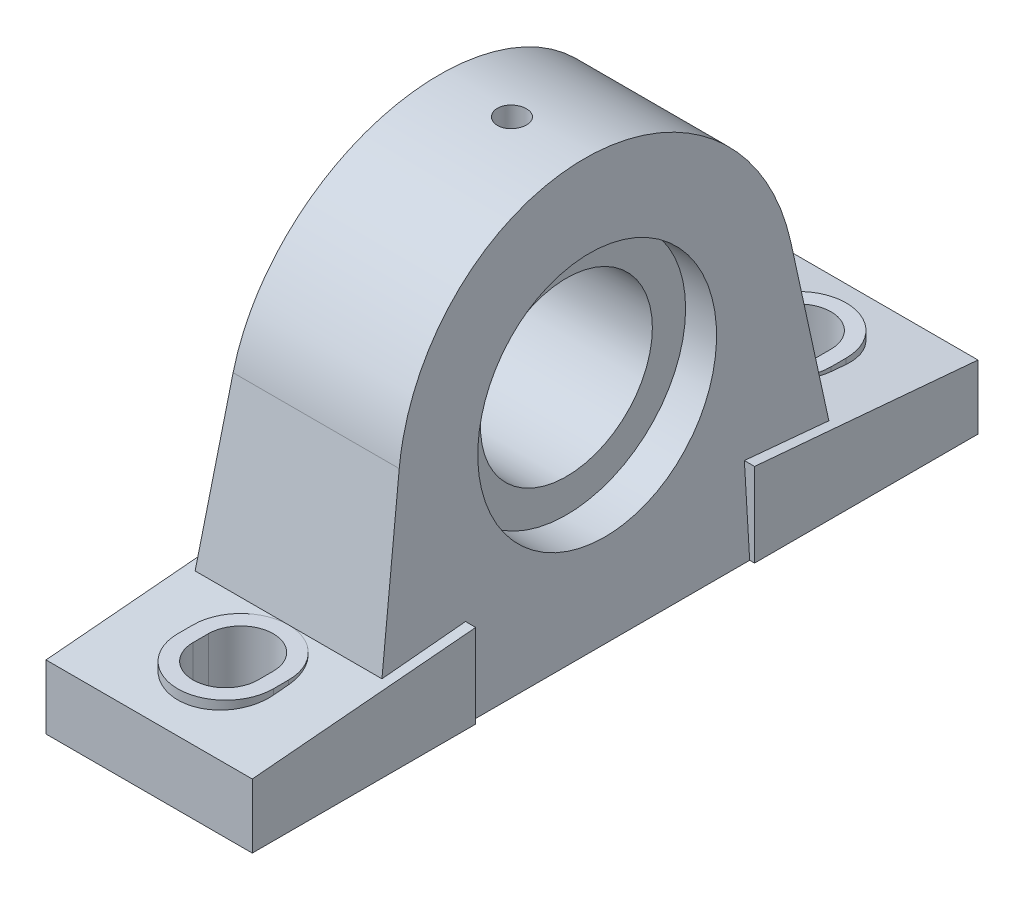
ISO-10303-21;
HEADER;
FILE_DESCRIPTION(('STEP AP214'),'2;1');
FILE_NAME('part.step','',(''),(''),'','','');
FILE_SCHEMA(('AUTOMOTIVE_DESIGN { 1 0 10303 214 1 1 1 1 }'));
ENDSEC;
DATA;
#1=APPLICATION_CONTEXT('core data for automotive mechanical design processes');
#2=APPLICATION_PROTOCOL_DEFINITION('international standard','automotive_design',2000,#1);
#3=PRODUCT_CONTEXT('',#1,'mechanical');
#4=PRODUCT('Part','Part','',(#3));
#5=PRODUCT_RELATED_PRODUCT_CATEGORY('part','',(#4));
#6=PRODUCT_DEFINITION_FORMATION('','',#4);
#7=PRODUCT_DEFINITION_CONTEXT('part definition',#1,'design');
#8=PRODUCT_DEFINITION('design','',#6,#7);
#9=PRODUCT_DEFINITION_SHAPE('','',#8);
#10=(LENGTH_UNIT() NAMED_UNIT(*) SI_UNIT(.MILLI.,.METRE.));
#11=(NAMED_UNIT(*) PLANE_ANGLE_UNIT() SI_UNIT($,.RADIAN.));
#12=(NAMED_UNIT(*) SI_UNIT($,.STERADIAN.) SOLID_ANGLE_UNIT());
#13=UNCERTAINTY_MEASURE_WITH_UNIT(LENGTH_MEASURE(1.E-05),#10,'distance_accuracy_value','');
#14=(GEOMETRIC_REPRESENTATION_CONTEXT(3) GLOBAL_UNCERTAINTY_ASSIGNED_CONTEXT((#13)) GLOBAL_UNIT_ASSIGNED_CONTEXT((#10,
#11,#12)) REPRESENTATION_CONTEXT('',''));
#15=CARTESIAN_POINT('',(0.,0.,0.));
#16=DIRECTION('',(0.,0.,1.));
#17=DIRECTION('',(1.,0.,0.));
#18=AXIS2_PLACEMENT_3D('',#15,#16,#17);
#19=CARTESIAN_POINT('',(-3.8,33.75,-3.876));
#20=CARTESIAN_POINT('',(-3.8,33.75,-3.8));
#21=CARTESIAN_POINT('',(-3.8,33.75,3.8));
#22=CARTESIAN_POINT('',(-3.8,33.75,3.87676));
#23=B_SPLINE_CURVE_WITH_KNOTS('',1,(#19,#20,#21,#22),.UNSPECIFIED.,.F.,.F.,(2,1,1,2),(-0.01,0.,
1.,1.0101),.UNSPECIFIED.);
#24=DIRECTION('',(1.,0.,0.));
#25=VECTOR('',#24,1.);
#26=SURFACE_OF_LINEAR_EXTRUSION('',#23,#25);
#27=CARTESIAN_POINT('',(0.,33.75,0.));
#28=DIRECTION('',(0.,-1.,0.));
#29=DIRECTION('',(0.,0.,-1.));
#30=AXIS2_PLACEMENT_3D('',#27,#28,#29);
#31=CIRCLE('',#30,3.8);
#32=CARTESIAN_POINT('',(0.,33.75,-3.80000000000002));
#33=VERTEX_POINT('',#32);
#34=EDGE_CURVE('E709',#33,#33,#31,.T.);
#35=ORIENTED_EDGE('',*,*,#34,.F.);
#36=EDGE_LOOP('',(#35));
#37=FACE_BOUND('',#36,.T.);
#38=ADVANCED_FACE('F16',(#37),#26,.T.);
#39=CARTESIAN_POINT('',(-30.2,0.,0.));
#40=DIRECTION('',(1.,0.,0.));
#41=DIRECTION('',(0.,0.,-1.));
#42=AXIS2_PLACEMENT_3D('',#39,#40,#41);
#43=CYLINDRICAL_SURFACE('',#42,22.5);
#44=CARTESIAN_POINT('',(-30.2,0.,0.));
#45=DIRECTION('',(1.,0.,0.));
#46=DIRECTION('',(0.,0.,-1.));
#47=AXIS2_PLACEMENT_3D('',#44,#45,#46);
#48=CIRCLE('',#47,22.5);
#49=CARTESIAN_POINT('',(-30.2,0.,-22.5));
#50=VERTEX_POINT('',#49);
#51=EDGE_CURVE('E240',#50,#50,#48,.T.);
#52=ORIENTED_EDGE('',*,*,#51,.F.);
#53=EDGE_LOOP('',(#52));
#54=FACE_BOUND('',#53,.T.);
#55=CARTESIAN_POINT('',(-20.682,22.5,0.));
#56=CARTESIAN_POINT('',(-20.6820047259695,22.4999988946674,0.11032090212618));
#57=CARTESIAN_POINT('',(-20.6913073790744,22.4991800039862,0.220713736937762));
#58=CARTESIAN_POINT('',(-20.7282788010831,22.4959921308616,0.438440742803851));
#59=CARTESIAN_POINT('',(-20.7559675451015,22.4936214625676,0.545771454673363));
#60=CARTESIAN_POINT('',(-20.8289030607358,22.487597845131,0.754193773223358));
#61=CARTESIAN_POINT('',(-20.8741400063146,22.4839456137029,0.855288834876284));
#62=CARTESIAN_POINT('',(-20.9808697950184,22.4757681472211,1.04842819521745));
#63=CARTESIAN_POINT('',(-21.0423593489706,22.4712430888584,1.1404743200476));
#64=CARTESIAN_POINT('',(-21.1800335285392,22.4618134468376,1.31318223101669));
#65=CARTESIAN_POINT('',(-21.2562541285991,22.4569079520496,1.39381529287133));
#66=CARTESIAN_POINT('',(-21.4211505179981,22.4472779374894,1.54116164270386));
#67=CARTESIAN_POINT('',(-21.5098268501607,22.4425534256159,1.60787432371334));
#68=CARTESIAN_POINT('',(-21.6972933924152,22.4338106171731,1.72558489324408));
#69=CARTESIAN_POINT('',(-21.7960996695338,22.4297934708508,1.77655728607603));
#70=CARTESIAN_POINT('',(-22.0009093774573,22.422930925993,1.86117747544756));
#71=CARTESIAN_POINT('',(-22.1069126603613,22.4200855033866,1.89482562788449));
#72=CARTESIAN_POINT('',(-22.3228178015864,22.4158963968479,1.94375835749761));
#73=CARTESIAN_POINT('',(-22.4327089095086,22.414548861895,1.95909003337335));
#74=CARTESIAN_POINT('',(-22.6535125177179,22.4134959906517,1.97110013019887));
#75=CARTESIAN_POINT('',(-22.7644249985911,22.4137906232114,1.96777890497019));
#76=CARTESIAN_POINT('',(-22.9837990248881,22.415985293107,1.94261638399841));
#77=CARTESIAN_POINT('',(-23.0922665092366,22.4178808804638,1.92082642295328));
#78=CARTESIAN_POINT('',(-23.3039996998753,22.4230569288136,1.85942441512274));
#79=CARTESIAN_POINT('',(-23.4072653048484,22.4263374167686,1.81981202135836));
#80=CARTESIAN_POINT('',(-23.6058290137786,22.4339188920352,1.72383072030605));
#81=CARTESIAN_POINT('',(-23.7011156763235,22.4382213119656,1.66743826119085));
#82=CARTESIAN_POINT('',(-23.8808828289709,22.4473601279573,1.53951961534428));
#83=CARTESIAN_POINT('',(-23.9653639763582,22.4521964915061,1.46799434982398));
#84=CARTESIAN_POINT('',(-24.1214143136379,22.4618774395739,1.31156728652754));
#85=CARTESIAN_POINT('',(-24.1929416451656,22.466722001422,1.22662372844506));
#86=CARTESIAN_POINT('',(-24.3207616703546,22.4758612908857,1.04586543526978));
#87=CARTESIAN_POINT('',(-24.377047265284,22.4801557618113,0.950045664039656));
#88=CARTESIAN_POINT('',(-24.4727768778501,22.4877122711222,0.750202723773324));
#89=CARTESIAN_POINT('',(-24.5122049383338,22.4909733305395,0.6461718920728));
#90=CARTESIAN_POINT('',(-24.5729400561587,22.4960828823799,0.433074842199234));
#91=CARTESIAN_POINT('',(-24.5942855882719,22.4979343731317,0.324019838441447));
#92=CARTESIAN_POINT('',(-24.6102124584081,22.4993200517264,0.178538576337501));
#93=CARTESIAN_POINT('',(-24.6131306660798,22.4995745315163,0.142898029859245));
#94=CARTESIAN_POINT('',(-24.6170252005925,22.4999146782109,0.0715101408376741));
#95=CARTESIAN_POINT('',(-24.6180015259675,22.5000003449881,0.0357627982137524));
#96=CARTESIAN_POINT('',(-24.6179952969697,22.499998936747,-0.110220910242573));
#97=CARTESIAN_POINT('',(-24.6087022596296,22.4991808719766,-0.220588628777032));
#98=CARTESIAN_POINT('',(-24.5717495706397,22.4959945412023,-0.438342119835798));
#99=CARTESIAN_POINT('',(-24.5440511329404,22.4936230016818,-0.545721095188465));
#100=CARTESIAN_POINT('',(-24.4710919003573,22.487597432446,-0.754205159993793));
#101=CARTESIAN_POINT('',(-24.425847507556,22.4839446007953,-0.855316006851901));
#102=CARTESIAN_POINT('',(-24.3191131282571,22.4757668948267,-1.04845451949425));
#103=CARTESIAN_POINT('',(-24.2576309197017,22.4712424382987,-1.14048650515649));
#104=CARTESIAN_POINT('',(-24.1199760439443,22.4618140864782,-1.31317024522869));
#105=CARTESIAN_POINT('',(-24.0437673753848,22.4569092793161,-1.39379325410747));
#106=CARTESIAN_POINT('',(-23.8788727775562,22.4472792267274,-1.5411436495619));
#107=CARTESIAN_POINT('',(-23.7901829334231,22.4425540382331,-1.60786665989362));
#108=CARTESIAN_POINT('',(-23.6026580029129,22.4338081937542,-1.72561693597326));
#109=CARTESIAN_POINT('',(-23.5038027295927,22.4297889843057,-1.7766121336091));
#110=CARTESIAN_POINT('',(-23.2989625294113,22.4229278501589,-1.86121587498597));
#111=CARTESIAN_POINT('',(-23.1929856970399,22.4200846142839,-1.89484379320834));
#112=CARTESIAN_POINT('',(-23.0136893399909,22.416604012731,-1.93548759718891));
#113=CARTESIAN_POINT('',(-22.9415053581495,22.4155454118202,-1.94766305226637));
#114=CARTESIAN_POINT('',(-22.7962248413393,22.414126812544,-1.96392080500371));
#115=CARTESIAN_POINT('',(-22.7231283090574,22.413766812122,-1.96800312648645));
#116=CARTESIAN_POINT('',(-22.5396802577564,22.4137686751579,-1.96799528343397));
#117=CARTESIAN_POINT('',(-22.4292884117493,22.4145907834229,-1.95869280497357));
#118=CARTESIAN_POINT('',(-22.2115632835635,22.4177901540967,-1.92172206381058));
#119=CARTESIAN_POINT('',(-22.1042334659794,22.42016911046,-1.8940337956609));
#120=CARTESIAN_POINT('',(-21.8958113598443,22.4262107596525,-1.82109911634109));
#121=CARTESIAN_POINT('',(-21.7947157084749,22.429872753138,-1.77586226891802));
#122=CARTESIAN_POINT('',(-21.6015784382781,22.4380668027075,-1.66913410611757));
#123=CARTESIAN_POINT('',(-21.5095346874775,22.4425986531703,-1.60764663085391));
#124=CARTESIAN_POINT('',(-21.3368370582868,22.4520357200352,-1.46998305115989));
#125=CARTESIAN_POINT('',(-21.2562110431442,22.4569418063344,-1.39377205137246));
#126=CARTESIAN_POINT('',(-21.1088588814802,22.4665678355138,-1.22887574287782));
#127=CARTESIAN_POINT('',(-21.0421364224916,22.4712877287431,-1.14018713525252));
#128=CARTESIAN_POINT('',(-20.9243864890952,22.4800189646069,-0.952664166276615));
#129=CARTESIAN_POINT('',(-20.8733911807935,22.484028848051,-0.853809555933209));
#130=CARTESIAN_POINT('',(-20.7887867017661,22.4908714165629,-0.648969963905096));
#131=CARTESIAN_POINT('',(-20.7551582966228,22.4937054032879,-0.542993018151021));
#132=CARTESIAN_POINT('',(-20.7145134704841,22.4971740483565,-0.363695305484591));
#133=CARTESIAN_POINT('',(-20.7023375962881,22.4982287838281,-0.291510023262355));
#134=CARTESIAN_POINT('',(-20.6860793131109,22.4996421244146,-0.146227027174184));
#135=CARTESIAN_POINT('',(-20.681996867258,22.5000007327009,-0.0731293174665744));
#136=CARTESIAN_POINT('',(-20.682,22.5,0.));
#137=B_SPLINE_CURVE_WITH_KNOTS('',3,(#55,#56,#57,#58,#59,#60,#61,#62,#63,#64,#65,#66,#67,#68,
#69,#70,#71,#72,#73,#74,#75,#76,#77,#78,#79,#80,#81,#82,#83,#84,#85,#86,#87,#88,#89,#90,#91,#92,
#93,#94,#95,#96,#97,#98,#99,#100,#101,#102,#103,#104,#105,#106,#107,#108,#109,#110,#111,#112,
#113,#114,#115,#116,#117,#118,#119,#120,#121,#122,#123,#124,#125,#126,#127,#128,#129,#130,#131,
#132,#133,#134,#135,#136),.UNSPECIFIED.,.T.,.F.,(4,2,2,2,2,2,2,2,2,2,2,2,2,2,2,2,2,2,2,2,2,2,2,
2,2,2,2,2,2,2,2,2,2,2,2,2,2,2,2,2,4),(0.,0.330696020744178,0.661751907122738,0.992622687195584,
1.32342655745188,1.65504872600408,1.9866853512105,2.31885636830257,2.65102056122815,
2.98232878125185,3.31363071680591,3.64401479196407,3.97440529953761,4.30526173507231,
4.63609803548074,4.96798501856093,5.30002631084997,5.63238121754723,5.96402717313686,
6.07127131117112,6.178515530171,6.50904211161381,6.84026743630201,7.17118387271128,
7.50194208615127,7.83351936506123,8.16520087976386,8.49755427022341,8.8295360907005,
9.04874437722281,9.26795201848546,9.59864506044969,9.92969851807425,10.2605718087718,
10.5913669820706,10.9229559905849,11.2546328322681,11.5869836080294,11.9189655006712,
12.1381776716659,12.357388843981),.UNSPECIFIED.);
#138=CARTESIAN_POINT('',(-20.682,22.5,0.));
#139=VERTEX_POINT('',#138);
#140=EDGE_CURVE('E236',#139,#139,#137,.T.);
#141=ORIENTED_EDGE('',*,*,#140,.F.);
#142=EDGE_LOOP('',(#141));
#143=FACE_BOUND('',#142,.T.);
#144=CARTESIAN_POINT('',(-23.108,0.,22.5));
#145=CARTESIAN_POINT('',(-23.1079952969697,0.110220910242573,22.499998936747));
#146=CARTESIAN_POINT('',(-23.0987022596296,0.220588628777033,22.4991808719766));
#147=CARTESIAN_POINT('',(-23.0617495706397,0.438342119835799,22.4959945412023));
#148=CARTESIAN_POINT('',(-23.0340511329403,0.545721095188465,22.4936230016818));
#149=CARTESIAN_POINT('',(-22.9610919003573,0.754205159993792,22.487597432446));
#150=CARTESIAN_POINT('',(-22.9158475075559,0.8553160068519,22.4839446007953));
#151=CARTESIAN_POINT('',(-22.8091131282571,1.04845451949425,22.4757668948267));
#152=CARTESIAN_POINT('',(-22.7476309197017,1.14048650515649,22.4712424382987));
#153=CARTESIAN_POINT('',(-22.6099760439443,1.31317024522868,22.4618140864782));
#154=CARTESIAN_POINT('',(-22.5337673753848,1.39379325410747,22.4569092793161));
#155=CARTESIAN_POINT('',(-22.3688727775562,1.5411436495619,22.4472792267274));
#156=CARTESIAN_POINT('',(-22.2801829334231,1.60786665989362,22.4425540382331));
#157=CARTESIAN_POINT('',(-22.0926580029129,1.72561693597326,22.4338081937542));
#158=CARTESIAN_POINT('',(-21.9938027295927,1.7766121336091,22.4297889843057));
#159=CARTESIAN_POINT('',(-21.7889625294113,1.86121587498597,22.4229278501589));
#160=CARTESIAN_POINT('',(-21.6829856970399,1.89484379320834,22.4200846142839));
#161=CARTESIAN_POINT('',(-21.5036893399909,1.93548759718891,22.416604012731));
#162=CARTESIAN_POINT('',(-21.4315053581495,1.94766305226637,22.4155454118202));
#163=CARTESIAN_POINT('',(-21.2862248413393,1.96392080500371,22.414126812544));
#164=CARTESIAN_POINT('',(-21.2131283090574,1.96800312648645,22.413766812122));
#165=CARTESIAN_POINT('',(-21.0296802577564,1.96799528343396,22.4137686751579));
#166=CARTESIAN_POINT('',(-20.9192884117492,1.95869280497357,22.4145907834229));
#167=CARTESIAN_POINT('',(-20.7015632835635,1.92172206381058,22.4177901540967));
#168=CARTESIAN_POINT('',(-20.5942334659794,1.8940337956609,22.42016911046));
#169=CARTESIAN_POINT('',(-20.3858113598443,1.82109911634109,22.4262107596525));
#170=CARTESIAN_POINT('',(-20.2847157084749,1.77586226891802,22.429872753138));
#171=CARTESIAN_POINT('',(-20.0915784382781,1.66913410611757,22.4380668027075));
#172=CARTESIAN_POINT('',(-19.9995346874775,1.60764663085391,22.4425986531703));
#173=CARTESIAN_POINT('',(-19.8268370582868,1.46998305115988,22.4520357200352));
#174=CARTESIAN_POINT('',(-19.7462110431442,1.39377205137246,22.4569418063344));
#175=CARTESIAN_POINT('',(-19.5988588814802,1.22887574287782,22.4665678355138));
#176=CARTESIAN_POINT('',(-19.5321364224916,1.14018713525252,22.4712877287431));
#177=CARTESIAN_POINT('',(-19.4143864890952,0.952664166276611,22.4800189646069));
#178=CARTESIAN_POINT('',(-19.3633911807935,0.853809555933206,22.484028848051));
#179=CARTESIAN_POINT('',(-19.2787867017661,0.648969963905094,22.4908714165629));
#180=CARTESIAN_POINT('',(-19.2451582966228,0.54299301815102,22.4937054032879));
#181=CARTESIAN_POINT('',(-19.2045134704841,0.363695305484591,22.4971740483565));
#182=CARTESIAN_POINT('',(-19.1923375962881,0.291510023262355,22.4982287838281));
#183=CARTESIAN_POINT('',(-19.1760793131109,0.146227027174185,22.4996421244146));
#184=CARTESIAN_POINT('',(-19.171996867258,0.0731293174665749,22.5000007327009));
#185=CARTESIAN_POINT('',(-19.1720047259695,-0.110320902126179,22.4999988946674));
#186=CARTESIAN_POINT('',(-19.1813073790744,-0.220713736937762,22.4991800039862));
#187=CARTESIAN_POINT('',(-19.2182788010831,-0.438440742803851,22.4959921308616));
#188=CARTESIAN_POINT('',(-19.2459675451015,-0.545771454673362,22.4936214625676));
#189=CARTESIAN_POINT('',(-19.3189030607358,-0.754193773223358,22.487597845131));
#190=CARTESIAN_POINT('',(-19.3641400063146,-0.855288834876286,22.4839456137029));
#191=CARTESIAN_POINT('',(-19.4708697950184,-1.04842819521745,22.4757681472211));
#192=CARTESIAN_POINT('',(-19.5323593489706,-1.1404743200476,22.4712430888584));
#193=CARTESIAN_POINT('',(-19.6700335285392,-1.31318223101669,22.4618134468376));
#194=CARTESIAN_POINT('',(-19.7462541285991,-1.39381529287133,22.4569079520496));
#195=CARTESIAN_POINT('',(-19.9111505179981,-1.54116164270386,22.4472779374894));
#196=CARTESIAN_POINT('',(-19.9998268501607,-1.60787432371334,22.4425534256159));
#197=CARTESIAN_POINT('',(-20.1872933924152,-1.72558489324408,22.4338106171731));
#198=CARTESIAN_POINT('',(-20.2860996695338,-1.77655728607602,22.4297934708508));
#199=CARTESIAN_POINT('',(-20.4909093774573,-1.86117747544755,22.422930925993));
#200=CARTESIAN_POINT('',(-20.5969126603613,-1.89482562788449,22.4200855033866));
#201=CARTESIAN_POINT('',(-20.8128178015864,-1.94375835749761,22.4158963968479));
#202=CARTESIAN_POINT('',(-20.9227089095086,-1.95909003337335,22.414548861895));
#203=CARTESIAN_POINT('',(-21.1435125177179,-1.97110013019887,22.4134959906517));
#204=CARTESIAN_POINT('',(-21.2544249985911,-1.96777890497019,22.4137906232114));
#205=CARTESIAN_POINT('',(-21.4737990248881,-1.94261638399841,22.415985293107));
#206=CARTESIAN_POINT('',(-21.5822665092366,-1.92082642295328,22.4178808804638));
#207=CARTESIAN_POINT('',(-21.7939996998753,-1.85942441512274,22.4230569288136));
#208=CARTESIAN_POINT('',(-21.8972653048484,-1.81981202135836,22.4263374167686));
#209=CARTESIAN_POINT('',(-22.0958290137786,-1.72383072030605,22.4339188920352));
#210=CARTESIAN_POINT('',(-22.1911156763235,-1.66743826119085,22.4382213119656));
#211=CARTESIAN_POINT('',(-22.3708828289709,-1.53951961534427,22.4473601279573));
#212=CARTESIAN_POINT('',(-22.4553639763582,-1.46799434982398,22.4521964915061));
#213=CARTESIAN_POINT('',(-22.6114143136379,-1.31156728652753,22.4618774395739));
#214=CARTESIAN_POINT('',(-22.6829416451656,-1.22662372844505,22.466722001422));
#215=CARTESIAN_POINT('',(-22.8107616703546,-1.04586543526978,22.4758612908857));
#216=CARTESIAN_POINT('',(-22.867047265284,-0.950045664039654,22.4801557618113));
#217=CARTESIAN_POINT('',(-22.9627768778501,-0.750202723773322,22.4877122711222));
#218=CARTESIAN_POINT('',(-23.0022049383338,-0.646171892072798,22.4909733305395));
#219=CARTESIAN_POINT('',(-23.0629400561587,-0.433074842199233,22.4960828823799));
#220=CARTESIAN_POINT('',(-23.0842855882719,-0.324019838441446,22.4979343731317));
#221=CARTESIAN_POINT('',(-23.1002124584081,-0.178538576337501,22.4993200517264));
#222=CARTESIAN_POINT('',(-23.1031306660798,-0.142898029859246,22.4995745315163));
#223=CARTESIAN_POINT('',(-23.1070252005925,-0.0715101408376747,22.4999146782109));
#224=CARTESIAN_POINT('',(-23.1080015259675,-0.0357627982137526,22.5000003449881));
#225=CARTESIAN_POINT('',(-23.108,0.,22.5));
#226=B_SPLINE_CURVE_WITH_KNOTS('',3,(#144,#145,#146,#147,#148,#149,#150,#151,#152,#153,#154,
#155,#156,#157,#158,#159,#160,#161,#162,#163,#164,#165,#166,#167,#168,#169,#170,#171,#172,#173,
#174,#175,#176,#177,#178,#179,#180,#181,#182,#183,#184,#185,#186,#187,#188,#189,#190,#191,#192,
#193,#194,#195,#196,#197,#198,#199,#200,#201,#202,#203,#204,#205,#206,#207,#208,#209,#210,#211,
#212,#213,#214,#215,#216,#217,#218,#219,#220,#221,#222,#223,#224,#225),.UNSPECIFIED.,.T.,.F.,(4,
2,2,2,2,2,2,2,2,2,2,2,2,2,2,2,2,2,2,2,2,2,2,2,2,2,2,2,2,2,2,2,2,2,2,2,2,2,2,2,4),(0.,
0.330526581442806,0.661751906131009,0.992668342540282,1.32342655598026,1.65500383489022,
1.98668534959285,2.31903874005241,2.6510205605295,2.87022884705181,3.08943648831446,
3.42012953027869,3.75118298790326,4.08205627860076,4.41285145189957,4.74444046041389,
5.07611730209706,5.40846807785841,5.74044997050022,5.95966214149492,6.17887331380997,
6.50956933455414,6.8406252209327,7.17149600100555,7.50229987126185,7.83392203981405,
8.16555866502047,8.49772968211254,8.82989387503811,9.16120209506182,9.49250403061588,
9.82288810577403,10.1532786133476,10.4841350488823,10.8149713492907,11.1468583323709,
11.4788996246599,11.8112545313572,12.1429004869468,12.2501446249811,12.357388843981),.UNSPECIFIED.);
#227=CARTESIAN_POINT('',(-23.108,0.,22.5));
#228=VERTEX_POINT('',#227);
#229=EDGE_CURVE('E232',#228,#228,#226,.T.);
#230=ORIENTED_EDGE('',*,*,#229,.F.);
#231=EDGE_LOOP('',(#230));
#232=FACE_BOUND('',#231,.T.);
#233=CARTESIAN_POINT('',(14.25,0.,0.));
#234=DIRECTION('',(1.,0.,0.));
#235=DIRECTION('',(0.,0.,-1.));
#236=AXIS2_PLACEMENT_3D('',#233,#234,#235);
#237=CIRCLE('',#236,22.5);
#238=CARTESIAN_POINT('',(14.25,0.,-22.5));
#239=VERTEX_POINT('',#238);
#240=EDGE_CURVE('E20',#239,#239,#237,.F.);
#241=ORIENTED_EDGE('',*,*,#240,.F.);
#242=EDGE_LOOP('',(#241));
#243=FACE_BOUND('',#242,.T.);
#244=ADVANCED_FACE('F225',(#54,#143,#232,#243),#43,.F.);
#245=CARTESIAN_POINT('',(14.25,31.2,31.5744010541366));
#246=DIRECTION('',(1.,0.,0.));
#247=DIRECTION('',(0.,-1.,0.));
#248=AXIS2_PLACEMENT_3D('',#245,#246,#247);
#249=PLANE('',#248);
#250=ORIENTED_EDGE('',*,*,#240,.T.);
#251=EDGE_LOOP('',(#250));
#252=FACE_BOUND('',#251,.T.);
#253=CARTESIAN_POINT('',(14.25,0.,0.));
#254=DIRECTION('',(1.,0.,0.));
#255=DIRECTION('',(0.,0.,-1.));
#256=AXIS2_PLACEMENT_3D('',#253,#254,#255);
#257=CIRCLE('',#256,31.2);
#258=CARTESIAN_POINT('',(14.25,0.,-31.2));
#259=VERTEX_POINT('',#258);
#260=EDGE_CURVE('E208',#259,#259,#257,.F.);
#261=ORIENTED_EDGE('',*,*,#260,.F.);
#262=EDGE_LOOP('',(#261));
#263=FACE_BOUND('',#262,.T.);
#264=ADVANCED_FACE('F220',(#252,#263),#249,.T.);
#265=CARTESIAN_POINT('',(0.,52.0001620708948,0.));
#266=DIRECTION('',(0.,-1.,0.));
#267=DIRECTION('',(0.,0.,-1.));
#268=AXIS2_PLACEMENT_3D('',#265,#266,#267);
#269=CYLINDRICAL_SURFACE('',#268,3.8);
#270=ORIENTED_EDGE('',*,*,#34,.T.);
#271=EDGE_LOOP('',(#270));
#272=FACE_BOUND('',#271,.T.);
#273=CARTESIAN_POINT('',(3.8,52.,0.));
#274=CARTESIAN_POINT('',(3.79999099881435,51.9999982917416,0.212959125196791));
#275=CARTESIAN_POINT('',(3.78202464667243,51.9986768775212,0.42620325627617));
#276=CARTESIAN_POINT('',(3.71057940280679,51.9935301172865,0.846936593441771));
#277=CARTESIAN_POINT('',(3.6570252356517,51.9896994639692,1.05441262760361));
#278=CARTESIAN_POINT('',(3.51594879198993,51.9799670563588,1.45724891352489));
#279=CARTESIAN_POINT('',(3.42845760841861,51.9740671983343,1.65262006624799));
#280=CARTESIAN_POINT('',(3.22204599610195,51.9608605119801,2.02580375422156));
#281=CARTESIAN_POINT('',(3.10313982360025,51.9535543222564,2.20362420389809));
#282=CARTESIAN_POINT('',(2.83699341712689,51.9383374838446,2.53713704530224));
#283=CARTESIAN_POINT('',(2.68970099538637,51.9304257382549,2.69278774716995));
#284=CARTESIAN_POINT('',(2.37106621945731,51.9148984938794,2.97718890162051));
#285=CARTESIAN_POINT('',(2.19972168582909,51.9072830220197,3.10593691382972));
#286=CARTESIAN_POINT('',(1.83762224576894,51.8931993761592,3.3329957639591));
#287=CARTESIAN_POINT('',(1.64684632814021,51.8867324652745,3.43127317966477));
#288=CARTESIAN_POINT('',(1.25144800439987,51.8756890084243,3.59438621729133));
#289=CARTESIAN_POINT('',(1.04682591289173,51.871112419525,3.65922259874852));
#290=CARTESIAN_POINT('',(0.629932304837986,51.8643758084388,3.75350173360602));
#291=CARTESIAN_POINT('',(0.417675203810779,51.8622114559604,3.78300791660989));
#292=CARTESIAN_POINT('',(-0.00878957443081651,51.8605304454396,3.80598493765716));
#293=CARTESIAN_POINT('',(-0.222997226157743,51.8610137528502,3.79945624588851));
#294=CARTESIAN_POINT('',(-0.646846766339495,51.8645695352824,3.75060147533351));
#295=CARTESIAN_POINT('',(-0.856496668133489,51.8676370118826,3.70834450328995));
#296=CARTESIAN_POINT('',(-1.26572182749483,51.8760076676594,3.58933928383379));
#297=CARTESIAN_POINT('',(-1.46529691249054,51.8813108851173,3.51259044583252));
#298=CARTESIAN_POINT('',(-1.84893282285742,51.8935614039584,3.32669908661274));
#299=CARTESIAN_POINT('',(-2.03297793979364,51.9005103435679,3.21752425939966));
#300=CARTESIAN_POINT('',(-2.38014085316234,51.9152669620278,2.9699132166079));
#301=CARTESIAN_POINT('',(-2.54326008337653,51.9230745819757,2.83147900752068));
#302=CARTESIAN_POINT('',(-2.84433104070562,51.9386899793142,2.5289185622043));
#303=CARTESIAN_POINT('',(-2.98222778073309,51.9464977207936,2.364737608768));
#304=CARTESIAN_POINT('',(-3.22857589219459,51.9612213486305,2.01543564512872));
#305=CARTESIAN_POINT('',(-3.33701347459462,51.9681368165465,1.83030488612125));
#306=CARTESIAN_POINT('',(-3.52134748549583,51.9802980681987,1.44427677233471));
#307=CARTESIAN_POINT('',(-3.59721447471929,51.9855423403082,1.24336534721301));
#308=CARTESIAN_POINT('',(-3.71396392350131,51.9937504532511,0.83188667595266));
#309=CARTESIAN_POINT('',(-3.75492070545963,51.9967191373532,0.621340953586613));
#310=CARTESIAN_POINT('',(-3.78527194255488,51.9989255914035,0.341186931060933));
#311=CARTESIAN_POINT('',(-3.79079100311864,51.999327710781,0.2730750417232));
#312=CARTESIAN_POINT('',(-3.79815647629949,51.9998651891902,0.136651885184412));
#313=CARTESIAN_POINT('',(-3.80000288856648,52.0000005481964,0.0683406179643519));
#314=CARTESIAN_POINT('',(-3.79999099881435,51.9999982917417,-0.212959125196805));
#315=CARTESIAN_POINT('',(-3.78202464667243,51.9986768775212,-0.426203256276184));
#316=CARTESIAN_POINT('',(-3.71057940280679,51.9935301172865,-0.846936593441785));
#317=CARTESIAN_POINT('',(-3.6570252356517,51.9896994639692,-1.05441262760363));
#318=CARTESIAN_POINT('',(-3.51594879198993,51.9799670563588,-1.4572489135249));
#319=CARTESIAN_POINT('',(-3.4284576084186,51.9740671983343,-1.652620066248));
#320=CARTESIAN_POINT('',(-3.22204599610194,51.9608605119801,-2.02580375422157));
#321=CARTESIAN_POINT('',(-3.10313982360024,51.9535543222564,-2.2036242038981));
#322=CARTESIAN_POINT('',(-2.83699341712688,51.9383374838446,-2.53713704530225));
#323=CARTESIAN_POINT('',(-2.68970099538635,51.930425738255,-2.69278774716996));
#324=CARTESIAN_POINT('',(-2.37106621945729,51.9148984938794,-2.97718890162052));
#325=CARTESIAN_POINT('',(-2.19972168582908,51.9072830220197,-3.10593691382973));
#326=CARTESIAN_POINT('',(-1.83762224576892,51.8931993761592,-3.33299576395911));
#327=CARTESIAN_POINT('',(-1.64684632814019,51.8867324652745,-3.43127317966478));
#328=CARTESIAN_POINT('',(-1.25144800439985,51.8756890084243,-3.59438621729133));
#329=CARTESIAN_POINT('',(-1.04682591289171,51.871112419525,-3.65922259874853));
#330=CARTESIAN_POINT('',(-0.62993230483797,51.8643758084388,-3.75350173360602));
#331=CARTESIAN_POINT('',(-0.417675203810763,51.8622114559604,-3.7830079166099));
#332=CARTESIAN_POINT('',(0.00878957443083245,51.8605304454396,-3.80598493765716));
#333=CARTESIAN_POINT('',(0.222997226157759,51.8610137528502,-3.79945624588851));
#334=CARTESIAN_POINT('',(0.646846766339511,51.8645695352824,-3.75060147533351));
#335=CARTESIAN_POINT('',(0.856496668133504,51.8676370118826,-3.70834450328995));
#336=CARTESIAN_POINT('',(1.26572182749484,51.8760076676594,-3.58933928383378));
#337=CARTESIAN_POINT('',(1.46529691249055,51.8813108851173,-3.51259044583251));
#338=CARTESIAN_POINT('',(1.84893282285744,51.8935614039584,-3.32669908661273));
#339=CARTESIAN_POINT('',(2.03297793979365,51.9005103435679,-3.21752425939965));
#340=CARTESIAN_POINT('',(2.38014085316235,51.9152669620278,-2.96991321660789));
#341=CARTESIAN_POINT('',(2.54326008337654,51.9230745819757,-2.83147900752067));
#342=CARTESIAN_POINT('',(2.84433104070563,51.9386899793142,-2.52891856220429));
#343=CARTESIAN_POINT('',(2.9822277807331,51.9464977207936,-2.36473760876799));
#344=CARTESIAN_POINT('',(3.2285758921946,51.9612213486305,-2.0154356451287));
#345=CARTESIAN_POINT('',(3.33701347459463,51.9681368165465,-1.83030488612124));
#346=CARTESIAN_POINT('',(3.52134748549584,51.9802980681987,-1.4442767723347));
#347=CARTESIAN_POINT('',(3.59721447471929,51.9855423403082,-1.24336534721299));
#348=CARTESIAN_POINT('',(3.71396392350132,51.9937504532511,-0.831886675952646));
#349=CARTESIAN_POINT('',(3.75492070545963,51.9967191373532,-0.621340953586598));
#350=CARTESIAN_POINT('',(3.78527194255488,51.9989255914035,-0.341186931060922));
#351=CARTESIAN_POINT('',(3.79079100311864,51.999327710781,-0.273075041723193));
#352=CARTESIAN_POINT('',(3.79815647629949,51.9998651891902,-0.136651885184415));
#353=CARTESIAN_POINT('',(3.80000288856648,52.0000005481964,-0.0683406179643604));
#354=CARTESIAN_POINT('',(3.8,52.,0.));
#355=B_SPLINE_CURVE_WITH_KNOTS('',3,(#273,#274,#275,#276,#277,#278,#279,#280,#281,#282,#283,
#284,#285,#286,#287,#288,#289,#290,#291,#292,#293,#294,#295,#296,#297,#298,#299,#300,#301,#302,
#303,#304,#305,#306,#307,#308,#309,#310,#311,#312,#313,#314,#315,#316,#317,#318,#319,#320,#321,
#322,#323,#324,#325,#326,#327,#328,#329,#330,#331,#332,#333,#334,#335,#336,#337,#338,#339,#340,
#341,#342,#343,#344,#345,#346,#347,#348,#349,#350,#351,#352,#353,#354),.UNSPECIFIED.,.T.,.F.,(4,
2,2,2,2,2,2,2,2,2,2,2,2,2,2,2,2,2,2,2,2,2,2,2,2,2,2,2,2,2,2,2,2,2,2,2,2,2,2,2,4),(0.,
0.638617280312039,1.27858968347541,1.91797712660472,2.55707491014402,3.19735907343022,
3.83770129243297,4.47874341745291,5.11977098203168,5.75964595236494,6.39951257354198,
7.03814436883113,7.67678709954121,8.31606825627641,8.95530558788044,9.595920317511,
10.2368343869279,10.8783265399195,11.5184495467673,11.7233879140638,11.928326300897,
12.5669435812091,13.2069159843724,13.8463034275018,14.4854012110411,15.1256853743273,
15.76602759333,16.40706971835,17.0480972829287,17.687972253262,18.327838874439,18.9664706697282,
19.6051134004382,20.2443945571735,20.8836318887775,21.524246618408,22.1651606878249,
22.8066528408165,23.4467758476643,23.6517142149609,23.856652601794),.UNSPECIFIED.);
#356=CARTESIAN_POINT('',(3.8,52.,0.));
#357=VERTEX_POINT('',#356);
#358=EDGE_CURVE('E200',#357,#357,#355,.T.);
#359=ORIENTED_EDGE('',*,*,#358,.F.);
#360=EDGE_LOOP('',(#359));
#361=FACE_BOUND('',#360,.T.);
#362=ADVANCED_FACE('F214',(#272,#361),#269,.F.);
#363=CARTESIAN_POINT('',(-21.14,0.,33.75));
#364=DIRECTION('',(0.,0.,-1.));
#365=DIRECTION('',(-1.,0.,0.));
#366=AXIS2_PLACEMENT_3D('',#363,#364,#365);
#367=CYLINDRICAL_SURFACE('',#366,1.968);
#368=CARTESIAN_POINT('',(-21.14,0.,33.75));
#369=DIRECTION('',(0.,0.,-1.));
#370=DIRECTION('',(-1.,0.,0.));
#371=AXIS2_PLACEMENT_3D('',#368,#369,#370);
#372=CIRCLE('',#371,1.968);
#373=CARTESIAN_POINT('',(-22.1928350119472,1.66269733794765,33.75));
#374=VERTEX_POINT('',#373);
#375=CARTESIAN_POINT('',(-22.3944780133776,-1.51634722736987,33.75));
#376=VERTEX_POINT('',#375);
#377=EDGE_CURVE('E587',#374,#376,#372,.T.);
#378=ORIENTED_EDGE('',*,*,#377,.F.);
#379=DIRECTION('',(0.,0.,-1.));
#380=VECTOR('',#379,1.);
#381=CARTESIAN_POINT('',(-22.1928350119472,1.66269733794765,28.0818836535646));
#382=LINE('',#381,#380);
#383=CARTESIAN_POINT('',(-22.1928350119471,1.66269733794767,33.709018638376));
#384=VERTEX_POINT('',#383);
#385=EDGE_CURVE('E705',#374,#384,#382,.T.);
#386=ORIENTED_EDGE('',*,*,#385,.T.);
#387=CARTESIAN_POINT('',(-22.3944780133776,-1.51634722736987,33.7159189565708));
#388=CARTESIAN_POINT('',(-22.4371121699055,-1.48107498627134,33.7175051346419));
#389=CARTESIAN_POINT('',(-22.4782373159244,-1.44402211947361,33.7191161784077));
#390=CARTESIAN_POINT('',(-22.5572232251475,-1.36658870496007,33.7223433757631));
#391=CARTESIAN_POINT('',(-22.5950840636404,-1.32620823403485,33.7239595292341));
#392=CARTESIAN_POINT('',(-22.703381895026,-1.20044820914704,33.7287478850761));
#393=CARTESIAN_POINT('',(-22.7685599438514,-1.11042871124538,33.7318609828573));
#394=CARTESIAN_POINT('',(-22.882877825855,-0.920704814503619,33.7375728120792));
#395=CARTESIAN_POINT('',(-22.9320072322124,-0.820994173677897,33.7401712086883));
#396=CARTESIAN_POINT('',(-23.0127520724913,-0.614845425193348,33.7445556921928));
#397=CARTESIAN_POINT('',(-23.0443987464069,-0.508419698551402,33.7463432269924));
#398=CARTESIAN_POINT('',(-23.0805473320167,-0.334403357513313,33.7484078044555));
#399=CARTESIAN_POINT('',(-23.090827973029,-0.267961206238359,33.749002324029));
#400=CARTESIAN_POINT('',(-23.1045566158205,-0.134356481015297,33.7497987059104));
#401=CARTESIAN_POINT('',(-23.1080030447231,-0.0671937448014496,33.7500004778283));
#402=CARTESIAN_POINT('',(-23.1079949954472,0.110445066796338,33.7499992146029));
#403=CARTESIAN_POINT('',(-23.0986705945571,0.220973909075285,33.7494520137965));
#404=CARTESIAN_POINT('',(-23.061609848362,0.438965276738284,33.7473218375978));
#405=CARTESIAN_POINT('',(-23.0338538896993,0.546424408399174,33.7457377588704));
#406=CARTESIAN_POINT('',(-22.9607275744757,0.755105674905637,33.7417130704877));
#407=CARTESIAN_POINT('',(-22.9153665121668,0.856331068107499,33.7392729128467));
#408=CARTESIAN_POINT('',(-22.8083392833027,1.04970838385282,33.733810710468));
#409=CARTESIAN_POINT('',(-22.7466749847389,1.14186134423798,33.7307887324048));
#410=CARTESIAN_POINT('',(-22.6096830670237,1.31336163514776,33.7245437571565));
#411=CARTESIAN_POINT('',(-22.5345550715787,1.39286768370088,33.7213240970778));
#412=CARTESIAN_POINT('',(-22.4128400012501,1.50196123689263,33.7165826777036));
#413=CARTESIAN_POINT('',(-22.3707281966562,1.53665451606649,33.7150156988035));
#414=CARTESIAN_POINT('',(-22.2837680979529,1.60243187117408,33.7119532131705));
#415=CARTESIAN_POINT('',(-22.2389196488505,1.63351574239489,33.7104577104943));
#416=CARTESIAN_POINT('',(-22.1928350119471,1.66269733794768,33.709018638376));
#417=B_SPLINE_CURVE_WITH_KNOTS('',3,(#387,#388,#389,#390,#391,#392,#393,#394,#395,#396,#397,
#398,#399,#400,#401,#402,#403,#404,#405,#406,#407,#408,#409,#410,#411,#412,#413,#414,#415,#416),
.UNSPECIFIED.,.F.,.F.,(4,2,2,2,2,2,2,2,2,2,2,2,2,2,4),(0.,0.165966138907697,0.33192844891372,
0.663754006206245,0.995794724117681,1.32724018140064,1.52862520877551,1.73005657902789,
2.06114545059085,2.39258720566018,2.72385422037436,3.05508329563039,3.38175593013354,
3.54534688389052,3.70894711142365),.UNSPECIFIED.);
#418=CARTESIAN_POINT('',(-22.3944780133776,-1.51634722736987,33.7159189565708));
#419=VERTEX_POINT('',#418);
#420=EDGE_CURVE('E258',#419,#384,#417,.T.);
#421=ORIENTED_EDGE('',*,*,#420,.F.);
#422=DIRECTION('',(0.,0.,1.));
#423=VECTOR('',#422,1.);
#424=CARTESIAN_POINT('',(-22.3944780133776,-1.51634722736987,28.0818836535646));
#425=LINE('',#424,#423);
#426=EDGE_CURVE('E707',#419,#376,#425,.T.);
#427=ORIENTED_EDGE('',*,*,#426,.T.);
#428=EDGE_LOOP('',(#378,#386,#421,#427));
#429=FACE_BOUND('',#428,.T.);
#430=ORIENTED_EDGE('',*,*,#229,.T.);
#431=EDGE_LOOP('',(#430));
#432=FACE_BOUND('',#431,.T.);
#433=ADVANCED_FACE('F219',(#429,#432),#367,.F.);
#434=CARTESIAN_POINT('',(-22.65,33.7501275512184,0.));
#435=DIRECTION('',(0.,-1.,0.));
#436=DIRECTION('',(0.,0.,-1.));
#437=AXIS2_PLACEMENT_3D('',#434,#435,#436);
#438=CYLINDRICAL_SURFACE('',#437,1.968);
#439=ORIENTED_EDGE('',*,*,#140,.T.);
#440=EDGE_LOOP('',(#439));
#441=FACE_BOUND('',#440,.T.);
#442=CARTESIAN_POINT('',(-20.682,33.75,0.));
#443=CARTESIAN_POINT('',(-20.6820046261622,33.749999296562,0.110348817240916));
#444=CARTESIAN_POINT('',(-20.6913190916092,33.7494526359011,0.22084590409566));
#445=CARTESIAN_POINT('',(-20.728360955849,33.7473234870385,0.438861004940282));
#446=CARTESIAN_POINT('',(-20.7561275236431,33.7457387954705,0.54637217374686));
#447=CARTESIAN_POINT('',(-20.8292779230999,33.7417127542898,0.755120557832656));
#448=CARTESIAN_POINT('',(-20.8746461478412,33.7392721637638,0.856363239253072));
#449=CARTESIAN_POINT('',(-20.9816852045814,33.7338095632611,1.049743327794));
#450=CARTESIAN_POINT('',(-21.0433485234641,33.7307878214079,1.14188490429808));
#451=CARTESIAN_POINT('',(-21.1813286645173,33.7244974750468,1.31463409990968));
#452=CARTESIAN_POINT('',(-21.2576637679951,33.721228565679,1.39522710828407));
#453=CARTESIAN_POINT('',(-21.4227863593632,33.7148148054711,1.54246832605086));
#454=CARTESIAN_POINT('',(-21.5115749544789,33.7116699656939,1.60911529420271));
#455=CARTESIAN_POINT('',(-21.6991546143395,33.7058570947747,1.72660727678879));
#456=CARTESIAN_POINT('',(-21.7979524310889,33.7031893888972,1.77744152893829));
#457=CARTESIAN_POINT('',(-22.0026978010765,33.6986351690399,1.86179551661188));
#458=CARTESIAN_POINT('',(-22.1086452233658,33.696748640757,1.8953155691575));
#459=CARTESIAN_POINT('',(-22.3245545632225,33.6939721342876,1.94405331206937));
#460=CARTESIAN_POINT('',(-22.4345117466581,33.6930810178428,1.9592919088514));
#461=CARTESIAN_POINT('',(-22.655426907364,33.6923924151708,1.97109868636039));
#462=CARTESIAN_POINT('',(-22.7663848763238,33.6925949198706,1.96766702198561));
#463=CARTESIAN_POINT('',(-22.9860083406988,33.6940696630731,1.94224811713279));
#464=CARTESIAN_POINT('',(-23.0946764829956,33.6953405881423,1.9202836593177));
#465=CARTESIAN_POINT('',(-23.3067817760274,33.6988068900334,1.85845762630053));
#466=CARTESIAN_POINT('',(-23.4102188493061,33.7010022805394,1.818595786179));
#467=CARTESIAN_POINT('',(-23.6090013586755,33.7060716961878,1.72207899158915));
#468=CARTESIAN_POINT('',(-23.7043414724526,33.70894616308,1.66541309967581));
#469=CARTESIAN_POINT('',(-23.8841566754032,33.7150490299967,1.53690984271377));
#470=CARTESIAN_POINT('',(-23.9686325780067,33.7182774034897,1.46507361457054));
#471=CARTESIAN_POINT('',(-24.1244478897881,33.7247296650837,1.30815510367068));
#472=CARTESIAN_POINT('',(-24.1957700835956,33.7279535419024,1.22305572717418));
#473=CARTESIAN_POINT('',(-24.3231524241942,33.73403105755,1.04203453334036));
#474=CARTESIAN_POINT('',(-24.3792053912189,33.7368845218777,0.94610765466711));
#475=CARTESIAN_POINT('',(-24.47444939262,33.741900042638,0.746119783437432));
#476=CARTESIAN_POINT('',(-24.5136256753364,33.7440614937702,0.642051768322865));
#477=CARTESIAN_POINT('',(-24.5738621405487,33.7474414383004,0.428944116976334));
#478=CARTESIAN_POINT('',(-24.5949608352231,33.7486619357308,0.319915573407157));
#479=CARTESIAN_POINT('',(-24.6105054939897,33.7495637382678,0.175153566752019));
#480=CARTESIAN_POINT('',(-24.6133139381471,33.7497270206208,0.140186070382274));
#481=CARTESIAN_POINT('',(-24.6170619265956,33.7499452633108,0.0701507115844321));
#482=CARTESIAN_POINT('',(-24.6180014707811,33.7500002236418,0.0350828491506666));
#483=CARTESIAN_POINT('',(-24.6179953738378,33.749999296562,-0.110348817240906));
#484=CARTESIAN_POINT('',(-24.6086809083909,33.7494526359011,-0.22084590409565));
#485=CARTESIAN_POINT('',(-24.571639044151,33.7473234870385,-0.438861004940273));
#486=CARTESIAN_POINT('',(-24.5438724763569,33.7457387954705,-0.546372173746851));
#487=CARTESIAN_POINT('',(-24.4707220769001,33.7417127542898,-0.755120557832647));
#488=CARTESIAN_POINT('',(-24.4253538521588,33.7392721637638,-0.856363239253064));
#489=CARTESIAN_POINT('',(-24.3183147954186,33.7338095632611,-1.04974332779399));
#490=CARTESIAN_POINT('',(-24.2566514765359,33.7307878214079,-1.14188490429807));
#491=CARTESIAN_POINT('',(-24.1186713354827,33.7244974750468,-1.31463409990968));
#492=CARTESIAN_POINT('',(-24.0423362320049,33.721228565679,-1.39522710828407));
#493=CARTESIAN_POINT('',(-23.8772136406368,33.7148148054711,-1.54246832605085));
#494=CARTESIAN_POINT('',(-23.7884250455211,33.7116699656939,-1.60911529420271));
#495=CARTESIAN_POINT('',(-23.6008453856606,33.7058570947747,-1.72660727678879));
#496=CARTESIAN_POINT('',(-23.5020475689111,33.7031893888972,-1.77744152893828));
#497=CARTESIAN_POINT('',(-23.2973021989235,33.6986351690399,-1.86179551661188));
#498=CARTESIAN_POINT('',(-23.1913547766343,33.696748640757,-1.89531556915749));
#499=CARTESIAN_POINT('',(-22.9754454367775,33.6939721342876,-1.94405331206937));
#500=CARTESIAN_POINT('',(-22.8654882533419,33.6930810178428,-1.9592919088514));
#501=CARTESIAN_POINT('',(-22.644573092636,33.6923924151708,-1.97109868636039));
#502=CARTESIAN_POINT('',(-22.5336151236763,33.6925949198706,-1.96766702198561));
#503=CARTESIAN_POINT('',(-22.3139916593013,33.6940696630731,-1.94224811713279));
#504=CARTESIAN_POINT('',(-22.2053235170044,33.6953405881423,-1.9202836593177));
#505=CARTESIAN_POINT('',(-21.9932182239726,33.6988068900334,-1.85845762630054));
#506=CARTESIAN_POINT('',(-21.8897811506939,33.7010022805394,-1.818595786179));
#507=CARTESIAN_POINT('',(-21.6909986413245,33.7060716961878,-1.72207899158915));
#508=CARTESIAN_POINT('',(-21.5956585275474,33.70894616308,-1.66541309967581));
#509=CARTESIAN_POINT('',(-21.4158433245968,33.7150490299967,-1.53690984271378));
#510=CARTESIAN_POINT('',(-21.3313674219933,33.7182774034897,-1.46507361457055));
#511=CARTESIAN_POINT('',(-21.1755521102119,33.7247296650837,-1.30815510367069));
#512=CARTESIAN_POINT('',(-21.1042299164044,33.7279535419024,-1.22305572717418));
#513=CARTESIAN_POINT('',(-20.9768475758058,33.73403105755,-1.04203453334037));
#514=CARTESIAN_POINT('',(-20.9207946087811,33.7368845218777,-0.946107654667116));
#515=CARTESIAN_POINT('',(-20.82555060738,33.741900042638,-0.746119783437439));
#516=CARTESIAN_POINT('',(-20.7863743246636,33.7440614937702,-0.642051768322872));
#517=CARTESIAN_POINT('',(-20.7261378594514,33.7474414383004,-0.428944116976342));
#518=CARTESIAN_POINT('',(-20.7050391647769,33.7486619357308,-0.319915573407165));
#519=CARTESIAN_POINT('',(-20.6894945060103,33.7495637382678,-0.175153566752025));
#520=CARTESIAN_POINT('',(-20.6866860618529,33.7497270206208,-0.140186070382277));
#521=CARTESIAN_POINT('',(-20.6829380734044,33.7499452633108,-0.0701507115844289));
#522=CARTESIAN_POINT('',(-20.6819985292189,33.7500002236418,-0.0350828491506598));
#523=CARTESIAN_POINT('',(-20.682,33.75,0.));
#524=B_SPLINE_CURVE_WITH_KNOTS('',3,(#442,#443,#444,#445,#446,#447,#448,#449,#450,#451,#452,
#453,#454,#455,#456,#457,#458,#459,#460,#461,#462,#463,#464,#465,#466,#467,#468,#469,#470,#471,
#472,#473,#474,#475,#476,#477,#478,#479,#480,#481,#482,#483,#484,#485,#486,#487,#488,#489,#490,
#491,#492,#493,#494,#495,#496,#497,#498,#499,#500,#501,#502,#503,#504,#505,#506,#507,#508,#509,
#510,#511,#512,#513,#514,#515,#516,#517,#518,#519,#520,#521,#522,#523),.UNSPECIFIED.,.T.,.F.,(4,
2,2,2,2,2,2,2,2,2,2,2,2,2,2,2,2,2,2,2,2,2,2,2,2,2,2,2,2,2,2,2,2,2,2,2,2,2,2,2,4),(0.,
0.330912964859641,0.662530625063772,0.993854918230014,1.32502671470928,1.65661386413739,
1.98823051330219,2.32007237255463,2.65190815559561,2.98336409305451,3.31481728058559,
3.64586359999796,3.97691481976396,4.30818198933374,4.63942434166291,4.97109718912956,
5.30292572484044,5.63504372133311,5.96645240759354,6.07165851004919,6.17686461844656,
6.50777758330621,6.83939524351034,7.17071953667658,7.50189133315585,7.83347848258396,
8.16509513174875,8.4969369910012,8.82877277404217,9.16022871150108,9.49168189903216,
9.82272821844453,10.1537794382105,10.4850466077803,10.8162889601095,11.1479618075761,
11.479790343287,11.8119083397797,12.1433170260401,12.2485231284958,12.3537292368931),.UNSPECIFIED.);
#525=CARTESIAN_POINT('',(-20.682,33.75,0.));
#526=VERTEX_POINT('',#525);
#527=EDGE_CURVE('E250',#526,#526,#524,.T.);
#528=ORIENTED_EDGE('',*,*,#527,.F.);
#529=EDGE_LOOP('',(#528));
#530=FACE_BOUND('',#529,.T.);
#531=ADVANCED_FACE('F241',(#441,#530),#438,.F.);
#532=CARTESIAN_POINT('',(-30.2,-33.75,34.1550021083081));
#533=DIRECTION('',(-1.,0.,0.));
#534=DIRECTION('',(0.,1.,0.));
#535=AXIS2_PLACEMENT_3D('',#532,#533,#534);
#536=PLANE('',#535);
#537=ORIENTED_EDGE('',*,*,#51,.T.);
#538=EDGE_LOOP('',(#537));
#539=FACE_BOUND('',#538,.T.);
#540=CARTESIAN_POINT('',(-30.2,0.,0.));
#541=DIRECTION('',(1.,0.,0.));
#542=DIRECTION('',(0.,0.,-1.));
#543=AXIS2_PLACEMENT_3D('',#540,#541,#542);
#544=CIRCLE('',#543,33.75);
#545=CARTESIAN_POINT('',(-30.2,0.,-33.75));
#546=VERTEX_POINT('',#545);
#547=EDGE_CURVE('E257',#546,#546,#544,.T.);
#548=ORIENTED_EDGE('',*,*,#547,.F.);
#549=EDGE_LOOP('',(#548));
#550=FACE_BOUND('',#549,.T.);
#551=ADVANCED_FACE('F245',(#539,#550),#536,.T.);
#552=CARTESIAN_POINT('',(0.,-35.093369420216,-71.));
#553=DIRECTION('',(0.,-1.,0.));
#554=DIRECTION('',(0.,0.,-1.));
#555=AXIS2_PLACEMENT_3D('',#552,#553,#554);
#556=CYLINDRICAL_SURFACE('',#555,12.4972696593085);
#557=CARTESIAN_POINT('',(0.,-34.,-71.));
#558=DIRECTION('',(0.,-1.,0.));
#559=DIRECTION('',(0.,0.,-1.));
#560=AXIS2_PLACEMENT_3D('',#557,#558,#559);
#561=CIRCLE('',#560,12.4972696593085);
#562=CARTESIAN_POINT('',(-12.4972696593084,-34.,-71.));
#563=VERTEX_POINT('',#562);
#564=CARTESIAN_POINT('',(0.,-34.,-58.5027303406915));
#565=VERTEX_POINT('',#564);
#566=EDGE_CURVE('E173',#563,#565,#561,.F.);
#567=ORIENTED_EDGE('',*,*,#566,.F.);
#568=DIRECTION('',(0.,-1.,0.));
#569=VECTOR('',#568,1.);
#570=CARTESIAN_POINT('',(-12.4972696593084,-34.,-71.));
#571=LINE('',#570,#569);
#572=CARTESIAN_POINT('',(-12.4972696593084,-35.093369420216,-71.));
#573=VERTEX_POINT('',#572);
#574=EDGE_CURVE('E170',#573,#563,#571,.F.);
#575=ORIENTED_EDGE('',*,*,#574,.F.);
#576=CARTESIAN_POINT('',(0.,-35.093369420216,-71.));
#577=DIRECTION('',(0.,0.996194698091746,-0.0871557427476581));
#578=DIRECTION('',(0.,-0.0871557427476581,-0.996194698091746));
#579=AXIS2_PLACEMENT_3D('',#576,#577,#578);
#580=ELLIPSE('',#579,12.5450071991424,12.4972696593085);
#581=EDGE_CURVE('E167',#565,#573,#580,.F.);
#582=ORIENTED_EDGE('',*,*,#581,.F.);
#583=EDGE_LOOP('',(#567,#575,#582));
#584=FACE_BOUND('',#583,.T.);
#585=ADVANCED_FACE('F172',(#584),#556,.T.);
#586=CARTESIAN_POINT('',(0.,-35.093369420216,-71.));
#587=DIRECTION('',(0.,-1.,0.));
#588=DIRECTION('',(0.,0.,-1.));
#589=AXIS2_PLACEMENT_3D('',#586,#587,#588);
#590=CYLINDRICAL_SURFACE('',#589,12.4972696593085);
#591=DIRECTION('',(0.,-1.,0.));
#592=VECTOR('',#591,1.);
#593=CARTESIAN_POINT('',(12.4972696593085,-34.,-71.));
#594=LINE('',#593,#592);
#595=CARTESIAN_POINT('',(12.4972696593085,-34.,-71.));
#596=VERTEX_POINT('',#595);
#597=CARTESIAN_POINT('',(12.4972696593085,-35.093369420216,-71.));
#598=VERTEX_POINT('',#597);
#599=EDGE_CURVE('E703',#596,#598,#594,.T.);
#600=ORIENTED_EDGE('',*,*,#599,.F.);
#601=CARTESIAN_POINT('',(0.,-34.,-71.));
#602=DIRECTION('',(0.,-1.,0.));
#603=DIRECTION('',(0.,0.,-1.));
#604=AXIS2_PLACEMENT_3D('',#601,#602,#603);
#605=CIRCLE('',#604,12.4972696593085);
#606=EDGE_CURVE('E578',#565,#596,#605,.F.);
#607=ORIENTED_EDGE('',*,*,#606,.F.);
#608=CARTESIAN_POINT('',(0.,-35.093369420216,-71.));
#609=DIRECTION('',(0.,0.996194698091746,-0.0871557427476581));
#610=DIRECTION('',(0.,-0.0871557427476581,-0.996194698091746));
#611=AXIS2_PLACEMENT_3D('',#608,#609,#610);
#612=ELLIPSE('',#611,12.5450071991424,12.4972696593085);
#613=EDGE_CURVE('E666',#598,#565,#612,.F.);
#614=ORIENTED_EDGE('',*,*,#613,.F.);
#615=EDGE_LOOP('',(#600,#607,#614));
#616=FACE_BOUND('',#615,.T.);
#617=ADVANCED_FACE('F902',(#616),#590,.T.);
#618=CARTESIAN_POINT('',(12.4972696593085,-34.,-75.));
#619=DIRECTION('',(1.,0.,0.));
#620=DIRECTION('',(0.,0.,1.));
#621=AXIS2_PLACEMENT_3D('',#618,#619,#620);
#622=PLANE('',#621);
#623=DIRECTION('',(0.,0.,-1.));
#624=VECTOR('',#623,1.);
#625=CARTESIAN_POINT('',(12.4972696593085,-34.,-73.1449726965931));
#626=LINE('',#625,#624);
#627=CARTESIAN_POINT('',(12.4972696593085,-34.,-75.));
#628=VERTEX_POINT('',#627);
#629=EDGE_CURVE('E575',#596,#628,#626,.T.);
#630=ORIENTED_EDGE('',*,*,#629,.F.);
#631=ORIENTED_EDGE('',*,*,#599,.T.);
#632=DIRECTION('',(0.,0.0871557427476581,0.996194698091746));
#633=VECTOR('',#632,1.);
#634=CARTESIAN_POINT('',(12.4972696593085,-34.6340539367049,-65.75));
#635=LINE('',#634,#633);
#636=CARTESIAN_POINT('',(12.4972696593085,-35.4433240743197,-75.));
#637=VERTEX_POINT('',#636);
#638=EDGE_CURVE('E721',#637,#598,#635,.T.);
#639=ORIENTED_EDGE('',*,*,#638,.F.);
#640=DIRECTION('',(0.,-1.,0.));
#641=VECTOR('',#640,1.);
#642=CARTESIAN_POINT('',(12.4972696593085,-35.2683467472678,-75.));
#643=LINE('',#642,#641);
#644=EDGE_CURVE('E178',#628,#637,#643,.T.);
#645=ORIENTED_EDGE('',*,*,#644,.F.);
#646=EDGE_LOOP('',(#630,#631,#639,#645));
#647=FACE_BOUND('',#646,.T.);
#648=ADVANCED_FACE('F960',(#647),#622,.T.);
#649=CARTESIAN_POINT('',(0.,-36.5366934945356,-75.));
#650=DIRECTION('',(0.,-1.,0.));
#651=DIRECTION('',(0.,0.,-1.));
#652=AXIS2_PLACEMENT_3D('',#649,#650,#651);
#653=CYLINDRICAL_SURFACE('',#652,12.4972696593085);
#654=CARTESIAN_POINT('',(0.,-34.,-75.));
#655=DIRECTION('',(0.,-1.,0.));
#656=DIRECTION('',(0.,0.,-1.));
#657=AXIS2_PLACEMENT_3D('',#654,#655,#656);
#658=CIRCLE('',#657,12.4972696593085);
#659=CARTESIAN_POINT('',(-12.4972696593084,-34.,-75.));
#660=VERTEX_POINT('',#659);
#661=EDGE_CURVE('E574',#628,#660,#658,.F.);
#662=ORIENTED_EDGE('',*,*,#661,.F.);
#663=ORIENTED_EDGE('',*,*,#644,.T.);
#664=CARTESIAN_POINT('',(0.,-35.4433240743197,-75.));
#665=DIRECTION('',(0.,0.996194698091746,-0.0871557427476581));
#666=DIRECTION('',(0.,-0.0871557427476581,-0.996194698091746));
#667=AXIS2_PLACEMENT_3D('',#664,#665,#666);
#668=ELLIPSE('',#667,12.5450071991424,12.4972696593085);
#669=CARTESIAN_POINT('',(-12.4972696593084,-35.4433240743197,-75.));
#670=VERTEX_POINT('',#669);
#671=EDGE_CURVE('E186',#670,#637,#668,.F.);
#672=ORIENTED_EDGE('',*,*,#671,.F.);
#673=DIRECTION('',(0.,-1.,0.));
#674=VECTOR('',#673,1.);
#675=CARTESIAN_POINT('',(-12.4972696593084,-34.,-75.));
#676=LINE('',#675,#674);
#677=EDGE_CURVE('E177',#660,#670,#676,.T.);
#678=ORIENTED_EDGE('',*,*,#677,.F.);
#679=EDGE_LOOP('',(#662,#663,#672,#678));
#680=FACE_BOUND('',#679,.T.);
#681=ADVANCED_FACE('F968',(#680),#653,.T.);
#682=CARTESIAN_POINT('',(-12.4972696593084,-34.,-71.));
#683=DIRECTION('',(-1.,0.,0.));
#684=DIRECTION('',(0.,0.,-1.));
#685=AXIS2_PLACEMENT_3D('',#682,#683,#684);
#686=PLANE('',#685);
#687=DIRECTION('',(0.,0.,1.));
#688=VECTOR('',#687,1.);
#689=CARTESIAN_POINT('',(-12.4972696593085,-34.,-73.1449726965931));
#690=LINE('',#689,#688);
#691=EDGE_CURVE('E568',#660,#563,#690,.T.);
#692=ORIENTED_EDGE('',*,*,#691,.F.);
#693=ORIENTED_EDGE('',*,*,#677,.T.);
#694=DIRECTION('',(0.,-0.0871557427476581,-0.996194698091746));
#695=VECTOR('',#694,1.);
#696=CARTESIAN_POINT('',(-12.4972696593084,-34.6340539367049,-65.75));
#697=LINE('',#696,#695);
#698=EDGE_CURVE('E181',#573,#670,#697,.T.);
#699=ORIENTED_EDGE('',*,*,#698,.F.);
#700=ORIENTED_EDGE('',*,*,#574,.T.);
#701=EDGE_LOOP('',(#692,#693,#699,#700));
#702=FACE_BOUND('',#701,.T.);
#703=ADVANCED_FACE('F182',(#702),#686,.T.);
#704=CARTESIAN_POINT('',(27.,-54.,-36.5));
#705=DIRECTION('',(0.,0.,1.));
#706=DIRECTION('',(0.,1.,0.));
#707=AXIS2_PLACEMENT_3D('',#704,#705,#706);
#708=PLANE('',#707);
#709=DIRECTION('',(0.,1.,0.));
#710=VECTOR('',#709,1.);
#711=CARTESIAN_POINT('',(27.,-54.,-36.5));
#712=LINE('',#711,#710);
#713=CARTESIAN_POINT('',(27.,-32.0750105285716,-36.5));
#714=VERTEX_POINT('',#713);
#715=CARTESIAN_POINT('',(27.,-54.,-36.5));
#716=VERTEX_POINT('',#715);
#717=EDGE_CURVE('E675',#714,#716,#712,.F.);
#718=ORIENTED_EDGE('',*,*,#717,.F.);
#719=DIRECTION('',(-1.,0.,0.));
#720=VECTOR('',#719,1.);
#721=CARTESIAN_POINT('',(27.,-32.0750105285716,-36.5));
#722=LINE('',#721,#720);
#723=CARTESIAN_POINT('',(24.3327775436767,-32.0750105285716,-36.5));
#724=VERTEX_POINT('',#723);
#725=EDGE_CURVE('E588',#724,#714,#722,.F.);
#726=ORIENTED_EDGE('',*,*,#725,.F.);
#727=DIRECTION('',(-0.0633015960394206,0.99799444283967,0.));
#728=VECTOR('',#727,1.);
#729=CARTESIAN_POINT('',(22.3281094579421,-0.469999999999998,-36.5));
#730=LINE('',#729,#728);
#731=CARTESIAN_POINT('',(25.7234534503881,-54.,-36.5));
#732=VERTEX_POINT('',#731);
#733=EDGE_CURVE('E654',#732,#724,#730,.T.);
#734=ORIENTED_EDGE('',*,*,#733,.F.);
#735=DIRECTION('',(-1.,0.,0.));
#736=VECTOR('',#735,1.);
#737=CARTESIAN_POINT('',(27.,-54.,-36.5));
#738=LINE('',#737,#736);
#739=EDGE_CURVE('E678',#732,#716,#738,.F.);
#740=ORIENTED_EDGE('',*,*,#739,.T.);
#741=EDGE_LOOP('',(#718,#726,#734,#740));
#742=FACE_BOUND('',#741,.T.);
#743=ADVANCED_FACE('F983',(#742),#708,.T.);
#744=CARTESIAN_POINT('',(14.25,0.,0.));
#745=DIRECTION('',(1.,0.,0.));
#746=DIRECTION('',(0.,0.,-1.));
#747=AXIS2_PLACEMENT_3D('',#744,#745,#746);
#748=CYLINDRICAL_SURFACE('',#747,31.2);
#749=ORIENTED_EDGE('',*,*,#260,.T.);
#750=EDGE_LOOP('',(#749));
#751=FACE_BOUND('',#750,.T.);
#752=CARTESIAN_POINT('',(24.2772766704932,-31.2,0.));
#753=CARTESIAN_POINT('',(24.2772766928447,-31.2000003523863,0.437355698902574));
#754=CARTESIAN_POINT('',(24.2766932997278,-31.1908027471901,0.874698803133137));
#755=CARTESIAN_POINT('',(24.2743608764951,-31.1540304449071,1.74861479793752));
#756=CARTESIAN_POINT('',(24.2726118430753,-31.1264556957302,2.18518768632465));
#757=CARTESIAN_POINT('',(24.2679502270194,-31.052962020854,3.0569504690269));
#758=CARTESIAN_POINT('',(24.2650372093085,-31.0070362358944,3.49213978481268));
#759=CARTESIAN_POINT('',(24.2580526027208,-30.8969189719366,4.36026937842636));
#760=CARTESIAN_POINT('',(24.2539807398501,-30.8327231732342,4.79320909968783));
#761=CARTESIAN_POINT('',(24.2400211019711,-30.6126396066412,6.08887615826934));
#762=CARTESIAN_POINT('',(24.2283965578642,-30.4293704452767,6.94709071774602));
#763=CARTESIAN_POINT('',(24.2006052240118,-29.9912204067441,8.64496498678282));
#764=CARTESIAN_POINT('',(24.1844384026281,-29.736339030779,9.4846245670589));
#765=CARTESIAN_POINT('',(24.1568825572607,-29.3019016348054,10.7252283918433));
#766=CARTESIAN_POINT('',(24.1471494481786,-29.1484522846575,11.135505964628));
#767=CARTESIAN_POINT('',(24.1266000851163,-28.8244770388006,11.949109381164));
#768=CARTESIAN_POINT('',(24.1157841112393,-28.6539555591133,12.3524369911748));
#769=CARTESIAN_POINT('',(24.0817329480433,-28.1171148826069,13.5511704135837));
#770=CARTESIAN_POINT('',(24.0568933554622,-27.7255011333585,14.3353790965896));
#771=CARTESIAN_POINT('',(24.0031394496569,-26.878032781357,15.867502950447));
#772=CARTESIAN_POINT('',(23.9742271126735,-26.4222093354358,16.615435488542));
#773=CARTESIAN_POINT('',(23.9125222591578,-25.4493886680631,18.0702578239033));
#774=CARTESIAN_POINT('',(23.8797297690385,-24.9323918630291,18.777147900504));
#775=CARTESIAN_POINT('',(23.8104617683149,-23.8403328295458,20.1456131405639));
#776=CARTESIAN_POINT('',(23.7739822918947,-23.265208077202,20.8071381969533));
#777=CARTESIAN_POINT('',(23.6976302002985,-22.0614633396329,22.0793731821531));
#778=CARTESIAN_POINT('',(23.6577575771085,-21.4328432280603,22.6900829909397));
#779=CARTESIAN_POINT('',(23.5748996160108,-20.12652885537,23.8564377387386));
#780=CARTESIAN_POINT('',(23.5319139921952,-19.4488300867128,24.4120776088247));
#781=CARTESIAN_POINT('',(23.4431389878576,-18.0492293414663,25.4643250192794));
#782=CARTESIAN_POINT('',(23.3973496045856,-17.3273273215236,25.9609325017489));
#783=CARTESIAN_POINT('',(23.3032045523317,-15.8430639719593,26.8924982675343));
#784=CARTESIAN_POINT('',(23.2548442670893,-15.0806298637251,27.3273401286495));
#785=CARTESIAN_POINT('',(23.155979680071,-13.5219597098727,28.1312198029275));
#786=CARTESIAN_POINT('',(23.1054753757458,-12.7257236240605,28.5002575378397));
#787=CARTESIAN_POINT('',(23.0026814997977,-11.1051054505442,29.1699391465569));
#788=CARTESIAN_POINT('',(22.950391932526,-10.2807234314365,29.4705831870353));
#789=CARTESIAN_POINT('',(22.8443981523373,-8.60965650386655,30.0013727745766));
#790=CARTESIAN_POINT('',(22.7906939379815,-7.76297157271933,30.2315182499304));
#791=CARTESIAN_POINT('',(22.6821541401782,-6.05176487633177,30.6200475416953));
#792=CARTESIAN_POINT('',(22.6273167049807,-5.1872139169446,30.7783022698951));
#793=CARTESIAN_POINT('',(22.5169932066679,-3.44788592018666,31.0213340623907));
#794=CARTESIAN_POINT('',(22.4615071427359,-2.57310886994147,31.1061110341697));
#795=CARTESIAN_POINT('',(22.3502798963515,-0.819532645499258,31.2015930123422));
#796=CARTESIAN_POINT('',(22.2945387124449,0.0592665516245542,31.2122975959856));
#797=CARTESIAN_POINT('',(22.1831970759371,1.81464621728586,31.1595586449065));
#798=CARTESIAN_POINT('',(22.1275966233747,2.69122668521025,31.0961150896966));
#799=CARTESIAN_POINT('',(22.016882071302,4.43671992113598,30.8954357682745));
#800=CARTESIAN_POINT('',(21.9617684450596,5.30562522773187,30.7581348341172));
#801=CARTESIAN_POINT('',(21.8524694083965,7.02880186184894,30.4106636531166));
#802=CARTESIAN_POINT('',(21.7982839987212,7.88307317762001,30.200493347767));
#803=CARTESIAN_POINT('',(21.6912265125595,9.57091018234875,29.7087585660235));
#804=CARTESIAN_POINT('',(21.6383544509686,10.4044756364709,29.427193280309));
#805=CARTESIAN_POINT('',(21.5343010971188,12.0449503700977,28.7946520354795));
#806=CARTESIAN_POINT('',(21.4831198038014,12.8518596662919,28.4436761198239));
#807=CARTESIAN_POINT('',(21.3828311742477,14.4329808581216,27.6749257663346));
#808=CARTESIAN_POINT('',(21.3337231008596,15.2072043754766,27.2571753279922));
#809=CARTESIAN_POINT('',(21.2379121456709,16.7177318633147,26.3577334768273));
#810=CARTESIAN_POINT('',(21.19120926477,17.454035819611,25.8760420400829));
#811=CARTESIAN_POINT('',(21.1005469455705,18.8833914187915,24.8521688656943));
#812=CARTESIAN_POINT('',(21.0565872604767,19.576446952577,24.3099925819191));
#813=CARTESIAN_POINT('',(20.9717220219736,20.9144074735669,23.1689575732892));
#814=CARTESIAN_POINT('',(20.9308164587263,21.5593126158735,22.5700990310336));
#815=CARTESIAN_POINT('',(20.8524198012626,22.7952913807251,21.3210060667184));
#816=CARTESIAN_POINT('',(20.8149229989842,23.3864549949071,20.6708610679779));
#817=CARTESIAN_POINT('',(20.7435352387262,24.5119335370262,19.3229431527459));
#818=CARTESIAN_POINT('',(20.7096443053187,25.0462480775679,18.625169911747));
#819=CARTESIAN_POINT('',(20.6456925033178,26.0544934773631,17.1864792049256));
#820=CARTESIAN_POINT('',(20.6156334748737,26.5283953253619,16.4455412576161));
#821=CARTESIAN_POINT('',(20.5736054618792,27.1909966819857,15.306301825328));
#822=CARTESIAN_POINT('',(20.5601058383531,27.4038277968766,14.9219041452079));
#823=CARTESIAN_POINT('',(20.534143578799,27.8131411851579,14.1443363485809));
#824=CARTESIAN_POINT('',(20.5216812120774,28.0096192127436,13.7511639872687));
#825=CARTESIAN_POINT('',(20.4859216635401,28.5733937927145,12.5607045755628));
#826=CARTESIAN_POINT('',(20.4642110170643,28.91567749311,11.7513629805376));
#827=CARTESIAN_POINT('',(20.4251952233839,29.5307890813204,10.1065999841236));
#828=CARTESIAN_POINT('',(20.4078900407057,29.8036175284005,9.27117879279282));
#829=CARTESIAN_POINT('',(20.3853443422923,30.1590664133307,8.0039330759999));
#830=CARTESIAN_POINT('',(20.3784018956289,30.2685189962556,7.57950356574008));
#831=CARTESIAN_POINT('',(20.365657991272,30.4694356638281,6.72646944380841));
#832=CARTESIAN_POINT('',(20.3598562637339,30.5609040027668,6.29786584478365));
#833=CARTESIAN_POINT('',(20.349404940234,30.725676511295,5.43733968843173));
#834=CARTESIAN_POINT('',(20.3447549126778,30.7989874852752,5.00541843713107));
#835=CARTESIAN_POINT('',(20.3366123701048,30.9273604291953,4.13886792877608));
#836=CARTESIAN_POINT('',(20.333119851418,30.9824224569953,3.70423868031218));
#837=CARTESIAN_POINT('',(20.326582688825,31.0854854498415,2.72587818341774));
#838=CARTESIAN_POINT('',(20.3238594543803,31.128419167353,2.18160401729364));
#839=CARTESIAN_POINT('',(20.3202277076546,31.185676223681,1.09154669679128));
#840=CARTESIAN_POINT('',(20.319319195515,31.1999995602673,0.545763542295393));
#841=CARTESIAN_POINT('',(20.3193191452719,31.2000003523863,-0.437355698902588));
#842=CARTESIAN_POINT('',(20.3199025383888,31.1908027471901,-0.874698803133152));
#843=CARTESIAN_POINT('',(20.3222349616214,31.154030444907,-1.74861479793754));
#844=CARTESIAN_POINT('',(20.3239839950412,31.1264556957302,-2.18518768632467));
#845=CARTESIAN_POINT('',(20.3286456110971,31.052962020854,-3.05695046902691));
#846=CARTESIAN_POINT('',(20.331558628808,31.0070362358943,-3.49213978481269));
#847=CARTESIAN_POINT('',(20.3385432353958,30.8969189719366,-4.36026937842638));
#848=CARTESIAN_POINT('',(20.3426150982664,30.8327231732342,-4.79320909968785));
#849=CARTESIAN_POINT('',(20.3565747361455,30.6126396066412,-6.08887615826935));
#850=CARTESIAN_POINT('',(20.3681992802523,30.4293704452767,-6.94709071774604));
#851=CARTESIAN_POINT('',(20.3959906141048,29.9912204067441,-8.64496498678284));
#852=CARTESIAN_POINT('',(20.4121574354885,29.7363390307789,-9.48462456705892));
#853=CARTESIAN_POINT('',(20.4397132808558,29.3019016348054,-10.7252283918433));
#854=CARTESIAN_POINT('',(20.449446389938,29.1484522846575,-11.135505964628));
#855=CARTESIAN_POINT('',(20.4699957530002,28.8244770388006,-11.949109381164));
#856=CARTESIAN_POINT('',(20.4808117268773,28.6539555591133,-12.3524369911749));
#857=CARTESIAN_POINT('',(20.5148628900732,28.1171148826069,-13.5511704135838));
#858=CARTESIAN_POINT('',(20.5397024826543,27.7255011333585,-14.3353790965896));
#859=CARTESIAN_POINT('',(20.5934563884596,26.878032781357,-15.867502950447));
#860=CARTESIAN_POINT('',(20.6223687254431,26.4222093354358,-16.615435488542));
#861=CARTESIAN_POINT('',(20.6840735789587,25.4493886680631,-18.0702578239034));
#862=CARTESIAN_POINT('',(20.716866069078,24.9323918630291,-18.7771479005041));
#863=CARTESIAN_POINT('',(20.7861340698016,23.8403328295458,-20.145613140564));
#864=CARTESIAN_POINT('',(20.8226135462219,23.265208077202,-20.8071381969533));
#865=CARTESIAN_POINT('',(20.898965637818,22.0614633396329,-22.0793731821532));
#866=CARTESIAN_POINT('',(20.938838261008,21.4328432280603,-22.6900829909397));
#867=CARTESIAN_POINT('',(21.0216962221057,20.12652885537,-23.8564377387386));
#868=CARTESIAN_POINT('',(21.0646818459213,19.4488300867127,-24.4120776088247));
#869=CARTESIAN_POINT('',(21.153456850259,18.0492293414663,-25.4643250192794));
#870=CARTESIAN_POINT('',(21.1992462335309,17.3273273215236,-25.9609325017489));
#871=CARTESIAN_POINT('',(21.2933912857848,15.8430639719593,-26.8924982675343));
#872=CARTESIAN_POINT('',(21.3417515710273,15.080629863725,-27.3273401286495));
#873=CARTESIAN_POINT('',(21.4406161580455,13.5219597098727,-28.1312198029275));
#874=CARTESIAN_POINT('',(21.4911204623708,12.7257236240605,-28.5002575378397));
#875=CARTESIAN_POINT('',(21.5939143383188,11.1051054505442,-29.1699391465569));
#876=CARTESIAN_POINT('',(21.6462039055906,10.2807234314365,-29.4705831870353));
#877=CARTESIAN_POINT('',(21.7521976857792,8.60965650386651,-30.0013727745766));
#878=CARTESIAN_POINT('',(21.805901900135,7.76297157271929,-30.2315182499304));
#879=CARTESIAN_POINT('',(21.9144416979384,6.05176487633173,-30.6200475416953));
#880=CARTESIAN_POINT('',(21.9692791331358,5.18721391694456,-30.7783022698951));
#881=CARTESIAN_POINT('',(22.0796026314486,3.44788592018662,-31.0213340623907));
#882=CARTESIAN_POINT('',(22.1350886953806,2.57310886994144,-31.1061110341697));
#883=CARTESIAN_POINT('',(22.246315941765,0.819532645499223,-31.2015930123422));
#884=CARTESIAN_POINT('',(22.3020571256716,-0.0592665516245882,-31.2122975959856));
#885=CARTESIAN_POINT('',(22.4133987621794,-1.81464621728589,-31.1595586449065));
#886=CARTESIAN_POINT('',(22.4689992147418,-2.69122668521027,-31.0961150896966));
#887=CARTESIAN_POINT('',(22.5797137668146,-4.436719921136,-30.8954357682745));
#888=CARTESIAN_POINT('',(22.6348273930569,-5.3056252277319,-30.7581348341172));
#889=CARTESIAN_POINT('',(22.74412642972,-7.02880186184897,-30.4106636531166));
#890=CARTESIAN_POINT('',(22.7983118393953,-7.88307317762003,-30.200493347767));
#891=CARTESIAN_POINT('',(22.905369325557,-9.57091018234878,-29.7087585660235));
#892=CARTESIAN_POINT('',(22.958241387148,-10.4044756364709,-29.427193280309));
#893=CARTESIAN_POINT('',(23.0622947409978,-12.0449503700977,-28.7946520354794));
#894=CARTESIAN_POINT('',(23.1134760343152,-12.8518596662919,-28.4436761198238));
#895=CARTESIAN_POINT('',(23.2137646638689,-14.4329808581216,-27.6749257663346));
#896=CARTESIAN_POINT('',(23.2628727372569,-15.2072043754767,-27.2571753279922));
#897=CARTESIAN_POINT('',(23.3586836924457,-16.7177318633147,-26.3577334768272));
#898=CARTESIAN_POINT('',(23.4053865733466,-17.4540358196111,-25.8760420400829));
#899=CARTESIAN_POINT('',(23.496048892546,-18.8833914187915,-24.8521688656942));
#900=CARTESIAN_POINT('',(23.5400085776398,-19.576446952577,-24.309992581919));
#901=CARTESIAN_POINT('',(23.6248738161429,-20.9144074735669,-23.1689575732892));
#902=CARTESIAN_POINT('',(23.6657793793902,-21.5593126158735,-22.5700990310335));
#903=CARTESIAN_POINT('',(23.7441760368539,-22.7952913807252,-21.3210060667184));
#904=CARTESIAN_POINT('',(23.7816728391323,-23.3864549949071,-20.6708610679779));
#905=CARTESIAN_POINT('',(23.8530605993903,-24.5119335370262,-19.3229431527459));
#906=CARTESIAN_POINT('',(23.8869515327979,-25.0462480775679,-18.625169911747));
#907=CARTESIAN_POINT('',(23.9509033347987,-26.0544934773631,-17.1864792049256));
#908=CARTESIAN_POINT('',(23.9809623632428,-26.5283953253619,-16.445541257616));
#909=CARTESIAN_POINT('',(24.0229903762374,-27.1909966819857,-15.306301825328));
#910=CARTESIAN_POINT('',(24.0364899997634,-27.4038277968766,-14.9219041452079));
#911=CARTESIAN_POINT('',(24.0624522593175,-27.8131411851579,-14.1443363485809));
#912=CARTESIAN_POINT('',(24.0749146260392,-28.0096192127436,-13.7511639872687));
#913=CARTESIAN_POINT('',(24.1106741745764,-28.5733937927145,-12.5607045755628));
#914=CARTESIAN_POINT('',(24.1323848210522,-28.9156774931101,-11.7513629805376));
#915=CARTESIAN_POINT('',(24.1714006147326,-29.5307890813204,-10.1065999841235));
#916=CARTESIAN_POINT('',(24.1887057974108,-29.8036175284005,-9.27117879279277));
#917=CARTESIAN_POINT('',(24.2112514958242,-30.1590664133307,-8.00393307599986));
#918=CARTESIAN_POINT('',(24.2181939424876,-30.2685189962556,-7.57950356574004));
#919=CARTESIAN_POINT('',(24.2309378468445,-30.4694356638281,-6.72646944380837));
#920=CARTESIAN_POINT('',(24.2367395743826,-30.5609040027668,-6.29786584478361));
#921=CARTESIAN_POINT('',(24.2471908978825,-30.725676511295,-5.43733968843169));
#922=CARTESIAN_POINT('',(24.2518409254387,-30.7989874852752,-5.00541843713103));
#923=CARTESIAN_POINT('',(24.2599834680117,-30.9273604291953,-4.13886792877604));
#924=CARTESIAN_POINT('',(24.2634759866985,-30.9824224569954,-3.70423868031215));
#925=CARTESIAN_POINT('',(24.2700131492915,-31.0854854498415,-2.72587818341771));
#926=CARTESIAN_POINT('',(24.2727363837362,-31.128419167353,-2.18160401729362));
#927=CARTESIAN_POINT('',(24.276368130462,-31.185676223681,-1.09154669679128));
#928=CARTESIAN_POINT('',(24.2772766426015,-31.1999995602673,-0.545763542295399));
#929=CARTESIAN_POINT('',(24.2772766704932,-31.2,0.));
#930=B_SPLINE_CURVE_WITH_KNOTS('',3,(#752,#753,#754,#755,#756,#757,#758,#759,#760,#761,#762,
#763,#764,#765,#766,#767,#768,#769,#770,#771,#772,#773,#774,#775,#776,#777,#778,#779,#780,#781,
#782,#783,#784,#785,#786,#787,#788,#789,#790,#791,#792,#793,#794,#795,#796,#797,#798,#799,#800,
#801,#802,#803,#804,#805,#806,#807,#808,#809,#810,#811,#812,#813,#814,#815,#816,#817,#818,#819,
#820,#821,#822,#823,#824,#825,#826,#827,#828,#829,#830,#831,#832,#833,#834,#835,#836,#837,#838,
#839,#840,#841,#842,#843,#844,#845,#846,#847,#848,#849,#850,#851,#852,#853,#854,#855,#856,#857,
#858,#859,#860,#861,#862,#863,#864,#865,#866,#867,#868,#869,#870,#871,#872,#873,#874,#875,#876,
#877,#878,#879,#880,#881,#882,#883,#884,#885,#886,#887,#888,#889,#890,#891,#892,#893,#894,#895,
#896,#897,#898,#899,#900,#901,#902,#903,#904,#905,#906,#907,#908,#909,#910,#911,#912,#913,#914,
#915,#916,#917,#918,#919,#920,#921,#922,#923,#924,#925,#926,#927,#928,#929),.UNSPECIFIED.,.T.,
.F.,(4,2,2,2,2,2,2,2,2,2,2,2,2,2,2,2,2,2,2,2,2,2,2,2,2,2,2,2,2,2,2,2,2,2,2,2,2,2,2,2,2,2,2,2,2,
2,2,2,2,2,2,2,2,2,2,2,2,2,2,2,2,2,2,2,2,2,2,2,2,2,2,2,2,2,2,2,2,2,2,2,2,2,2,2,2,2,2,2,4),(0.,
1.31194734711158,2.62389841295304,3.93634031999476,5.24909279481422,7.87868112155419,
10.5082877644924,11.8223737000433,13.1361205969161,15.7634487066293,18.3895063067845,
21.0155460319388,23.6444410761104,26.2733423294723,28.9024853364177,31.5316309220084,
34.1656682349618,36.7997086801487,39.4337427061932,42.0677794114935,44.7065273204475,
47.3452785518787,49.9840448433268,52.6228118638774,55.2639110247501,57.9050123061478,
60.5461435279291,63.187273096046,65.8274555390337,68.4676389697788,71.1075845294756,
73.7475215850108,76.3829532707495,79.018402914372,81.6551134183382,82.9735510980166,
84.2923300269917,86.9260389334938,89.5597266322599,90.8745118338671,92.1889856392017,
93.5029661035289,94.8169424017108,96.454083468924,98.0912246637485,99.4031720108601,
100.715123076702,102.027564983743,103.340317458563,105.969905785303,108.599512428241,
109.913598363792,111.227345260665,113.854673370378,116.480730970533,119.106770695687,
121.735665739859,124.364566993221,126.993710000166,129.622855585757,132.25689289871,
134.890933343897,137.524967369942,140.159004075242,142.797751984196,145.436503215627,
148.075269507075,150.714036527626,153.355135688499,155.996236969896,158.637368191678,
161.278497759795,163.918680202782,166.558863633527,169.198809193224,171.838746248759,
174.474177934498,177.109627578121,179.746338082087,181.064775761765,182.38355469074,
185.017263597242,187.650951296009,188.965736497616,190.28021030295,191.594190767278,
192.908167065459,194.545308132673,196.182449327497),.UNSPECIFIED.);
#931=CARTESIAN_POINT('',(24.2772766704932,-31.2,0.));
#932=VERTEX_POINT('',#931);
#933=EDGE_CURVE('E877',#932,#932,#930,.T.);
#934=ORIENTED_EDGE('',*,*,#933,.F.);
#935=EDGE_LOOP('',(#934));
#936=FACE_BOUND('',#935,.T.);
#937=ADVANCED_FACE('F990',(#751,#936),#748,.F.);
#938=CARTESIAN_POINT('',(27.,-32.0750105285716,36.5));
#939=DIRECTION('',(0.,0.,-1.));
#940=DIRECTION('',(0.,-1.,0.));
#941=AXIS2_PLACEMENT_3D('',#938,#939,#940);
#942=PLANE('',#941);
#943=DIRECTION('',(0.,1.,0.));
#944=VECTOR('',#943,1.);
#945=CARTESIAN_POINT('',(27.,-54.,36.5));
#946=LINE('',#945,#944);
#947=CARTESIAN_POINT('',(27.,-54.,36.5));
#948=VERTEX_POINT('',#947);
#949=CARTESIAN_POINT('',(27.,-32.0750105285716,36.5));
#950=VERTEX_POINT('',#949);
#951=EDGE_CURVE('E392',#948,#950,#946,.T.);
#952=ORIENTED_EDGE('',*,*,#951,.F.);
#953=DIRECTION('',(-1.,0.,0.));
#954=VECTOR('',#953,1.);
#955=CARTESIAN_POINT('',(27.,-54.,36.5));
#956=LINE('',#955,#954);
#957=CARTESIAN_POINT('',(25.723453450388,-54.,36.5));
#958=VERTEX_POINT('',#957);
#959=EDGE_CURVE('E637',#948,#958,#956,.T.);
#960=ORIENTED_EDGE('',*,*,#959,.T.);
#961=DIRECTION('',(0.0633015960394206,-0.99799444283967,0.));
#962=VECTOR('',#961,1.);
#963=CARTESIAN_POINT('',(22.3281094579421,-0.469999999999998,36.5));
#964=LINE('',#963,#962);
#965=CARTESIAN_POINT('',(24.3327775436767,-32.0750105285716,36.5));
#966=VERTEX_POINT('',#965);
#967=EDGE_CURVE('E643',#966,#958,#964,.T.);
#968=ORIENTED_EDGE('',*,*,#967,.F.);
#969=DIRECTION('',(-1.,0.,0.));
#970=VECTOR('',#969,1.);
#971=CARTESIAN_POINT('',(27.,-32.0750105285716,36.5));
#972=LINE('',#971,#970);
#973=EDGE_CURVE('E617',#950,#966,#972,.T.);
#974=ORIENTED_EDGE('',*,*,#973,.F.);
#975=EDGE_LOOP('',(#952,#960,#968,#974));
#976=FACE_BOUND('',#975,.T.);
#977=ADVANCED_FACE('F872',(#976),#942,.T.);
#978=CARTESIAN_POINT('',(-24.3167742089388,-54.,-36.5));
#979=DIRECTION('',(0.,0.,1.));
#980=DIRECTION('',(0.,1.,0.));
#981=AXIS2_PLACEMENT_3D('',#978,#979,#980);
#982=PLANE('',#981);
#983=DIRECTION('',(0.,1.,0.));
#984=VECTOR('',#983,1.);
#985=CARTESIAN_POINT('',(-27.,-54.,-36.5));
#986=LINE('',#985,#984);
#987=CARTESIAN_POINT('',(-27.,-54.,-36.5));
#988=VERTEX_POINT('',#987);
#989=CARTESIAN_POINT('',(-27.,-32.0750105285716,-36.5));
#990=VERTEX_POINT('',#989);
#991=EDGE_CURVE('E805',#988,#990,#986,.T.);
#992=ORIENTED_EDGE('',*,*,#991,.F.);
#993=DIRECTION('',(-1.,0.,0.));
#994=VECTOR('',#993,1.);
#995=CARTESIAN_POINT('',(-24.3327775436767,-54.,-36.5));
#996=LINE('',#995,#994);
#997=CARTESIAN_POINT('',(-25.723453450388,-54.,-36.5));
#998=VERTEX_POINT('',#997);
#999=EDGE_CURVE('E626',#988,#998,#996,.F.);
#1000=ORIENTED_EDGE('',*,*,#999,.T.);
#1001=DIRECTION('',(-0.063301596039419,-0.997994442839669,0.));
#1002=VECTOR('',#1001,1.);
#1003=CARTESIAN_POINT('',(-22.3281094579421,-0.470000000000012,-36.5));
#1004=LINE('',#1003,#1002);
#1005=CARTESIAN_POINT('',(-24.3327775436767,-32.0750105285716,-36.5));
#1006=VERTEX_POINT('',#1005);
#1007=EDGE_CURVE('E336',#1006,#998,#1004,.T.);
#1008=ORIENTED_EDGE('',*,*,#1007,.F.);
#1009=DIRECTION('',(-1.,0.,0.));
#1010=VECTOR('',#1009,1.);
#1011=CARTESIAN_POINT('',(27.,-32.0750105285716,-36.5));
#1012=LINE('',#1011,#1010);
#1013=EDGE_CURVE('E584',#990,#1006,#1012,.F.);
#1014=ORIENTED_EDGE('',*,*,#1013,.F.);
#1015=EDGE_LOOP('',(#992,#1000,#1008,#1014));
#1016=FACE_BOUND('',#1015,.T.);
#1017=ADVANCED_FACE('F1004',(#1016),#982,.T.);
#1018=CARTESIAN_POINT('',(-24.3167742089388,-32.0750105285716,36.5));
#1019=DIRECTION('',(0.,0.,-1.));
#1020=DIRECTION('',(0.,-1.,0.));
#1021=AXIS2_PLACEMENT_3D('',#1018,#1019,#1020);
#1022=PLANE('',#1021);
#1023=DIRECTION('',(0.,1.,0.));
#1024=VECTOR('',#1023,1.);
#1025=CARTESIAN_POINT('',(-27.,-54.,36.5));
#1026=LINE('',#1025,#1024);
#1027=CARTESIAN_POINT('',(-27.,-32.0750105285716,36.5));
#1028=VERTEX_POINT('',#1027);
#1029=CARTESIAN_POINT('',(-27.,-54.,36.5));
#1030=VERTEX_POINT('',#1029);
#1031=EDGE_CURVE('E350',#1028,#1030,#1026,.F.);
#1032=ORIENTED_EDGE('',*,*,#1031,.F.);
#1033=DIRECTION('',(-1.,0.,0.));
#1034=VECTOR('',#1033,1.);
#1035=CARTESIAN_POINT('',(27.,-32.0750105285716,36.5));
#1036=LINE('',#1035,#1034);
#1037=CARTESIAN_POINT('',(-24.3327775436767,-32.0750105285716,36.5));
#1038=VERTEX_POINT('',#1037);
#1039=EDGE_CURVE('E573',#1038,#1028,#1036,.T.);
#1040=ORIENTED_EDGE('',*,*,#1039,.F.);
#1041=DIRECTION('',(0.063301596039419,0.997994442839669,0.));
#1042=VECTOR('',#1041,1.);
#1043=CARTESIAN_POINT('',(-22.3281094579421,-0.470000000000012,36.5));
#1044=LINE('',#1043,#1042);
#1045=CARTESIAN_POINT('',(-25.723453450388,-54.,36.5));
#1046=VERTEX_POINT('',#1045);
#1047=EDGE_CURVE('E338',#1046,#1038,#1044,.T.);
#1048=ORIENTED_EDGE('',*,*,#1047,.F.);
#1049=DIRECTION('',(-1.,0.,0.));
#1050=VECTOR('',#1049,1.);
#1051=CARTESIAN_POINT('',(-24.3327775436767,-54.,36.5));
#1052=LINE('',#1051,#1050);
#1053=EDGE_CURVE('E604',#1046,#1030,#1052,.T.);
#1054=ORIENTED_EDGE('',*,*,#1053,.T.);
#1055=EDGE_LOOP('',(#1032,#1040,#1048,#1054));
#1056=FACE_BOUND('',#1055,.T.);
#1057=ADVANCED_FACE('F1011',(#1056),#1022,.T.);
#1058=CARTESIAN_POINT('',(24.7483358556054,-34.,58.5027303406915));
#1059=DIRECTION('',(0.,0.167072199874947,0.985944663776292));
#1060=DIRECTION('',(0.,0.985944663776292,-0.167072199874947));
#1061=AXIS2_PLACEMENT_3D('',#1058,#1059,#1060);
#1062=PLANE('',#1061);
#1063=DIRECTION('',(1.,0.,0.));
#1064=VECTOR('',#1063,1.);
#1065=CARTESIAN_POINT('',(0.,8.68775439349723,51.2691225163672));
#1066=LINE('',#1065,#1064);
#1067=CARTESIAN_POINT('',(-21.7472440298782,8.68775439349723,51.2691225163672));
#1068=VERTEX_POINT('',#1067);
#1069=CARTESIAN_POINT('',(21.7472440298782,8.68775439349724,51.2691225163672));
#1070=VERTEX_POINT('',#1069);
#1071=EDGE_CURVE('E207',#1068,#1070,#1066,.T.);
#1072=ORIENTED_EDGE('',*,*,#1071,.F.);
#1073=CARTESIAN_POINT('',(-24.4548773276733,-34.,58.5027303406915));
#1074=CARTESIAN_POINT('',(-24.3420592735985,-32.2213435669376,58.201330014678));
#1075=CARTESIAN_POINT('',(-24.2292412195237,-30.4426871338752,57.8999296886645));
#1076=CARTESIAN_POINT('',(-24.0036051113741,-26.8853742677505,57.2971290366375));
#1077=CARTESIAN_POINT('',(-23.8907870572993,-25.1067178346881,56.995728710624));
#1078=CARTESIAN_POINT('',(-23.6651509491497,-21.5494049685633,56.392928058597));
#1079=CARTESIAN_POINT('',(-23.5523328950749,-19.7707485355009,56.0915277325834));
#1080=CARTESIAN_POINT('',(-23.3266967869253,-16.2134356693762,55.4887270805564));
#1081=CARTESIAN_POINT('',(-23.2138787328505,-14.4347792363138,55.1873267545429));
#1082=CARTESIAN_POINT('',(-22.988242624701,-10.877466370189,54.5845261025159));
#1083=CARTESIAN_POINT('',(-22.8754245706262,-9.09880993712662,54.2831257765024));
#1084=CARTESIAN_POINT('',(-22.6497884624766,-5.54149707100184,53.6803251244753));
#1085=CARTESIAN_POINT('',(-22.5369704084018,-3.76284063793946,53.3789247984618));
#1086=CARTESIAN_POINT('',(-22.3113343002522,-0.205527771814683,52.7761241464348));
#1087=CARTESIAN_POINT('',(-22.1985162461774,1.5731286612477,52.4747238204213));
#1088=CARTESIAN_POINT('',(-21.9728801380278,5.13044152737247,51.8719231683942));
#1089=CARTESIAN_POINT('',(-21.860062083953,6.90909796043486,51.5705228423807));
#1090=CARTESIAN_POINT('',(-21.7472440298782,8.68775439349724,51.2691225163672));
#1091=B_SPLINE_CURVE_WITH_KNOTS('',3,(#1073,#1074,#1075,#1076,#1077,#1078,#1079,#1080,#1081,
#1082,#1083,#1084,#1085,#1086,#1087,#1088,#1089,#1090),.UNSPECIFIED.,.F.,.F.,(4,2,2,2,2,2,2,2,
4),(0.,5.4226099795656,10.8452199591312,16.2678299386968,21.6904399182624,27.113049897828,
32.5356598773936,37.9582698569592,43.3808798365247),.UNSPECIFIED.);
#1092=CARTESIAN_POINT('',(-24.4548773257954,-33.9999999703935,58.5027300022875));
#1093=VERTEX_POINT('',#1092);
#1094=EDGE_CURVE('E331',#1093,#1068,#1091,.T.);
#1095=ORIENTED_EDGE('',*,*,#1094,.F.);
#1096=DIRECTION('',(-1.,0.,0.));
#1097=VECTOR('',#1096,1.);
#1098=CARTESIAN_POINT('',(27.,-34.,58.5027303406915));
#1099=LINE('',#1098,#1097);
#1100=CARTESIAN_POINT('',(0.,-34.,58.5027303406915));
#1101=VERTEX_POINT('',#1100);
#1102=EDGE_CURVE('E849',#1101,#1093,#1099,.T.);
#1103=ORIENTED_EDGE('',*,*,#1102,.F.);
#1104=DIRECTION('',(-1.,0.,0.));
#1105=VECTOR('',#1104,1.);
#1106=CARTESIAN_POINT('',(27.,-34.,58.5027303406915));
#1107=LINE('',#1106,#1105);
#1108=CARTESIAN_POINT('',(24.4548773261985,-33.9999999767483,58.5027303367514));
#1109=VERTEX_POINT('',#1108);
#1110=EDGE_CURVE('E853',#1109,#1101,#1107,.T.);
#1111=ORIENTED_EDGE('',*,*,#1110,.F.);
#1112=CARTESIAN_POINT('',(21.7472440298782,8.68775439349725,51.2691225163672));
#1113=CARTESIAN_POINT('',(21.860062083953,6.90909796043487,51.5705228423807));
#1114=CARTESIAN_POINT('',(21.9728801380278,5.13044152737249,51.8719231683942));
#1115=CARTESIAN_POINT('',(22.1985162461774,1.57312866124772,52.4747238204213));
#1116=CARTESIAN_POINT('',(22.3113343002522,-0.205527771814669,52.7761241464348));
#1117=CARTESIAN_POINT('',(22.5369704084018,-3.76284063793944,53.3789247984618));
#1118=CARTESIAN_POINT('',(22.6497884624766,-5.54149707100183,53.6803251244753));
#1119=CARTESIAN_POINT('',(22.8754245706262,-9.0988099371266,54.2831257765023));
#1120=CARTESIAN_POINT('',(22.988242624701,-10.877466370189,54.5845261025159));
#1121=CARTESIAN_POINT('',(23.2138787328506,-14.4347792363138,55.1873267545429));
#1122=CARTESIAN_POINT('',(23.3266967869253,-16.2134356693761,55.4887270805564));
#1123=CARTESIAN_POINT('',(23.5523328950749,-19.7707485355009,56.0915277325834));
#1124=CARTESIAN_POINT('',(23.6651509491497,-21.5494049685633,56.3929280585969));
#1125=CARTESIAN_POINT('',(23.8907870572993,-25.1067178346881,56.995728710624));
#1126=CARTESIAN_POINT('',(24.0036051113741,-26.8853742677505,57.2971290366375));
#1127=CARTESIAN_POINT('',(24.2292412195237,-30.4426871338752,57.8999296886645));
#1128=CARTESIAN_POINT('',(24.3420592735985,-32.2213435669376,58.201330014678));
#1129=CARTESIAN_POINT('',(24.4548773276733,-34.,58.5027303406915));
#1130=B_SPLINE_CURVE_WITH_KNOTS('',3,(#1112,#1113,#1114,#1115,#1116,#1117,#1118,#1119,#1120,
#1121,#1122,#1123,#1124,#1125,#1126,#1127,#1128,#1129),.UNSPECIFIED.,.F.,.F.,(4,2,2,2,2,2,2,2,
4),(0.,5.42260997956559,10.8452199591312,16.2678299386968,21.6904399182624,27.1130498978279,
32.5356598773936,37.9582698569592,43.3808798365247),.UNSPECIFIED.);
#1131=EDGE_CURVE('E413',#1070,#1109,#1130,.T.);
#1132=ORIENTED_EDGE('',*,*,#1131,.F.);
#1133=EDGE_LOOP('',(#1072,#1095,#1103,#1111,#1132));
#1134=FACE_BOUND('',#1133,.T.);
#1135=ADVANCED_FACE('F1019',(#1134),#1062,.T.);
#1136=CARTESIAN_POINT('',(-21.7472440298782,0.,0.));
#1137=DIRECTION('',(-1.,0.,0.));
#1138=DIRECTION('',(0.,0.,1.));
#1139=AXIS2_PLACEMENT_3D('',#1136,#1137,#1138);
#1140=CYLINDRICAL_SURFACE('',#1139,52.);
#1141=ORIENTED_EDGE('',*,*,#358,.T.);
#1142=EDGE_LOOP('',(#1141));
#1143=FACE_BOUND('',#1142,.T.);
#1144=CARTESIAN_POINT('',(21.7472440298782,8.68775439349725,-51.2691225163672));
#1145=CARTESIAN_POINT('',(21.6862140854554,9.6499346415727,-51.1061085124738));
#1146=CARTESIAN_POINT('',(21.625474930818,10.6075303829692,-50.9159464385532));
#1147=CARTESIAN_POINT('',(21.5047706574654,12.5105186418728,-50.4820604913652));
#1148=CARTESIAN_POINT('',(21.4448055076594,13.4559116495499,-50.2383387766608));
#1149=CARTESIAN_POINT('',(21.3258376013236,15.3315248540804,-49.6980584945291));
#1150=CARTESIAN_POINT('',(21.2668348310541,16.2617452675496,-49.4015006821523));
#1151=CARTESIAN_POINT('',(21.1500138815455,18.1035101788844,-48.7566839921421));
#1152=CARTESIAN_POINT('',(21.0921949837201,19.0150660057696,-48.4084576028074));
#1153=CARTESIAN_POINT('',(20.9778872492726,20.8172083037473,-47.6612562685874));
#1154=CARTESIAN_POINT('',(20.9213983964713,21.7077950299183,-47.2622819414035));
#1155=CARTESIAN_POINT('',(20.8099290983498,23.4651873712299,-46.4148319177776));
#1156=CARTESIAN_POINT('',(20.7549486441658,24.3319931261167,-45.9663565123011));
#1157=CARTESIAN_POINT('',(20.6466429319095,26.0395092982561,-45.0210697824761));
#1158=CARTESIAN_POINT('',(20.5933185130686,26.8802064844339,-44.524234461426));
#1159=CARTESIAN_POINT('',(20.4885221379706,28.5323954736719,-43.48396711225));
#1160=CARTESIAN_POINT('',(20.4370502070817,29.3438868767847,-42.9405344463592));
#1161=CARTESIAN_POINT('',(20.3361230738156,30.9350745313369,-41.808783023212));
#1162=CARTESIAN_POINT('',(20.2866678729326,31.7147707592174,-41.220464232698));
#1163=CARTESIAN_POINT('',(20.1899423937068,33.2397163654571,-40.0009282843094));
#1164=CARTESIAN_POINT('',(20.1426716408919,33.984973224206,-39.3697205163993));
#1165=CARTESIAN_POINT('',(20.0504534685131,35.4388579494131,-38.0662637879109));
#1166=CARTESIAN_POINT('',(20.0055060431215,36.1474859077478,-37.3940149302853));
#1167=CARTESIAN_POINT('',(19.9180808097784,37.5258065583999,-36.0106577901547));
#1168=CARTESIAN_POINT('',(19.8756029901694,38.1954994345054,-35.2995496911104));
#1169=CARTESIAN_POINT('',(19.772734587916,39.8172925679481,-33.4771916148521));
#1170=CARTESIAN_POINT('',(19.7139576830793,40.743952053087,-32.3430231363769));
#1171=CARTESIAN_POINT('',(19.6026761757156,42.4983837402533,-30.0004892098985));
#1172=CARTESIAN_POINT('',(19.5501715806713,43.3261558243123,-28.792123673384));
#1173=CARTESIAN_POINT('',(19.4517975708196,44.8770916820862,-26.3094836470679));
#1174=CARTESIAN_POINT('',(19.4059291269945,45.600240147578,-25.0351995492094));
#1175=CARTESIAN_POINT('',(19.3211692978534,46.9365388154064,-22.429993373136));
#1176=CARTESIAN_POINT('',(19.2822779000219,47.5496892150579,-21.0990713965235));
#1177=CARTESIAN_POINT('',(19.2118228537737,48.6604628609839,-18.392784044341));
#1178=CARTESIAN_POINT('',(19.1802447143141,49.1583145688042,-17.0175128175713));
#1179=CARTESIAN_POINT('',(19.1245441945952,50.0364726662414,-14.2297940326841));
#1180=CARTESIAN_POINT('',(19.1004218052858,50.4167791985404,-12.8173465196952));
#1181=CARTESIAN_POINT('',(19.0598080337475,51.0570840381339,-9.9654338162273));
#1182=CARTESIAN_POINT('',(19.0433161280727,51.3170905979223,-8.5259704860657));
#1183=CARTESIAN_POINT('',(19.0180798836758,51.7149578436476,-5.63019403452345));
#1184=CARTESIAN_POINT('',(19.0093355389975,51.8528186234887,-4.17388092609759));
#1185=CARTESIAN_POINT('',(18.9996642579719,52.0052932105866,-1.25682900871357));
#1186=CARTESIAN_POINT('',(18.9987264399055,52.0200785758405,0.203900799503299));
#1187=CARTESIAN_POINT('',(19.0046464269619,51.926745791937,3.12141179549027));
#1188=CARTESIAN_POINT('',(19.0115042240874,51.8186277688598,4.5781929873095));
#1189=CARTESIAN_POINT('',(19.0329662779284,51.4802633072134,7.4774738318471));
#1190=CARTESIAN_POINT('',(19.0475706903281,51.2500144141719,8.91997319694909));
#1191=CARTESIAN_POINT('',(19.0844209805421,50.6690435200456,11.7804043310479));
#1192=CARTESIAN_POINT('',(19.1066668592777,50.3183215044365,13.1983360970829));
#1193=CARTESIAN_POINT('',(19.1586338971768,49.4990243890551,15.9992230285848));
#1194=CARTESIAN_POINT('',(19.1883532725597,49.0304774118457,17.3821864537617));
#1195=CARTESIAN_POINT('',(19.2550566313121,47.978851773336,20.1036782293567));
#1196=CARTESIAN_POINT('',(19.2920406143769,47.3957731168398,21.4422065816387));
#1197=CARTESIAN_POINT('',(19.3730056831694,46.1193015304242,24.0652742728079));
#1198=CARTESIAN_POINT('',(19.4169864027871,45.42591437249,25.3498164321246));
#1199=CARTESIAN_POINT('',(19.5116323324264,43.9337543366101,27.8559126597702));
#1200=CARTESIAN_POINT('',(19.5622975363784,43.1349815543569,29.0774667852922));
#1201=CARTESIAN_POINT('',(19.6699948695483,41.4370569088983,31.4499675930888));
#1202=CARTESIAN_POINT('',(19.727032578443,40.5378170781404,32.6008510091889));
#1203=CARTESIAN_POINT('',(19.847043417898,38.6457612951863,34.8228904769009));
#1204=CARTESIAN_POINT('',(19.9100165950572,37.652944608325,35.8940459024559));
#1205=CARTESIAN_POINT('',(20.0085769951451,36.0990701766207,37.4351473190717));
#1206=CARTESIAN_POINT('',(20.0421243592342,35.5701722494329,37.9380472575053));
#1207=CARTESIAN_POINT('',(20.1105282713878,34.4917361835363,38.9211030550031));
#1208=CARTESIAN_POINT('',(20.1453847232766,33.9421995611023,39.4012605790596));
#1209=CARTESIAN_POINT('',(20.2163406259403,32.8235295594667,40.3379231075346));
#1210=CARTESIAN_POINT('',(20.2524399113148,32.2543987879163,40.7944312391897));
#1211=CARTESIAN_POINT('',(20.3258296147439,31.0973581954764,41.683171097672));
#1212=CARTESIAN_POINT('',(20.363120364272,30.5094431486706,42.1153959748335));
#1213=CARTESIAN_POINT('',(20.4768452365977,28.7164900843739,43.376269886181));
#1214=CARTESIAN_POINT('',(20.5549788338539,27.4846586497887,44.1670966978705));
#1215=CARTESIAN_POINT('',(20.7151773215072,24.9590161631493,45.6419283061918));
#1216=CARTESIAN_POINT('',(20.7972417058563,23.6652130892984,46.3259468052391));
#1217=CARTESIAN_POINT('',(20.9088377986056,21.9058217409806,47.1632507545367));
#1218=CARTESIAN_POINT('',(20.9369031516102,21.4633515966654,47.3662489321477));
#1219=CARTESIAN_POINT('',(20.9933775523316,20.5729927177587,47.7596978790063));
#1220=CARTESIAN_POINT('',(21.0217865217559,20.1251052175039,47.9501514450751));
#1221=CARTESIAN_POINT('',(21.107500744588,18.7737598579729,48.5025050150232));
#1222=CARTESIAN_POINT('',(21.1653001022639,17.8625120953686,48.8454488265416));
#1223=CARTESIAN_POINT('',(21.2819951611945,16.022731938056,49.4794729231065));
#1224=CARTESIAN_POINT('',(21.3408902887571,15.0942085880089,49.7705795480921));
#1225=CARTESIAN_POINT('',(21.4288142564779,13.7080250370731,50.1628268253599));
#1226=CARTESIAN_POINT('',(21.457487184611,13.2559760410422,50.2841740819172));
#1227=CARTESIAN_POINT('',(21.5150243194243,12.3488624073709,50.514596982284));
#1228=CARTESIAN_POINT('',(21.5438884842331,11.8937984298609,50.6236752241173));
#1229=CARTESIAN_POINT('',(21.6017436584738,10.9816706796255,50.8293331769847));
#1230=CARTESIAN_POINT('',(21.6307343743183,10.5246115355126,50.9259335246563));
#1231=CARTESIAN_POINT('',(21.6888758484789,9.60797006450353,51.1068021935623));
#1232=CARTESIAN_POINT('',(21.7180266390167,9.14838722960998,51.1910679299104));
#1233=CARTESIAN_POINT('',(21.7472440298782,8.68775439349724,51.2691225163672));
#1234=B_SPLINE_CURVE_WITH_KNOTS('',3,(#1144,#1145,#1146,#1147,#1148,#1149,#1150,#1151,#1152,
#1153,#1154,#1155,#1156,#1157,#1158,#1159,#1160,#1161,#1162,#1163,#1164,#1165,#1166,#1167,#1168,
#1169,#1170,#1171,#1172,#1173,#1174,#1175,#1176,#1177,#1178,#1179,#1180,#1181,#1182,#1183,#1184,
#1185,#1186,#1187,#1188,#1189,#1190,#1191,#1192,#1193,#1194,#1195,#1196,#1197,#1198,#1199,#1200,
#1201,#1202,#1203,#1204,#1205,#1206,#1207,#1208,#1209,#1210,#1211,#1212,#1213,#1214,#1215,#1216,
#1217,#1218,#1219,#1220,#1221,#1222,#1223,#1224,#1225,#1226,#1227,#1228,#1229,#1230,#1231,#1232,
#1233),.UNSPECIFIED.,.F.,.F.,(4,2,2,2,2,2,2,2,2,2,2,2,2,2,2,2,2,2,2,2,2,2,2,2,2,2,2,2,2,2,2,2,2,
2,2,2,2,2,2,2,2,2,2,2,4),(0.,2.93300383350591,5.86588948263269,8.79873322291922,
11.7297405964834,14.6607122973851,17.5916667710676,20.5240831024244,23.4565395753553,
26.388998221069,29.3208169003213,32.2526282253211,35.1844257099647,39.5762060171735,
43.9679915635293,48.360419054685,52.7528386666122,57.1364788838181,61.5201137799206,
65.9034479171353,70.2867786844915,74.6639983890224,79.0412136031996,83.4185167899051,
87.7958205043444,92.172080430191,96.5483401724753,100.924370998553,105.300397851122,
109.680286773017,114.060210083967,116.251459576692,118.442548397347,120.63334673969,
122.824759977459,127.217014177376,131.608704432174,133.071437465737,134.533843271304,
137.458299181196,140.381264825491,141.787916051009,143.194268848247,144.598265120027,
146.002555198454),.UNSPECIFIED.);
#1235=CARTESIAN_POINT('',(21.7472440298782,8.68775439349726,-51.2691225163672));
#1236=VERTEX_POINT('',#1235);
#1237=EDGE_CURVE('E411',#1236,#1070,#1234,.T.);
#1238=ORIENTED_EDGE('',*,*,#1237,.F.);
#1239=DIRECTION('',(-1.,0.,0.));
#1240=VECTOR('',#1239,1.);
#1241=CARTESIAN_POINT('',(24.4548773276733,8.68775439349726,-51.2691225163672));
#1242=LINE('',#1241,#1240);
#1243=CARTESIAN_POINT('',(-21.7472440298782,8.68775439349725,-51.2691225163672));
#1244=VERTEX_POINT('',#1243);
#1245=EDGE_CURVE('E195',#1244,#1236,#1242,.F.);
#1246=ORIENTED_EDGE('',*,*,#1245,.F.);
#1247=CARTESIAN_POINT('',(-21.7472440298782,8.68775439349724,51.2691225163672));
#1248=CARTESIAN_POINT('',(-21.6862140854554,9.64993464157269,51.1061085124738));
#1249=CARTESIAN_POINT('',(-21.625474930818,10.6075303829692,50.9159464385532));
#1250=CARTESIAN_POINT('',(-21.5047706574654,12.5105186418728,50.4820604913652));
#1251=CARTESIAN_POINT('',(-21.4448055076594,13.4559116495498,50.2383387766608));
#1252=CARTESIAN_POINT('',(-21.3258376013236,15.3315248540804,49.698058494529));
#1253=CARTESIAN_POINT('',(-21.2668348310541,16.2617452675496,49.4015006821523));
#1254=CARTESIAN_POINT('',(-21.1500138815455,18.1035101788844,48.7566839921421));
#1255=CARTESIAN_POINT('',(-21.0921949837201,19.0150660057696,48.4084576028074));
#1256=CARTESIAN_POINT('',(-20.9778872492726,20.8172083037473,47.6612562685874));
#1257=CARTESIAN_POINT('',(-20.9213983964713,21.7077950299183,47.2622819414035));
#1258=CARTESIAN_POINT('',(-20.8099290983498,23.4651873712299,46.4148319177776));
#1259=CARTESIAN_POINT('',(-20.7549486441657,24.3319931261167,45.966356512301));
#1260=CARTESIAN_POINT('',(-20.6466429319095,26.0395092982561,45.0210697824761));
#1261=CARTESIAN_POINT('',(-20.5933185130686,26.8802064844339,44.524234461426));
#1262=CARTESIAN_POINT('',(-20.4885221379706,28.5323954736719,43.48396711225));
#1263=CARTESIAN_POINT('',(-20.4370502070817,29.3438868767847,42.9405344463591));
#1264=CARTESIAN_POINT('',(-20.3361230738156,30.9350745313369,41.808783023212));
#1265=CARTESIAN_POINT('',(-20.2866678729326,31.7147707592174,41.220464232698));
#1266=CARTESIAN_POINT('',(-20.1899423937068,33.2397163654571,40.0009282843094));
#1267=CARTESIAN_POINT('',(-20.1426716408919,33.984973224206,39.3697205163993));
#1268=CARTESIAN_POINT('',(-20.0504534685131,35.4388579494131,38.0662637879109));
#1269=CARTESIAN_POINT('',(-20.0055060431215,36.1474859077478,37.3940149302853));
#1270=CARTESIAN_POINT('',(-19.9180808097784,37.5258065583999,36.0106577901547));
#1271=CARTESIAN_POINT('',(-19.8756029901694,38.1954994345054,35.2995496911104));
#1272=CARTESIAN_POINT('',(-19.772734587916,39.8172925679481,33.4771916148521));
#1273=CARTESIAN_POINT('',(-19.7139576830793,40.743952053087,32.3430231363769));
#1274=CARTESIAN_POINT('',(-19.6026761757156,42.4983837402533,30.0004892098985));
#1275=CARTESIAN_POINT('',(-19.5501715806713,43.3261558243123,28.792123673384));
#1276=CARTESIAN_POINT('',(-19.4517975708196,44.8770916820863,26.3094836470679));
#1277=CARTESIAN_POINT('',(-19.4059291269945,45.600240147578,25.0351995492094));
#1278=CARTESIAN_POINT('',(-19.3211692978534,46.9365388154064,22.4299933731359));
#1279=CARTESIAN_POINT('',(-19.2822779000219,47.5496892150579,21.0990713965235));
#1280=CARTESIAN_POINT('',(-19.2118228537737,48.6604628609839,18.3927840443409));
#1281=CARTESIAN_POINT('',(-19.1802447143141,49.1583145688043,17.0175128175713));
#1282=CARTESIAN_POINT('',(-19.1245441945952,50.0364726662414,14.229794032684));
#1283=CARTESIAN_POINT('',(-19.1004218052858,50.4167791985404,12.8173465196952));
#1284=CARTESIAN_POINT('',(-19.0598080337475,51.0570840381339,9.96543381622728));
#1285=CARTESIAN_POINT('',(-19.0433161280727,51.3170905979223,8.52597048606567));
#1286=CARTESIAN_POINT('',(-19.0180798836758,51.7149578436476,5.63019403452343));
#1287=CARTESIAN_POINT('',(-19.0093355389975,51.8528186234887,4.17388092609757));
#1288=CARTESIAN_POINT('',(-18.9996642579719,52.0052932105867,1.25682900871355));
#1289=CARTESIAN_POINT('',(-18.9987264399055,52.0200785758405,-0.20390079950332));
#1290=CARTESIAN_POINT('',(-19.0046464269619,51.926745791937,-3.12141179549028));
#1291=CARTESIAN_POINT('',(-19.0115042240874,51.8186277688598,-4.57819298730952));
#1292=CARTESIAN_POINT('',(-19.0329662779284,51.4802633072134,-7.47747383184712));
#1293=CARTESIAN_POINT('',(-19.0475706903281,51.2500144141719,-8.91997319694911));
#1294=CARTESIAN_POINT('',(-19.0844209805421,50.6690435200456,-11.780404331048));
#1295=CARTESIAN_POINT('',(-19.1066668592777,50.3183215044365,-13.1983360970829));
#1296=CARTESIAN_POINT('',(-19.1586338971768,49.4990243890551,-15.9992230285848));
#1297=CARTESIAN_POINT('',(-19.1883532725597,49.0304774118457,-17.3821864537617));
#1298=CARTESIAN_POINT('',(-19.2550566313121,47.978851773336,-20.1036782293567));
#1299=CARTESIAN_POINT('',(-19.2920406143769,47.3957731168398,-21.4422065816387));
#1300=CARTESIAN_POINT('',(-19.3730056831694,46.1193015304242,-24.0652742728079));
#1301=CARTESIAN_POINT('',(-19.4169864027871,45.42591437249,-25.3498164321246));
#1302=CARTESIAN_POINT('',(-19.5116323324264,43.9337543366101,-27.8559126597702));
#1303=CARTESIAN_POINT('',(-19.5622975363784,43.1349815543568,-29.0774667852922));
#1304=CARTESIAN_POINT('',(-19.6699948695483,41.4370569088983,-31.4499675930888));
#1305=CARTESIAN_POINT('',(-19.727032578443,40.5378170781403,-32.6008510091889));
#1306=CARTESIAN_POINT('',(-19.847043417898,38.6457612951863,-34.8228904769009));
#1307=CARTESIAN_POINT('',(-19.9100165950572,37.652944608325,-35.8940459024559));
#1308=CARTESIAN_POINT('',(-20.0085769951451,36.0990701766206,-37.4351473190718));
#1309=CARTESIAN_POINT('',(-20.0421243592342,35.5701722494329,-37.9380472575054));
#1310=CARTESIAN_POINT('',(-20.1105282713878,34.4917361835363,-38.9211030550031));
#1311=CARTESIAN_POINT('',(-20.1453847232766,33.9421995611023,-39.4012605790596));
#1312=CARTESIAN_POINT('',(-20.2163406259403,32.8235295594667,-40.3379231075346));
#1313=CARTESIAN_POINT('',(-20.2524399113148,32.2543987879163,-40.7944312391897));
#1314=CARTESIAN_POINT('',(-20.3258296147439,31.0973581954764,-41.683171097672));
#1315=CARTESIAN_POINT('',(-20.363120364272,30.5094431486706,-42.1153959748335));
#1316=CARTESIAN_POINT('',(-20.4768452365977,28.7164900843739,-43.376269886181));
#1317=CARTESIAN_POINT('',(-20.5549788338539,27.4846586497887,-44.1670966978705));
#1318=CARTESIAN_POINT('',(-20.7151773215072,24.9590161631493,-45.6419283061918));
#1319=CARTESIAN_POINT('',(-20.7972417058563,23.6652130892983,-46.3259468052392));
#1320=CARTESIAN_POINT('',(-20.9088377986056,21.9058217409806,-47.1632507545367));
#1321=CARTESIAN_POINT('',(-20.9369031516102,21.4633515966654,-47.3662489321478));
#1322=CARTESIAN_POINT('',(-20.9933775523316,20.5729927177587,-47.7596978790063));
#1323=CARTESIAN_POINT('',(-21.0217865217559,20.1251052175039,-47.9501514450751));
#1324=CARTESIAN_POINT('',(-21.107500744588,18.7737598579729,-48.5025050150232));
#1325=CARTESIAN_POINT('',(-21.1653001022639,17.8625120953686,-48.8454488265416));
#1326=CARTESIAN_POINT('',(-21.2819951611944,16.022731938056,-49.4794729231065));
#1327=CARTESIAN_POINT('',(-21.3408902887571,15.0942085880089,-49.7705795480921));
#1328=CARTESIAN_POINT('',(-21.4288142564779,13.7080250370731,-50.1628268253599));
#1329=CARTESIAN_POINT('',(-21.457487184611,13.2559760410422,-50.2841740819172));
#1330=CARTESIAN_POINT('',(-21.5150243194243,12.3488624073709,-50.514596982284));
#1331=CARTESIAN_POINT('',(-21.5438884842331,11.8937984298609,-50.6236752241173));
#1332=CARTESIAN_POINT('',(-21.6017436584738,10.9816706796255,-50.8293331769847));
#1333=CARTESIAN_POINT('',(-21.6307343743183,10.5246115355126,-50.9259335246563));
#1334=CARTESIAN_POINT('',(-21.6888758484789,9.60797006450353,-51.1068021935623));
#1335=CARTESIAN_POINT('',(-21.7180266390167,9.14838722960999,-51.1910679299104));
#1336=CARTESIAN_POINT('',(-21.7472440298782,8.68775439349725,-51.2691225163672));
#1337=B_SPLINE_CURVE_WITH_KNOTS('',3,(#1247,#1248,#1249,#1250,#1251,#1252,#1253,#1254,#1255,
#1256,#1257,#1258,#1259,#1260,#1261,#1262,#1263,#1264,#1265,#1266,#1267,#1268,#1269,#1270,#1271,
#1272,#1273,#1274,#1275,#1276,#1277,#1278,#1279,#1280,#1281,#1282,#1283,#1284,#1285,#1286,#1287,
#1288,#1289,#1290,#1291,#1292,#1293,#1294,#1295,#1296,#1297,#1298,#1299,#1300,#1301,#1302,#1303,
#1304,#1305,#1306,#1307,#1308,#1309,#1310,#1311,#1312,#1313,#1314,#1315,#1316,#1317,#1318,#1319,
#1320,#1321,#1322,#1323,#1324,#1325,#1326,#1327,#1328,#1329,#1330,#1331,#1332,#1333,#1334,#1335,
#1336),.UNSPECIFIED.,.F.,.F.,(4,2,2,2,2,2,2,2,2,2,2,2,2,2,2,2,2,2,2,2,2,2,2,2,2,2,2,2,2,2,2,2,2,
2,2,2,2,2,2,2,2,2,2,2,4),(0.,2.93300383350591,5.86588948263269,8.79873322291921,
11.7297405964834,14.6607122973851,17.5916667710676,20.5240831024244,23.4565395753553,
26.388998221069,29.3208169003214,32.2526282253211,35.1844257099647,39.5762060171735,
43.9679915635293,48.360419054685,52.7528386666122,57.1364788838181,61.5201137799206,
65.9034479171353,70.2867786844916,74.6639983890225,79.0412136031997,83.4185167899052,
87.7958205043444,92.1720804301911,96.5483401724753,100.924370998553,105.300397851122,
109.680286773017,114.060210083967,116.251459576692,118.442548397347,120.63334673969,
122.824759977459,127.217014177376,131.608704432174,133.071437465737,134.533843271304,
137.458299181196,140.381264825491,141.787916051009,143.194268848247,144.598265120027,
146.002555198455),.UNSPECIFIED.);
#1338=EDGE_CURVE('E289',#1068,#1244,#1337,.T.);
#1339=ORIENTED_EDGE('',*,*,#1338,.F.);
#1340=ORIENTED_EDGE('',*,*,#1071,.T.);
#1341=EDGE_LOOP('',(#1238,#1246,#1339,#1340));
#1342=FACE_BOUND('',#1341,.T.);
#1343=ADVANCED_FACE('F210',(#1143,#1342),#1140,.T.);
#1344=CARTESIAN_POINT('',(24.7483358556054,8.68775439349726,-51.2691225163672));
#1345=DIRECTION('',(0.,0.167072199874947,-0.985944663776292));
#1346=DIRECTION('',(0.,-0.985944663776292,-0.167072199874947));
#1347=AXIS2_PLACEMENT_3D('',#1344,#1345,#1346);
#1348=PLANE('',#1347);
#1349=ORIENTED_EDGE('',*,*,#1245,.T.);
#1350=CARTESIAN_POINT('',(24.4548773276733,-34.,-58.5027303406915));
#1351=CARTESIAN_POINT('',(24.3420592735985,-32.2213435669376,-58.201330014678));
#1352=CARTESIAN_POINT('',(24.2292412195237,-30.4426871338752,-57.8999296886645));
#1353=CARTESIAN_POINT('',(24.0036051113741,-26.8853742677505,-57.2971290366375));
#1354=CARTESIAN_POINT('',(23.8907870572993,-25.1067178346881,-56.995728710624));
#1355=CARTESIAN_POINT('',(23.6651509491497,-21.5494049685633,-56.392928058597));
#1356=CARTESIAN_POINT('',(23.5523328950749,-19.7707485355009,-56.0915277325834));
#1357=CARTESIAN_POINT('',(23.3266967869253,-16.2134356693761,-55.4887270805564));
#1358=CARTESIAN_POINT('',(23.2138787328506,-14.4347792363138,-55.1873267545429));
#1359=CARTESIAN_POINT('',(22.988242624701,-10.877466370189,-54.5845261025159));
#1360=CARTESIAN_POINT('',(22.8754245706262,-9.0988099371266,-54.2831257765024));
#1361=CARTESIAN_POINT('',(22.6497884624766,-5.54149707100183,-53.6803251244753));
#1362=CARTESIAN_POINT('',(22.5369704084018,-3.76284063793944,-53.3789247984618));
#1363=CARTESIAN_POINT('',(22.3113343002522,-0.20552777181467,-52.7761241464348));
#1364=CARTESIAN_POINT('',(22.1985162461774,1.57312866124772,-52.4747238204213));
#1365=CARTESIAN_POINT('',(21.9728801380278,5.1304415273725,-51.8719231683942));
#1366=CARTESIAN_POINT('',(21.860062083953,6.90909796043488,-51.5705228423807));
#1367=CARTESIAN_POINT('',(21.7472440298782,8.68775439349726,-51.2691225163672));
#1368=B_SPLINE_CURVE_WITH_KNOTS('',3,(#1350,#1351,#1352,#1353,#1354,#1355,#1356,#1357,#1358,
#1359,#1360,#1361,#1362,#1363,#1364,#1365,#1366,#1367),.UNSPECIFIED.,.F.,.F.,(4,2,2,2,2,2,2,2,
4),(0.,5.42260997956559,10.8452199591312,16.2678299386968,21.6904399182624,27.113049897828,
32.5356598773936,37.9582698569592,43.3808798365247),.UNSPECIFIED.);
#1369=CARTESIAN_POINT('',(24.4548773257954,-33.9999999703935,-58.5027300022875));
#1370=VERTEX_POINT('',#1369);
#1371=EDGE_CURVE('E408',#1370,#1236,#1368,.T.);
#1372=ORIENTED_EDGE('',*,*,#1371,.F.);
#1373=DIRECTION('',(-1.,0.,0.));
#1374=VECTOR('',#1373,1.);
#1375=CARTESIAN_POINT('',(27.,-34.,-58.5027303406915));
#1376=LINE('',#1375,#1374);
#1377=EDGE_CURVE('E658',#565,#1370,#1376,.F.);
#1378=ORIENTED_EDGE('',*,*,#1377,.F.);
#1379=DIRECTION('',(-1.,0.,0.));
#1380=VECTOR('',#1379,1.);
#1381=CARTESIAN_POINT('',(27.,-34.,-58.5027303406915));
#1382=LINE('',#1381,#1380);
#1383=CARTESIAN_POINT('',(-24.4548773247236,-33.9999999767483,-58.5027303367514));
#1384=VERTEX_POINT('',#1383);
#1385=EDGE_CURVE('E193',#1384,#565,#1382,.F.);
#1386=ORIENTED_EDGE('',*,*,#1385,.F.);
#1387=CARTESIAN_POINT('',(-21.7472440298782,8.68775439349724,-51.2691225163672));
#1388=CARTESIAN_POINT('',(-21.860062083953,6.90909796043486,-51.5705228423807));
#1389=CARTESIAN_POINT('',(-21.9728801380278,5.13044152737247,-51.8719231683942));
#1390=CARTESIAN_POINT('',(-22.1985162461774,1.5731286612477,-52.4747238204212));
#1391=CARTESIAN_POINT('',(-22.3113343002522,-0.205527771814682,-52.7761241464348));
#1392=CARTESIAN_POINT('',(-22.5369704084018,-3.76284063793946,-53.3789247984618));
#1393=CARTESIAN_POINT('',(-22.6497884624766,-5.54149707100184,-53.6803251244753));
#1394=CARTESIAN_POINT('',(-22.8754245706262,-9.09880993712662,-54.2831257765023));
#1395=CARTESIAN_POINT('',(-22.988242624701,-10.877466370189,-54.5845261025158));
#1396=CARTESIAN_POINT('',(-23.2138787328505,-14.4347792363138,-55.1873267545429));
#1397=CARTESIAN_POINT('',(-23.3266967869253,-16.2134356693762,-55.4887270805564));
#1398=CARTESIAN_POINT('',(-23.5523328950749,-19.7707485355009,-56.0915277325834));
#1399=CARTESIAN_POINT('',(-23.6651509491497,-21.5494049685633,-56.3929280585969));
#1400=CARTESIAN_POINT('',(-23.8907870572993,-25.1067178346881,-56.995728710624));
#1401=CARTESIAN_POINT('',(-24.0036051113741,-26.8853742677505,-57.2971290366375));
#1402=CARTESIAN_POINT('',(-24.2292412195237,-30.4426871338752,-57.8999296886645));
#1403=CARTESIAN_POINT('',(-24.3420592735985,-32.2213435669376,-58.201330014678));
#1404=CARTESIAN_POINT('',(-24.4548773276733,-34.,-58.5027303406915));
#1405=B_SPLINE_CURVE_WITH_KNOTS('',3,(#1387,#1388,#1389,#1390,#1391,#1392,#1393,#1394,#1395,
#1396,#1397,#1398,#1399,#1400,#1401,#1402,#1403,#1404),.UNSPECIFIED.,.F.,.F.,(4,2,2,2,2,2,2,2,
4),(0.,5.42260997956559,10.8452199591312,16.2678299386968,21.6904399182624,27.113049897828,
32.5356598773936,37.9582698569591,43.3808798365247),.UNSPECIFIED.);
#1406=EDGE_CURVE('E335',#1244,#1384,#1405,.T.);
#1407=ORIENTED_EDGE('',*,*,#1406,.F.);
#1408=EDGE_LOOP('',(#1349,#1372,#1378,#1386,#1407));
#1409=FACE_BOUND('',#1408,.T.);
#1410=ADVANCED_FACE('F1032',(#1409),#1348,.T.);
#1411=CARTESIAN_POINT('',(27.,-32.0750105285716,-36.5));
#1412=DIRECTION('',(0.,0.996194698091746,-0.0871557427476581));
#1413=DIRECTION('',(0.,-0.0871557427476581,-0.996194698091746));
#1414=AXIS2_PLACEMENT_3D('',#1411,#1412,#1413);
#1415=PLANE('',#1414);
#1416=CARTESIAN_POINT('',(-27.,-32.0750105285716,-36.5));
#1417=CARTESIAN_POINT('',(-27.,-32.2882641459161,-38.9375));
#1418=CARTESIAN_POINT('',(-27.,-32.5015177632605,-41.375));
#1419=CARTESIAN_POINT('',(-27.,-32.9280249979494,-46.25));
#1420=CARTESIAN_POINT('',(-27.,-33.1412786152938,-48.6875));
#1421=CARTESIAN_POINT('',(-27.,-33.5677858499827,-53.5625));
#1422=CARTESIAN_POINT('',(-27.,-33.7810394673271,-56.));
#1423=CARTESIAN_POINT('',(-27.,-34.207546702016,-60.875));
#1424=CARTESIAN_POINT('',(-27.,-34.4208003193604,-63.3125));
#1425=CARTESIAN_POINT('',(-27.,-34.8473075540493,-68.1875));
#1426=CARTESIAN_POINT('',(-27.,-35.0605611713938,-70.625));
#1427=CARTESIAN_POINT('',(-27.,-35.4870684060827,-75.5));
#1428=CARTESIAN_POINT('',(-27.,-35.7003220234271,-77.9375));
#1429=CARTESIAN_POINT('',(-27.,-36.126829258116,-82.8125));
#1430=CARTESIAN_POINT('',(-27.,-36.3400828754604,-85.25));
#1431=CARTESIAN_POINT('',(-27.,-36.7665901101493,-90.125));
#1432=CARTESIAN_POINT('',(-27.,-36.9798437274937,-92.5625));
#1433=CARTESIAN_POINT('',(-27.,-37.1930973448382,-95.));
#1434=B_SPLINE_CURVE_WITH_KNOTS('',3,(#1416,#1417,#1418,#1419,#1420,#1421,#1422,#1423,#1424,
#1425,#1426,#1427,#1428,#1429,#1430,#1431,#1432,#1433),.UNSPECIFIED.,.F.,.F.,(4,2,2,2,2,2,2,2,
4),(0.,7.34043256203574,14.6808651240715,22.0212976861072,29.3617302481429,36.7021628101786,
44.0425953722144,51.3830279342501,58.7234604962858),.UNSPECIFIED.);
#1435=CARTESIAN_POINT('',(-27.,-37.1930973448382,-95.));
#1436=VERTEX_POINT('',#1435);
#1437=EDGE_CURVE('E431',#990,#1436,#1434,.T.);
#1438=ORIENTED_EDGE('',*,*,#1437,.F.);
#1439=ORIENTED_EDGE('',*,*,#1013,.T.);
#1440=CARTESIAN_POINT('',(-24.4548773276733,-34.,-58.5027303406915));
#1441=CARTESIAN_POINT('',(-24.4497898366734,-33.9197921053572,-57.5859499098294));
#1442=CARTESIAN_POINT('',(-24.4447023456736,-33.8395842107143,-56.6691694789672));
#1443=CARTESIAN_POINT('',(-24.4345273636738,-33.6791684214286,-54.8356086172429));
#1444=CARTESIAN_POINT('',(-24.429439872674,-33.5989605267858,-53.9188281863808));
#1445=CARTESIAN_POINT('',(-24.4192648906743,-33.4385447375,-52.0852673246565));
#1446=CARTESIAN_POINT('',(-24.4141773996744,-33.3583368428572,-51.1684868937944));
#1447=CARTESIAN_POINT('',(-24.4040024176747,-33.1979210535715,-49.3349260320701));
#1448=CARTESIAN_POINT('',(-24.3989149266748,-33.1177131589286,-48.4181456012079));
#1449=CARTESIAN_POINT('',(-24.3887399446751,-32.957297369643,-46.5845847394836));
#1450=CARTESIAN_POINT('',(-24.3836524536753,-32.8770894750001,-45.6678043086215));
#1451=CARTESIAN_POINT('',(-24.3734774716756,-32.7166736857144,-43.8342434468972));
#1452=CARTESIAN_POINT('',(-24.3683899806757,-32.6364657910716,-42.917463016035));
#1453=CARTESIAN_POINT('',(-24.358214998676,-32.4760500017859,-41.0839021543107));
#1454=CARTESIAN_POINT('',(-24.3531275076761,-32.395842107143,-40.1671217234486));
#1455=CARTESIAN_POINT('',(-24.3429525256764,-32.2354263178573,-38.3335608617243));
#1456=CARTESIAN_POINT('',(-24.3378650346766,-32.1552184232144,-37.4167804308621));
#1457=CARTESIAN_POINT('',(-24.3327775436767,-32.0750105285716,-36.5));
#1458=B_SPLINE_CURVE_WITH_KNOTS('',3,(#1440,#1441,#1442,#1443,#1444,#1445,#1446,#1447,#1448,
#1449,#1450,#1451,#1452,#1453,#1454,#1455,#1456,#1457),.UNSPECIFIED.,.F.,.F.,(4,2,2,2,2,2,2,2,
4),(0.,2.76088933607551,5.52177867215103,8.28266800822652,11.043557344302,13.8044466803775,
16.565336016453,19.3262253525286,22.0871146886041),.UNSPECIFIED.);
#1459=EDGE_CURVE('E590',#1384,#1006,#1458,.T.);
#1460=ORIENTED_EDGE('',*,*,#1459,.F.);
#1461=ORIENTED_EDGE('',*,*,#1385,.T.);
#1462=ORIENTED_EDGE('',*,*,#581,.T.);
#1463=ORIENTED_EDGE('',*,*,#698,.T.);
#1464=ORIENTED_EDGE('',*,*,#671,.T.);
#1465=ORIENTED_EDGE('',*,*,#638,.T.);
#1466=ORIENTED_EDGE('',*,*,#613,.T.);
#1467=ORIENTED_EDGE('',*,*,#1377,.T.);
#1468=CARTESIAN_POINT('',(24.3327775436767,-32.0750105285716,-36.5));
#1469=CARTESIAN_POINT('',(24.3378650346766,-32.1552184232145,-37.4167804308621));
#1470=CARTESIAN_POINT('',(24.3429525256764,-32.2354263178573,-38.3335608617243));
#1471=CARTESIAN_POINT('',(24.3531275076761,-32.395842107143,-40.1671217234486));
#1472=CARTESIAN_POINT('',(24.358214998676,-32.4760500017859,-41.0839021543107));
#1473=CARTESIAN_POINT('',(24.3683899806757,-32.6364657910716,-42.917463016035));
#1474=CARTESIAN_POINT('',(24.3734774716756,-32.7166736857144,-43.8342434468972));
#1475=CARTESIAN_POINT('',(24.3836524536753,-32.8770894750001,-45.6678043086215));
#1476=CARTESIAN_POINT('',(24.3887399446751,-32.957297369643,-46.5845847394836));
#1477=CARTESIAN_POINT('',(24.3989149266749,-33.1177131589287,-48.4181456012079));
#1478=CARTESIAN_POINT('',(24.4040024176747,-33.1979210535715,-49.3349260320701));
#1479=CARTESIAN_POINT('',(24.4141773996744,-33.3583368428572,-51.1684868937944));
#1480=CARTESIAN_POINT('',(24.4192648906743,-33.4385447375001,-52.0852673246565));
#1481=CARTESIAN_POINT('',(24.429439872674,-33.5989605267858,-53.9188281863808));
#1482=CARTESIAN_POINT('',(24.4345273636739,-33.6791684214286,-54.835608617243));
#1483=CARTESIAN_POINT('',(24.4447023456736,-33.8395842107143,-56.6691694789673));
#1484=CARTESIAN_POINT('',(24.4497898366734,-33.9197921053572,-57.5859499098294));
#1485=CARTESIAN_POINT('',(24.4548773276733,-34.,-58.5027303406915));
#1486=B_SPLINE_CURVE_WITH_KNOTS('',3,(#1468,#1469,#1470,#1471,#1472,#1473,#1474,#1475,#1476,
#1477,#1478,#1479,#1480,#1481,#1482,#1483,#1484,#1485),.UNSPECIFIED.,.F.,.F.,(4,2,2,2,2,2,2,2,
4),(0.,2.76088933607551,5.52177867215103,8.28266800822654,11.0435573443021,13.8044466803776,
16.5653360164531,19.3262253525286,22.0871146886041),.UNSPECIFIED.);
#1487=EDGE_CURVE('E412',#724,#1370,#1486,.T.);
#1488=ORIENTED_EDGE('',*,*,#1487,.F.);
#1489=ORIENTED_EDGE('',*,*,#725,.T.);
#1490=CARTESIAN_POINT('',(27.,-37.1930973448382,-95.));
#1491=CARTESIAN_POINT('',(27.,-36.9798437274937,-92.5625));
#1492=CARTESIAN_POINT('',(27.,-36.7665901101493,-90.125));
#1493=CARTESIAN_POINT('',(27.,-36.3400828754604,-85.25));
#1494=CARTESIAN_POINT('',(27.,-36.126829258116,-82.8125));
#1495=CARTESIAN_POINT('',(27.,-35.7003220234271,-77.9375));
#1496=CARTESIAN_POINT('',(27.,-35.4870684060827,-75.5));
#1497=CARTESIAN_POINT('',(27.,-35.0605611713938,-70.625));
#1498=CARTESIAN_POINT('',(27.,-34.8473075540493,-68.1875));
#1499=CARTESIAN_POINT('',(27.,-34.4208003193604,-63.3125));
#1500=CARTESIAN_POINT('',(27.,-34.207546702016,-60.875));
#1501=CARTESIAN_POINT('',(27.,-33.7810394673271,-56.));
#1502=CARTESIAN_POINT('',(27.,-33.5677858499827,-53.5625));
#1503=CARTESIAN_POINT('',(27.,-33.1412786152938,-48.6875));
#1504=CARTESIAN_POINT('',(27.,-32.9280249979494,-46.25));
#1505=CARTESIAN_POINT('',(27.,-32.5015177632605,-41.375));
#1506=CARTESIAN_POINT('',(27.,-32.2882641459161,-38.9375));
#1507=CARTESIAN_POINT('',(27.,-32.0750105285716,-36.5));
#1508=B_SPLINE_CURVE_WITH_KNOTS('',3,(#1490,#1491,#1492,#1493,#1494,#1495,#1496,#1497,#1498,
#1499,#1500,#1501,#1502,#1503,#1504,#1505,#1506,#1507),.UNSPECIFIED.,.F.,.F.,(4,2,2,2,2,2,2,2,
4),(0.,7.34043256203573,14.6808651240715,22.0212976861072,29.3617302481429,36.7021628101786,
44.0425953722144,51.3830279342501,58.7234604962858),.UNSPECIFIED.);
#1509=CARTESIAN_POINT('',(27.,-37.1930973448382,-95.));
#1510=VERTEX_POINT('',#1509);
#1511=EDGE_CURVE('E424',#1510,#714,#1508,.T.);
#1512=ORIENTED_EDGE('',*,*,#1511,.F.);
#1513=DIRECTION('',(-1.,0.,0.));
#1514=VECTOR('',#1513,1.);
#1515=CARTESIAN_POINT('',(27.,-37.1930973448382,-95.));
#1516=LINE('',#1515,#1514);
#1517=EDGE_CURVE('E425',#1436,#1510,#1516,.F.);
#1518=ORIENTED_EDGE('',*,*,#1517,.F.);
#1519=EDGE_LOOP('',(#1438,#1439,#1460,#1461,#1462,#1463,#1464,#1465,#1466,#1467,#1488,#1489,
#1512,#1518));
#1520=FACE_BOUND('',#1519,.T.);
#1521=ADVANCED_FACE('F190',(#1520),#1415,.T.);
#1522=CARTESIAN_POINT('',(-19.172,-1.99488881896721,33.75));
#1523=DIRECTION('',(0.,0.,-1.));
#1524=DIRECTION('',(-1.,0.,0.));
#1525=AXIS2_PLACEMENT_3D('',#1522,#1523,#1524);
#1526=PLANE('',#1525);
#1527=DIRECTION('',(-0.063301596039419,-0.997994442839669,0.));
#1528=VECTOR('',#1527,1.);
#1529=CARTESIAN_POINT('',(-22.3281094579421,-0.470000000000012,33.75));
#1530=LINE('',#1529,#1528);
#1531=EDGE_CURVE('E287',#374,#376,#1530,.T.);
#1532=ORIENTED_EDGE('',*,*,#1531,.F.);
#1533=ORIENTED_EDGE('',*,*,#377,.T.);
#1534=EDGE_LOOP('',(#1532,#1533));
#1535=FACE_BOUND('',#1534,.T.);
#1536=ADVANCED_FACE('F270',(#1535),#1526,.T.);
#1537=CARTESIAN_POINT('',(-20.1575757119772,0.,0.));
#1538=DIRECTION('',(1.,0.,0.));
#1539=DIRECTION('',(0.,0.,-1.));
#1540=AXIS2_PLACEMENT_3D('',#1537,#1538,#1539);
#1541=CYLINDRICAL_SURFACE('',#1540,33.75);
#1542=CARTESIAN_POINT('',(-22.3944780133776,-1.51634722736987,33.7159189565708));
#1543=CARTESIAN_POINT('',(-22.434629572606,-2.14936496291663,33.6874692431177));
#1544=CARTESIAN_POINT('',(-22.4747301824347,-2.7815794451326,33.6411534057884));
#1545=CARTESIAN_POINT('',(-22.5547018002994,-4.04238857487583,33.5130233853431));
#1546=CARTESIAN_POINT('',(-22.5945728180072,-4.67098337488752,33.4312107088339));
#1547=CARTESIAN_POINT('',(-22.6739603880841,-5.92258457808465,33.2323199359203));
#1548=CARTESIAN_POINT('',(-22.7134769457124,-6.54559106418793,33.1152423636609));
#1549=CARTESIAN_POINT('',(-22.7920063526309,-7.78366271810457,32.8462804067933));
#1550=CARTESIAN_POINT('',(-22.8310194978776,-8.39873255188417,32.6944175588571));
#1551=CARTESIAN_POINT('',(-22.9084458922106,-9.61941443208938,32.3563040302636));
#1552=CARTESIAN_POINT('',(-22.9468591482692,-10.2250265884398,32.1700537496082));
#1553=CARTESIAN_POINT('',(-23.003930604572,-11.1247984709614,31.865367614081));
#1554=CARTESIAN_POINT('',(-23.0228628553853,-11.4232787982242,31.7595881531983));
#1555=CARTESIAN_POINT('',(-23.0605354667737,-12.0172141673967,31.5396479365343));
#1556=CARTESIAN_POINT('',(-23.0792757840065,-12.312668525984,31.4254853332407));
#1557=CARTESIAN_POINT('',(-23.1538280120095,-13.4880371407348,30.9521917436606));
#1558=CARTESIAN_POINT('',(-23.2088124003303,-14.3549049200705,30.5598271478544));
#1559=CARTESIAN_POINT('',(-23.3164955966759,-16.0526066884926,29.7032066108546));
#1560=CARTESIAN_POINT('',(-23.3691941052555,-16.8834359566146,29.2389412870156));
#1561=CARTESIAN_POINT('',(-23.4462261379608,-18.0979004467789,28.4913085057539));
#1562=CARTESIAN_POINT('',(-23.4715677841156,-18.4974294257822,28.2335554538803));
#1563=CARTESIAN_POINT('',(-23.5215342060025,-19.2851854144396,27.7014426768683));
#1564=CARTESIAN_POINT('',(-23.5461591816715,-19.6734155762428,27.4270876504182));
#1565=CARTESIAN_POINT('',(-23.5946564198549,-20.4380088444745,26.8621712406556));
#1566=CARTESIAN_POINT('',(-23.6185286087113,-20.8143707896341,26.5716082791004));
#1567=CARTESIAN_POINT('',(-23.6654754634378,-21.5545211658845,25.9748187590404));
#1568=CARTESIAN_POINT('',(-23.6885500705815,-21.9183086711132,25.668591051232));
#1569=CARTESIAN_POINT('',(-23.7564612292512,-22.9889761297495,24.7279384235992));
#1570=CARTESIAN_POINT('',(-23.8000511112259,-23.676201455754,24.0707750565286));
#1571=CARTESIAN_POINT('',(-23.8835608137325,-24.9927909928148,22.7007886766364));
#1572=CARTESIAN_POINT('',(-23.9234806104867,-25.6221548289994,21.9879653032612));
#1573=CARTESIAN_POINT('',(-23.9993898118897,-26.8189170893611,20.5112579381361));
#1574=CARTESIAN_POINT('',(-24.0353773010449,-27.3862853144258,19.7473493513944));
#1575=CARTESIAN_POINT('',(-24.1031375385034,-28.4545733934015,18.1742605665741));
#1576=CARTESIAN_POINT('',(-24.1349103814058,-28.9554947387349,17.3650813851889));
#1577=CARTESIAN_POINT('',(-24.1939718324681,-29.8866402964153,15.7083693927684));
#1578=CARTESIAN_POINT('',(-24.2212667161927,-30.3169634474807,14.8608924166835));
#1579=CARTESIAN_POINT('',(-24.2712319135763,-31.1047001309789,13.1324861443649));
#1580=CARTESIAN_POINT('',(-24.2939018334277,-31.462107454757,12.2515540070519));
#1581=CARTESIAN_POINT('',(-24.3344205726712,-32.1009140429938,10.4639098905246));
#1582=CARTESIAN_POINT('',(-24.352276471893,-32.3824249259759,9.5572379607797));
#1583=CARTESIAN_POINT('',(-24.3830773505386,-32.8680225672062,7.72365038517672));
#1584=CARTESIAN_POINT('',(-24.3960240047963,-33.072135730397,6.79674175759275));
#1585=CARTESIAN_POINT('',(-24.4172937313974,-33.4074680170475,4.89570967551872));
#1586=CARTESIAN_POINT('',(-24.4254358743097,-33.5358346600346,3.92107983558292));
#1587=CARTESIAN_POINT('',(-24.4362990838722,-33.7071008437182,1.96429397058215));
#1588=CARTESIAN_POINT('',(-24.4390200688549,-33.7499990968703,0.982137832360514));
#1589=CARTESIAN_POINT('',(-24.4390201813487,-33.7500008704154,-0.946561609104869));
#1590=CARTESIAN_POINT('',(-24.436492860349,-33.7101558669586,-1.89310621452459));
#1591=CARTESIAN_POINT('',(-24.4264001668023,-33.5510374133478,-3.7798012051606));
#1592=CARTESIAN_POINT('',(-24.4188330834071,-33.431736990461,-4.71994930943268));
#1593=CARTESIAN_POINT('',(-24.3986993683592,-33.1143147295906,-6.58814523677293));
#1594=CARTESIAN_POINT('',(-24.3861257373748,-32.9160825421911,-7.51617423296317));
#1595=CARTESIAN_POINT('',(-24.3560709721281,-32.4422479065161,-9.35209897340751));
#1596=CARTESIAN_POINT('',(-24.3385902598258,-32.1666521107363,-10.2599964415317));
#1597=CARTESIAN_POINT('',(-24.2988589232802,-31.5402594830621,-12.0487331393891));
#1598=CARTESIAN_POINT('',(-24.2766112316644,-31.1895088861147,-12.9295886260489));
#1599=CARTESIAN_POINT('',(-24.2274988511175,-30.4152174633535,-14.6585916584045));
#1600=CARTESIAN_POINT('',(-24.2006340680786,-29.9916751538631,-15.5067385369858));
#1601=CARTESIAN_POINT('',(-24.1424900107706,-29.0749929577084,-17.1640239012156));
#1602=CARTESIAN_POINT('',(-24.1112121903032,-28.5818759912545,-17.9731751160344));
#1603=CARTESIAN_POINT('',(-24.0444592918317,-27.5294693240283,-19.547045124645));
#1604=CARTESIAN_POINT('',(-24.0089842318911,-26.9701799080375,-20.3117641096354));
#1605=CARTESIAN_POINT('',(-23.9340515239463,-25.7888127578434,-21.7921394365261));
#1606=CARTESIAN_POINT('',(-23.8945898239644,-25.1666711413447,-22.5077445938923));
#1607=CARTESIAN_POINT('',(-23.811995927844,-23.8645199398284,-23.8839820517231));
#1608=CARTESIAN_POINT('',(-23.7688637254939,-23.1845102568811,-24.5446142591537));
#1609=CARTESIAN_POINT('',(-23.679233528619,-21.7714267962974,-25.8062916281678));
#1610=CARTESIAN_POINT('',(-23.6327353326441,-21.038349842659,-26.4073332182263));
#1611=CARTESIAN_POINT('',(-23.5367061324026,-19.5243815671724,-27.5455612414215));
#1612=CARTESIAN_POINT('',(-23.487175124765,-18.7434901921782,-28.0827476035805));
#1613=CARTESIAN_POINT('',(-23.3853364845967,-17.1379319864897,-29.0904414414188));
#1614=CARTESIAN_POINT('',(-23.3330238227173,-16.3131858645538,-29.5608220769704));
#1615=CARTESIAN_POINT('',(-23.2260792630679,-14.6271292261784,-30.4304014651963));
#1616=CARTESIAN_POINT('',(-23.1714473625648,-13.7658186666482,-30.8296001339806));
#1617=CARTESIAN_POINT('',(-23.0602520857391,-12.0127464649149,-31.5540161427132));
#1618=CARTESIAN_POINT('',(-23.0036887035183,-11.1209847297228,-31.8792332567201));
#1619=CARTESIAN_POINT('',(-22.8890316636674,-9.31333538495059,-32.4534066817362));
#1620=CARTESIAN_POINT('',(-22.8309380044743,-8.39744775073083,-32.7023629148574));
#1621=CARTESIAN_POINT('',(-22.7135269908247,-6.54638006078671,-33.1226476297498));
#1622=CARTESIAN_POINT('',(-22.6542076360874,-5.61116846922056,-33.2938366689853));
#1623=CARTESIAN_POINT('',(-22.5348672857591,-3.72968342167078,-33.5567316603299));
#1624=CARTESIAN_POINT('',(-22.474846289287,-2.7834099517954,-33.6484375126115));
#1625=CARTESIAN_POINT('',(-22.3545283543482,-0.886512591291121,-33.7517232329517));
#1626=CARTESIAN_POINT('',(-22.2942314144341,0.0641113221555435,-33.7633026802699));
#1627=CARTESIAN_POINT('',(-22.1737897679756,1.96295908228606,-33.70625331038));
#1628=CARTESIAN_POINT('',(-22.1136450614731,2.91118292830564,-33.6376244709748));
#1629=CARTESIAN_POINT('',(-21.9938817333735,4.79933651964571,-33.4205434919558));
#1630=CARTESIAN_POINT('',(-21.9342636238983,5.73925819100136,-33.2720208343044));
#1631=CARTESIAN_POINT('',(-21.8160314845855,7.60327150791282,-32.8961505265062));
#1632=CARTESIAN_POINT('',(-21.7574174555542,8.52736314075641,-32.6688028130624));
#1633=CARTESIAN_POINT('',(-21.6416100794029,10.3531483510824,-32.1368781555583));
#1634=CARTESIAN_POINT('',(-21.5844167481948,11.2548416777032,-31.832300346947));
#1635=CARTESIAN_POINT('',(-21.4718590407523,13.0293935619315,-31.148061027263));
#1636=CARTESIAN_POINT('',(-21.4164946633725,13.9022521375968,-30.7683995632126));
#1637=CARTESIAN_POINT('',(-21.3080093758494,15.6125994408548,-29.9368187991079));
#1638=CARTESIAN_POINT('',(-21.2548876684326,16.4501007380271,-29.4849254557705));
#1639=CARTESIAN_POINT('',(-21.1512459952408,18.084085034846,-28.5119711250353));
#1640=CARTESIAN_POINT('',(-21.1007260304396,18.8805680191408,-27.9909101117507));
#1641=CARTESIAN_POINT('',(-21.0026538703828,20.4267450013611,-26.8833565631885));
#1642=CARTESIAN_POINT('',(-20.9551014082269,21.1764432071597,-26.2968699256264));
#1643=CARTESIAN_POINT('',(-20.8632998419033,22.6237598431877,-25.0625713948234));
#1644=CARTESIAN_POINT('',(-20.8190507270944,23.3213784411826,-24.4147596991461));
#1645=CARTESIAN_POINT('',(-20.7342474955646,24.6583613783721,-23.0635992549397));
#1646=CARTESIAN_POINT('',(-20.6936872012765,25.2978231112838,-22.3603471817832));
#1647=CARTESIAN_POINT('',(-20.6164617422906,26.5153371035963,-20.9021819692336));
#1648=CARTESIAN_POINT('',(-20.579796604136,27.0933889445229,-20.1472684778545));
#1649=CARTESIAN_POINT('',(-20.527921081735,27.9112432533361,-18.9802815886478));
#1650=CARTESIAN_POINT('',(-20.5111440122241,28.1757456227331,-18.5853649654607));
#1651=CARTESIAN_POINT('',(-20.4786613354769,28.6878580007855,-17.7846856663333));
#1652=CARTESIAN_POINT('',(-20.4629556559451,28.9354691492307,-17.3789237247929));
#1653=CARTESIAN_POINT('',(-20.432646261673,29.4133181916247,-16.5573255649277));
#1654=CARTESIAN_POINT('',(-20.4180424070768,29.6435582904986,-16.1414906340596));
#1655=CARTESIAN_POINT('',(-20.3899575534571,30.0863358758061,-15.3003563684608));
#1656=CARTESIAN_POINT('',(-20.3764768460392,30.2988687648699,-14.8750546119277));
#1657=CARTESIAN_POINT('',(-20.337794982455,30.9087157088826,-13.5873055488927));
#1658=CARTESIAN_POINT('',(-20.3143097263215,31.278977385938,-12.7118115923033));
#1659=CARTESIAN_POINT('',(-20.2721050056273,31.9443646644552,-10.9326173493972));
#1660=CARTESIAN_POINT('',(-20.2533855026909,32.2394908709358,-10.0289172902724));
#1661=CARTESIAN_POINT('',(-20.2289971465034,32.62399055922,-8.65809877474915));
#1662=CARTESIAN_POINT('',(-20.2214872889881,32.7423887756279,-8.19898040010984));
#1663=CARTESIAN_POINT('',(-20.2077018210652,32.9597264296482,-7.27622743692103));
#1664=CARTESIAN_POINT('',(-20.2014259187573,33.0586704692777,-6.8125939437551));
#1665=CARTESIAN_POINT('',(-20.1901204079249,33.2369098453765,-5.88173671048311));
#1666=CARTESIAN_POINT('',(-20.1850903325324,33.3162125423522,-5.41451438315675));
#1667=CARTESIAN_POINT('',(-20.1762822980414,33.4550774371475,-4.47714040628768));
#1668=CARTESIAN_POINT('',(-20.172504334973,33.5146396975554,-4.00698876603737));
#1669=CARTESIAN_POINT('',(-20.165432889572,33.6261260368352,-2.94866678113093));
#1670=CARTESIAN_POINT('',(-20.1624870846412,33.6725687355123,-2.35990914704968));
#1671=CARTESIAN_POINT('',(-20.1585585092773,33.7345055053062,-1.18076060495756));
#1672=CARTESIAN_POINT('',(-20.1575757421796,33.7499995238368,-0.590369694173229));
#1673=CARTESIAN_POINT('',(-20.1575756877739,33.7500003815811,0.473102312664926));
#1674=CARTESIAN_POINT('',(-20.1582067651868,33.7400509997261,0.946191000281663));
#1675=CARTESIAN_POINT('',(-20.1607298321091,33.7002730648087,1.89153521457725));
#1676=CARTESIAN_POINT('',(-20.1626218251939,33.6704444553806,2.36379073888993));
#1677=CARTESIAN_POINT('',(-20.1676644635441,33.5909436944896,3.30680571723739));
#1678=CARTESIAN_POINT('',(-20.1708155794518,33.5412641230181,3.77756454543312));
#1679=CARTESIAN_POINT('',(-20.178371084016,33.4221462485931,4.71664945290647));
#1680=CARTESIAN_POINT('',(-20.1827757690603,33.3527032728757,5.18497493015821));
#1681=CARTESIAN_POINT('',(-20.1978763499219,33.1146319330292,6.58653617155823));
#1682=CARTESIAN_POINT('',(-20.2104509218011,32.9163849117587,7.51488965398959));
#1683=CARTESIAN_POINT('',(-20.2405137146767,32.4424237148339,9.35153068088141));
#1684=CARTESIAN_POINT('',(-20.2580019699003,32.166708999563,10.2598180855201));
#1685=CARTESIAN_POINT('',(-20.2878096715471,31.6967694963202,11.6018086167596));
#1686=CARTESIAN_POINT('',(-20.2983381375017,31.5307807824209,12.0456150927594));
#1687=CARTESIAN_POINT('',(-20.3205676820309,31.1803162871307,12.9257345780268));
#1688=CARTESIAN_POINT('',(-20.3322684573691,30.9958452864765,13.3620494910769));
#1689=CARTESIAN_POINT('',(-20.3568252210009,30.6086905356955,14.2265562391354));
#1690=CARTESIAN_POINT('',(-20.3696813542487,30.4060045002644,14.654747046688));
#1691=CARTESIAN_POINT('',(-20.3965240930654,29.9828097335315,15.5021943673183));
#1692=CARTESIAN_POINT('',(-20.4105107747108,29.7622998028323,15.9214502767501));
#1693=CARTESIAN_POINT('',(-20.4541143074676,29.0748592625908,17.1642253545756));
#1694=CARTESIAN_POINT('',(-20.4853930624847,28.5817275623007,17.9733999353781));
#1695=CARTESIAN_POINT('',(-20.5521434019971,27.529361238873,19.5472039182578));
#1696=CARTESIAN_POINT('',(-20.5876149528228,26.9701271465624,20.3118336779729));
#1697=CARTESIAN_POINT('',(-20.6625406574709,25.7888704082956,21.7920637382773));
#1698=CARTESIAN_POINT('',(-20.7019988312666,25.1667843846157,22.5076133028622));
#1699=CARTESIAN_POINT('',(-20.7845850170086,23.8647547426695,23.8837454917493));
#1700=CARTESIAN_POINT('',(-20.8277130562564,23.184810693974,24.5443277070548));
#1701=CARTESIAN_POINT('',(-20.9173426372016,21.7717369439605,25.8060330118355));
#1702=CARTESIAN_POINT('',(-20.9638449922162,21.0385944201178,26.407141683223));
#1703=CARTESIAN_POINT('',(-21.0598821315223,19.5245009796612,27.5454791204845));
#1704=CARTESIAN_POINT('',(-21.1094168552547,18.7435510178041,28.082709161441));
#1705=CARTESIAN_POINT('',(-21.2112796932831,17.1376113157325,29.0906429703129));
#1706=CARTESIAN_POINT('',(-21.2636137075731,16.3125285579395,29.5611979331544));
#1707=CARTESIAN_POINT('',(-21.3706078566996,14.6256901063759,30.4311067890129));
#1708=CARTESIAN_POINT('',(-21.4252681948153,13.7639312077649,30.8304544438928));
#1709=CARTESIAN_POINT('',(-21.536477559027,12.0106369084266,31.5548133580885));
#1710=CARTESIAN_POINT('',(-21.5930251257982,11.1191245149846,31.8798805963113));
#1711=CARTESIAN_POINT('',(-21.7076376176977,9.31217750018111,32.4537179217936));
#1712=CARTESIAN_POINT('',(-21.7657020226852,8.39675107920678,32.7025138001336));
#1713=CARTESIAN_POINT('',(-21.8546125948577,6.99501301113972,33.0207893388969));
#1714=CARTESIAN_POINT('',(-21.8850597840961,6.51499153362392,33.1188382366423));
#1715=CARTESIAN_POINT('',(-21.9461886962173,5.55125098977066,33.2939300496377));
#1716=CARTESIAN_POINT('',(-21.9768703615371,5.06753283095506,33.370977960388));
#1717=CARTESIAN_POINT('',(-22.0690763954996,3.61383947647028,33.5702073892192));
#1718=CARTESIAN_POINT('',(-22.1308792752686,2.63947335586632,33.6608944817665));
#1719=CARTESIAN_POINT('',(-22.1928350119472,1.66269733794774,33.709018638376));
#1720=B_SPLINE_CURVE_WITH_KNOTS('',3,(#1542,#1543,#1544,#1545,#1546,#1547,#1548,#1549,#1550,
#1551,#1552,#1553,#1554,#1555,#1556,#1557,#1558,#1559,#1560,#1561,#1562,#1563,#1564,#1565,#1566,
#1567,#1568,#1569,#1570,#1571,#1572,#1573,#1574,#1575,#1576,#1577,#1578,#1579,#1580,#1581,#1582,
#1583,#1584,#1585,#1586,#1587,#1588,#1589,#1590,#1591,#1592,#1593,#1594,#1595,#1596,#1597,#1598,
#1599,#1600,#1601,#1602,#1603,#1604,#1605,#1606,#1607,#1608,#1609,#1610,#1611,#1612,#1613,#1614,
#1615,#1616,#1617,#1618,#1619,#1620,#1621,#1622,#1623,#1624,#1625,#1626,#1627,#1628,#1629,#1630,
#1631,#1632,#1633,#1634,#1635,#1636,#1637,#1638,#1639,#1640,#1641,#1642,#1643,#1644,#1645,#1646,
#1647,#1648,#1649,#1650,#1651,#1652,#1653,#1654,#1655,#1656,#1657,#1658,#1659,#1660,#1661,#1662,
#1663,#1664,#1665,#1666,#1667,#1668,#1669,#1670,#1671,#1672,#1673,#1674,#1675,#1676,#1677,#1678,
#1679,#1680,#1681,#1682,#1683,#1684,#1685,#1686,#1687,#1688,#1689,#1690,#1691,#1692,#1693,#1694,
#1695,#1696,#1697,#1698,#1699,#1700,#1701,#1702,#1703,#1704,#1705,#1706,#1707,#1708,#1709,#1710,
#1711,#1712,#1713,#1714,#1715,#1716,#1717,#1718,#1719),.UNSPECIFIED.,.F.,.F.,(4,2,2,2,2,2,2,2,2,
2,2,2,2,2,2,2,2,2,2,2,2,2,2,2,2,2,2,2,2,2,2,2,2,2,2,2,2,2,2,2,2,2,2,2,2,2,2,2,2,2,2,2,2,2,2,2,2,
2,2,2,2,2,2,2,2,2,2,2,2,2,2,2,2,2,2,2,2,2,2,2,2,2,2,2,2,2,2,2,4),(0.,1.90452650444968,
3.80897218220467,5.71338955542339,7.61663101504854,9.51985033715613,10.4714433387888,
11.4232466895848,14.2788938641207,17.1349139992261,18.562954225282,19.9905921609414,
21.4183693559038,22.8462514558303,25.6981417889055,28.5500505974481,31.403342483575,
34.256570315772,37.1057647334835,39.9552016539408,42.8004248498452,45.6446764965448,
48.590143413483,51.535654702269,54.3744700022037,57.214249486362,60.0580131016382,
62.9015322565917,65.7433070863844,68.5851398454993,71.4260385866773,74.2669251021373,
77.1107286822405,79.9545370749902,82.7985158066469,85.6424976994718,88.4918091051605,
91.3411238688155,94.1904473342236,97.0397737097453,99.8941891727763,102.748608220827,
105.6030422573,108.457477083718,111.314435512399,114.171396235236,117.028388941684,
119.885379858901,122.741346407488,125.597314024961,128.453024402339,131.308725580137,
134.159552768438,137.010399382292,138.436871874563,139.863248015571,141.289442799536,
142.716006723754,145.564971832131,148.41391399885,149.836157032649,151.25806321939,
152.679435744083,154.100803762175,155.87174819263,157.642695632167,159.061873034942,
160.481054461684,161.900766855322,163.32081519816,166.165314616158,169.009833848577,
170.431326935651,171.852453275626,173.273758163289,174.695158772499,177.535835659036,
180.376489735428,183.220037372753,186.063606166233,188.907862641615,191.752062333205,
194.602512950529,197.453213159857,200.3017578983,203.149338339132,204.621576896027,
206.093464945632,209.031553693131),.UNSPECIFIED.);
#1721=EDGE_CURVE('E278',#419,#384,#1720,.T.);
#1722=ORIENTED_EDGE('',*,*,#1721,.F.);
#1723=ORIENTED_EDGE('',*,*,#420,.T.);
#1724=EDGE_LOOP('',(#1722,#1723));
#1725=FACE_BOUND('',#1724,.T.);
#1726=ORIENTED_EDGE('',*,*,#527,.T.);
#1727=EDGE_LOOP('',(#1726));
#1728=FACE_BOUND('',#1727,.T.);
#1729=ORIENTED_EDGE('',*,*,#547,.T.);
#1730=EDGE_LOOP('',(#1729));
#1731=FACE_BOUND('',#1730,.T.);
#1732=ADVANCED_FACE('F264',(#1725,#1728,#1731),#1541,.T.);
#1733=CARTESIAN_POINT('',(-12.4972696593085,-34.,-87.7872150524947));
#1734=CARTESIAN_POINT('',(-12.4972696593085,-34.,-87.4972696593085));
#1735=CARTESIAN_POINT('',(-12.4972696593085,-34.,-58.5027303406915));
#1736=B_SPLINE_CURVE_WITH_KNOTS('',1,(#1733,#1734,#1735),.UNSPECIFIED.,.F.,.F.,(2,1,2),(-0.01,
0.,1.),.UNSPECIFIED.);
#1737=DIRECTION('',(1.,0.,0.));
#1738=VECTOR('',#1737,1.);
#1739=SURFACE_OF_LINEAR_EXTRUSION('',#1736,#1738);
#1740=CARTESIAN_POINT('',(0.,-34.,-75.));
#1741=DIRECTION('',(0.,-1.,0.));
#1742=DIRECTION('',(0.,0.,-1.));
#1743=AXIS2_PLACEMENT_3D('',#1740,#1741,#1742);
#1744=CIRCLE('',#1743,8.49999999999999);
#1745=CARTESIAN_POINT('',(8.49999999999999,-34.,-75.));
#1746=VERTEX_POINT('',#1745);
#1747=CARTESIAN_POINT('',(-8.5,-34.,-75.));
#1748=VERTEX_POINT('',#1747);
#1749=EDGE_CURVE('E770',#1746,#1748,#1744,.F.);
#1750=ORIENTED_EDGE('',*,*,#1749,.F.);
#1751=DIRECTION('',(0.,0.,-1.));
#1752=VECTOR('',#1751,1.);
#1753=CARTESIAN_POINT('',(8.50000000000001,-34.,-73.));
#1754=LINE('',#1753,#1752);
#1755=CARTESIAN_POINT('',(8.50000000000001,-34.,-71.));
#1756=VERTEX_POINT('',#1755);
#1757=EDGE_CURVE('E579',#1756,#1746,#1754,.T.);
#1758=ORIENTED_EDGE('',*,*,#1757,.F.);
#1759=CARTESIAN_POINT('',(0.,-34.,-71.));
#1760=DIRECTION('',(0.,-1.,0.));
#1761=DIRECTION('',(0.,0.,-1.));
#1762=AXIS2_PLACEMENT_3D('',#1759,#1760,#1761);
#1763=CIRCLE('',#1762,8.50000000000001);
#1764=CARTESIAN_POINT('',(-8.5,-34.,-71.));
#1765=VERTEX_POINT('',#1764);
#1766=EDGE_CURVE('E286',#1765,#1756,#1763,.F.);
#1767=ORIENTED_EDGE('',*,*,#1766,.F.);
#1768=DIRECTION('',(0.,0.,1.));
#1769=VECTOR('',#1768,1.);
#1770=CARTESIAN_POINT('',(-8.5,-34.,-73.));
#1771=LINE('',#1770,#1769);
#1772=EDGE_CURVE('E556',#1748,#1765,#1771,.T.);
#1773=ORIENTED_EDGE('',*,*,#1772,.F.);
#1774=EDGE_LOOP('',(#1750,#1758,#1767,#1773));
#1775=FACE_BOUND('',#1774,.T.);
#1776=ORIENTED_EDGE('',*,*,#661,.T.);
#1777=ORIENTED_EDGE('',*,*,#691,.T.);
#1778=ORIENTED_EDGE('',*,*,#566,.T.);
#1779=ORIENTED_EDGE('',*,*,#606,.T.);
#1780=ORIENTED_EDGE('',*,*,#629,.T.);
#1781=EDGE_LOOP('',(#1776,#1777,#1778,#1779,#1780));
#1782=FACE_BOUND('',#1781,.T.);
#1783=ADVANCED_FACE('F269',(#1775,#1782),#1739,.T.);
#1784=CARTESIAN_POINT('',(27.,-37.1930973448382,95.));
#1785=DIRECTION('',(0.,0.996194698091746,0.0871557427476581));
#1786=DIRECTION('',(0.,0.0871557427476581,-0.996194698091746));
#1787=AXIS2_PLACEMENT_3D('',#1784,#1785,#1786);
#1788=PLANE('',#1787);
#1789=CARTESIAN_POINT('',(0.,-35.093369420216,71.));
#1790=DIRECTION('',(0.,0.996194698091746,0.0871557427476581));
#1791=DIRECTION('',(0.,-0.0871557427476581,0.996194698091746));
#1792=AXIS2_PLACEMENT_3D('',#1789,#1790,#1791);
#1793=ELLIPSE('',#1792,12.5450071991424,12.4972696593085);
#1794=CARTESIAN_POINT('',(-12.4972696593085,-35.093369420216,71.));
#1795=VERTEX_POINT('',#1794);
#1796=EDGE_CURVE('E525',#1101,#1795,#1793,.T.);
#1797=ORIENTED_EDGE('',*,*,#1796,.F.);
#1798=ORIENTED_EDGE('',*,*,#1102,.T.);
#1799=CARTESIAN_POINT('',(-24.3327775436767,-32.0750105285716,36.5));
#1800=CARTESIAN_POINT('',(-24.3378650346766,-32.1552184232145,37.4167804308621));
#1801=CARTESIAN_POINT('',(-24.3429525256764,-32.2354263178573,38.3335608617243));
#1802=CARTESIAN_POINT('',(-24.3531275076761,-32.395842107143,40.1671217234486));
#1803=CARTESIAN_POINT('',(-24.358214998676,-32.4760500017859,41.0839021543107));
#1804=CARTESIAN_POINT('',(-24.3683899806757,-32.6364657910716,42.917463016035));
#1805=CARTESIAN_POINT('',(-24.3734774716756,-32.7166736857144,43.8342434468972));
#1806=CARTESIAN_POINT('',(-24.3836524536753,-32.8770894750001,45.6678043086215));
#1807=CARTESIAN_POINT('',(-24.3887399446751,-32.957297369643,46.5845847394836));
#1808=CARTESIAN_POINT('',(-24.3989149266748,-33.1177131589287,48.4181456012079));
#1809=CARTESIAN_POINT('',(-24.4040024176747,-33.1979210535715,49.3349260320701));
#1810=CARTESIAN_POINT('',(-24.4141773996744,-33.3583368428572,51.1684868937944));
#1811=CARTESIAN_POINT('',(-24.4192648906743,-33.4385447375,52.0852673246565));
#1812=CARTESIAN_POINT('',(-24.429439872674,-33.5989605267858,53.9188281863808));
#1813=CARTESIAN_POINT('',(-24.4345273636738,-33.6791684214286,54.835608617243));
#1814=CARTESIAN_POINT('',(-24.4447023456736,-33.8395842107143,56.6691694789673));
#1815=CARTESIAN_POINT('',(-24.4497898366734,-33.9197921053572,57.5859499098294));
#1816=CARTESIAN_POINT('',(-24.4548773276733,-34.,58.5027303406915));
#1817=B_SPLINE_CURVE_WITH_KNOTS('',3,(#1799,#1800,#1801,#1802,#1803,#1804,#1805,#1806,#1807,
#1808,#1809,#1810,#1811,#1812,#1813,#1814,#1815,#1816),.UNSPECIFIED.,.F.,.F.,(4,2,2,2,2,2,2,2,
4),(0.,2.76088933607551,5.52177867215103,8.28266800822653,11.043557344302,13.8044466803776,
16.5653360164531,19.3262253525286,22.0871146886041),.UNSPECIFIED.);
#1818=EDGE_CURVE('E334',#1038,#1093,#1817,.T.);
#1819=ORIENTED_EDGE('',*,*,#1818,.F.);
#1820=ORIENTED_EDGE('',*,*,#1039,.T.);
#1821=CARTESIAN_POINT('',(-27.,-37.1930973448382,95.));
#1822=CARTESIAN_POINT('',(-27.,-36.9798437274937,92.5625));
#1823=CARTESIAN_POINT('',(-27.,-36.7665901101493,90.125));
#1824=CARTESIAN_POINT('',(-27.,-36.3400828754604,85.25));
#1825=CARTESIAN_POINT('',(-27.,-36.126829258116,82.8125));
#1826=CARTESIAN_POINT('',(-27.,-35.7003220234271,77.9375));
#1827=CARTESIAN_POINT('',(-27.,-35.4870684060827,75.5));
#1828=CARTESIAN_POINT('',(-27.,-35.0605611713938,70.625));
#1829=CARTESIAN_POINT('',(-27.,-34.8473075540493,68.1875));
#1830=CARTESIAN_POINT('',(-27.,-34.4208003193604,63.3125));
#1831=CARTESIAN_POINT('',(-27.,-34.207546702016,60.875));
#1832=CARTESIAN_POINT('',(-27.,-33.7810394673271,56.));
#1833=CARTESIAN_POINT('',(-27.,-33.5677858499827,53.5625));
#1834=CARTESIAN_POINT('',(-27.,-33.1412786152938,48.6875));
#1835=CARTESIAN_POINT('',(-27.,-32.9280249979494,46.25));
#1836=CARTESIAN_POINT('',(-27.,-32.5015177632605,41.375));
#1837=CARTESIAN_POINT('',(-27.,-32.2882641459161,38.9375));
#1838=CARTESIAN_POINT('',(-27.,-32.0750105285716,36.5));
#1839=B_SPLINE_CURVE_WITH_KNOTS('',3,(#1821,#1822,#1823,#1824,#1825,#1826,#1827,#1828,#1829,
#1830,#1831,#1832,#1833,#1834,#1835,#1836,#1837,#1838),.UNSPECIFIED.,.F.,.F.,(4,2,2,2,2,2,2,2,
4),(0.,7.34043256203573,14.6808651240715,22.0212976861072,29.3617302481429,36.7021628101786,
44.0425953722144,51.3830279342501,58.7234604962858),.UNSPECIFIED.);
#1840=CARTESIAN_POINT('',(-27.,-37.1930973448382,95.));
#1841=VERTEX_POINT('',#1840);
#1842=EDGE_CURVE('E339',#1841,#1028,#1839,.T.);
#1843=ORIENTED_EDGE('',*,*,#1842,.F.);
#1844=DIRECTION('',(-1.,0.,0.));
#1845=VECTOR('',#1844,1.);
#1846=CARTESIAN_POINT('',(27.,-37.1930973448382,95.));
#1847=LINE('',#1846,#1845);
#1848=CARTESIAN_POINT('',(27.,-37.1930973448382,95.));
#1849=VERTEX_POINT('',#1848);
#1850=EDGE_CURVE('E351',#1849,#1841,#1847,.T.);
#1851=ORIENTED_EDGE('',*,*,#1850,.F.);
#1852=CARTESIAN_POINT('',(27.,-32.0750105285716,36.5));
#1853=CARTESIAN_POINT('',(27.,-32.2882641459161,38.9375));
#1854=CARTESIAN_POINT('',(27.,-32.5015177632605,41.375));
#1855=CARTESIAN_POINT('',(27.,-32.9280249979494,46.25));
#1856=CARTESIAN_POINT('',(27.,-33.1412786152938,48.6875));
#1857=CARTESIAN_POINT('',(27.,-33.5677858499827,53.5625));
#1858=CARTESIAN_POINT('',(27.,-33.7810394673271,56.));
#1859=CARTESIAN_POINT('',(27.,-34.207546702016,60.875));
#1860=CARTESIAN_POINT('',(27.,-34.4208003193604,63.3125));
#1861=CARTESIAN_POINT('',(27.,-34.8473075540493,68.1875));
#1862=CARTESIAN_POINT('',(27.,-35.0605611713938,70.625));
#1863=CARTESIAN_POINT('',(27.,-35.4870684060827,75.5));
#1864=CARTESIAN_POINT('',(27.,-35.7003220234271,77.9375));
#1865=CARTESIAN_POINT('',(27.,-36.126829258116,82.8125));
#1866=CARTESIAN_POINT('',(27.,-36.3400828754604,85.25));
#1867=CARTESIAN_POINT('',(27.,-36.7665901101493,90.125));
#1868=CARTESIAN_POINT('',(27.,-36.9798437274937,92.5625));
#1869=CARTESIAN_POINT('',(27.,-37.1930973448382,95.));
#1870=B_SPLINE_CURVE_WITH_KNOTS('',3,(#1852,#1853,#1854,#1855,#1856,#1857,#1858,#1859,#1860,
#1861,#1862,#1863,#1864,#1865,#1866,#1867,#1868,#1869),.UNSPECIFIED.,.F.,.F.,(4,2,2,2,2,2,2,2,
4),(0.,7.34043256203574,14.6808651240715,22.0212976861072,29.3617302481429,36.7021628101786,
44.0425953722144,51.3830279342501,58.7234604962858),.UNSPECIFIED.);
#1871=EDGE_CURVE('E357',#950,#1849,#1870,.T.);
#1872=ORIENTED_EDGE('',*,*,#1871,.F.);
#1873=ORIENTED_EDGE('',*,*,#973,.T.);
#1874=CARTESIAN_POINT('',(24.4548773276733,-34.,58.5027303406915));
#1875=CARTESIAN_POINT('',(24.4497898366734,-33.9197921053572,57.5859499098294));
#1876=CARTESIAN_POINT('',(24.4447023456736,-33.8395842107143,56.6691694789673));
#1877=CARTESIAN_POINT('',(24.4345273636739,-33.6791684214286,54.835608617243));
#1878=CARTESIAN_POINT('',(24.429439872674,-33.5989605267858,53.9188281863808));
#1879=CARTESIAN_POINT('',(24.4192648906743,-33.4385447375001,52.0852673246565));
#1880=CARTESIAN_POINT('',(24.4141773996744,-33.3583368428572,51.1684868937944));
#1881=CARTESIAN_POINT('',(24.4040024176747,-33.1979210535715,49.3349260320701));
#1882=CARTESIAN_POINT('',(24.3989149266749,-33.1177131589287,48.4181456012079));
#1883=CARTESIAN_POINT('',(24.3887399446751,-32.957297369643,46.5845847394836));
#1884=CARTESIAN_POINT('',(24.3836524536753,-32.8770894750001,45.6678043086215));
#1885=CARTESIAN_POINT('',(24.3734774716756,-32.7166736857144,43.8342434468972));
#1886=CARTESIAN_POINT('',(24.3683899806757,-32.6364657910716,42.917463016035));
#1887=CARTESIAN_POINT('',(24.358214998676,-32.4760500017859,41.0839021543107));
#1888=CARTESIAN_POINT('',(24.3531275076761,-32.395842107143,40.1671217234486));
#1889=CARTESIAN_POINT('',(24.3429525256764,-32.2354263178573,38.3335608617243));
#1890=CARTESIAN_POINT('',(24.3378650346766,-32.1552184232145,37.4167804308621));
#1891=CARTESIAN_POINT('',(24.3327775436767,-32.0750105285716,36.5));
#1892=B_SPLINE_CURVE_WITH_KNOTS('',3,(#1874,#1875,#1876,#1877,#1878,#1879,#1880,#1881,#1882,
#1883,#1884,#1885,#1886,#1887,#1888,#1889,#1890,#1891),.UNSPECIFIED.,.F.,.F.,(4,2,2,2,2,2,2,2,
4),(0.,2.76088933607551,5.52177867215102,8.28266800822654,11.043557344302,13.8044466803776,
16.5653360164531,19.3262253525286,22.0871146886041),.UNSPECIFIED.);
#1893=EDGE_CURVE('E640',#1109,#966,#1892,.T.);
#1894=ORIENTED_EDGE('',*,*,#1893,.F.);
#1895=ORIENTED_EDGE('',*,*,#1110,.T.);
#1896=CARTESIAN_POINT('',(0.,-35.093369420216,71.));
#1897=DIRECTION('',(0.,0.996194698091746,0.0871557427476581));
#1898=DIRECTION('',(0.,-0.0871557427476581,0.996194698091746));
#1899=AXIS2_PLACEMENT_3D('',#1896,#1897,#1898);
#1900=ELLIPSE('',#1899,12.5450071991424,12.4972696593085);
#1901=CARTESIAN_POINT('',(12.4972696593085,-35.093369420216,71.));
#1902=VERTEX_POINT('',#1901);
#1903=EDGE_CURVE('E529',#1902,#1101,#1900,.T.);
#1904=ORIENTED_EDGE('',*,*,#1903,.F.);
#1905=CARTESIAN_POINT('',(12.4972696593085,-35.4433240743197,75.));
#1906=CARTESIAN_POINT('',(12.4972696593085,-35.4287426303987,74.8333333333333));
#1907=CARTESIAN_POINT('',(12.4972696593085,-35.4141611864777,74.6666666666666));
#1908=CARTESIAN_POINT('',(12.4972696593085,-35.3849982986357,74.3333333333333));
#1909=CARTESIAN_POINT('',(12.4972696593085,-35.3704168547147,74.1666666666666));
#1910=CARTESIAN_POINT('',(12.4972696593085,-35.3412539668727,73.8333333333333));
#1911=CARTESIAN_POINT('',(12.4972696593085,-35.3266725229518,73.6666666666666));
#1912=CARTESIAN_POINT('',(12.4972696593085,-35.2975096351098,73.3333333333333));
#1913=CARTESIAN_POINT('',(12.4972696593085,-35.2829281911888,73.1666666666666));
#1914=CARTESIAN_POINT('',(12.4972696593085,-35.2537653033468,72.8333333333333));
#1915=CARTESIAN_POINT('',(12.4972696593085,-35.2391838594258,72.6666666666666));
#1916=CARTESIAN_POINT('',(12.4972696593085,-35.2100209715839,72.3333333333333));
#1917=CARTESIAN_POINT('',(12.4972696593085,-35.1954395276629,72.1666666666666));
#1918=CARTESIAN_POINT('',(12.4972696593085,-35.1662766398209,71.8333333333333));
#1919=CARTESIAN_POINT('',(12.4972696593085,-35.1516951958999,71.6666666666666));
#1920=CARTESIAN_POINT('',(12.4972696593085,-35.1225323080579,71.3333333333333));
#1921=CARTESIAN_POINT('',(12.4972696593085,-35.107950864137,71.1666666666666));
#1922=CARTESIAN_POINT('',(12.4972696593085,-35.093369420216,71.));
#1923=B_SPLINE_CURVE_WITH_KNOTS('',3,(#1905,#1906,#1907,#1908,#1909,#1910,#1911,#1912,#1913,
#1914,#1915,#1916,#1917,#1918,#1919,#1920,#1921,#1922),.UNSPECIFIED.,.F.,.F.,(4,2,2,2,2,2,2,2,
4),(0.,0.501909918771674,1.00381983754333,1.50572975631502,2.00763967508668,2.50954959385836,
3.01145951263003,3.5133694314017,4.01527935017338),.UNSPECIFIED.);
#1924=CARTESIAN_POINT('',(12.4972696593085,-35.4433240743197,75.));
#1925=VERTEX_POINT('',#1924);
#1926=EDGE_CURVE('E548',#1925,#1902,#1923,.T.);
#1927=ORIENTED_EDGE('',*,*,#1926,.F.);
#1928=CARTESIAN_POINT('',(0.,-35.4433240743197,75.));
#1929=DIRECTION('',(0.,0.996194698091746,0.0871557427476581));
#1930=DIRECTION('',(0.,-0.0871557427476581,0.996194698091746));
#1931=AXIS2_PLACEMENT_3D('',#1928,#1929,#1930);
#1932=ELLIPSE('',#1931,12.5450071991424,12.4972696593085);
#1933=CARTESIAN_POINT('',(-12.4972696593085,-35.4433240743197,75.));
#1934=VERTEX_POINT('',#1933);
#1935=EDGE_CURVE('E767',#1934,#1925,#1932,.T.);
#1936=ORIENTED_EDGE('',*,*,#1935,.F.);
#1937=CARTESIAN_POINT('',(-12.4972696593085,-35.093369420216,71.));
#1938=CARTESIAN_POINT('',(-12.4972696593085,-35.107950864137,71.1666666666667));
#1939=CARTESIAN_POINT('',(-12.4972696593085,-35.122532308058,71.3333333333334));
#1940=CARTESIAN_POINT('',(-12.4972696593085,-35.1516951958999,71.6666666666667));
#1941=CARTESIAN_POINT('',(-12.4972696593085,-35.1662766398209,71.8333333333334));
#1942=CARTESIAN_POINT('',(-12.4972696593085,-35.1954395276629,72.1666666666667));
#1943=CARTESIAN_POINT('',(-12.4972696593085,-35.2100209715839,72.3333333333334));
#1944=CARTESIAN_POINT('',(-12.4972696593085,-35.2391838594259,72.6666666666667));
#1945=CARTESIAN_POINT('',(-12.4972696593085,-35.2537653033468,72.8333333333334));
#1946=CARTESIAN_POINT('',(-12.4972696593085,-35.2829281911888,73.1666666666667));
#1947=CARTESIAN_POINT('',(-12.4972696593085,-35.2975096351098,73.3333333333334));
#1948=CARTESIAN_POINT('',(-12.4972696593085,-35.3266725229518,73.6666666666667));
#1949=CARTESIAN_POINT('',(-12.4972696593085,-35.3412539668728,73.8333333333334));
#1950=CARTESIAN_POINT('',(-12.4972696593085,-35.3704168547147,74.1666666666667));
#1951=CARTESIAN_POINT('',(-12.4972696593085,-35.3849982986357,74.3333333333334));
#1952=CARTESIAN_POINT('',(-12.4972696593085,-35.4141611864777,74.6666666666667));
#1953=CARTESIAN_POINT('',(-12.4972696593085,-35.4287426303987,74.8333333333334));
#1954=CARTESIAN_POINT('',(-12.4972696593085,-35.4433240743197,75.));
#1955=B_SPLINE_CURVE_WITH_KNOTS('',3,(#1937,#1938,#1939,#1940,#1941,#1942,#1943,#1944,#1945,
#1946,#1947,#1948,#1949,#1950,#1951,#1952,#1953,#1954),.UNSPECIFIED.,.F.,.F.,(4,2,2,2,2,2,2,2,
4),(0.,0.501909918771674,1.00381983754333,1.50572975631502,2.00763967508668,2.50954959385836,
3.01145951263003,3.5133694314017,4.01527935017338),.UNSPECIFIED.);
#1956=EDGE_CURVE('E769',#1795,#1934,#1955,.T.);
#1957=ORIENTED_EDGE('',*,*,#1956,.F.);
#1958=EDGE_LOOP('',(#1797,#1798,#1819,#1820,#1843,#1851,#1872,#1873,#1894,#1895,#1904,#1927,
#1936,#1957));
#1959=FACE_BOUND('',#1958,.T.);
#1960=ADVANCED_FACE('F448',(#1959),#1788,.T.);
#1961=CARTESIAN_POINT('',(-27.,-54.,-95.));
#1962=DIRECTION('',(-1.,0.,0.));
#1963=DIRECTION('',(0.,0.,1.));
#1964=AXIS2_PLACEMENT_3D('',#1961,#1962,#1963);
#1965=PLANE('',#1964);
#1966=ORIENTED_EDGE('',*,*,#991,.T.);
#1967=ORIENTED_EDGE('',*,*,#1437,.T.);
#1968=DIRECTION('',(0.,1.,0.));
#1969=VECTOR('',#1968,1.);
#1970=CARTESIAN_POINT('',(-27.,-45.5965486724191,-95.));
#1971=LINE('',#1970,#1969);
#1972=CARTESIAN_POINT('',(-27.,-54.,-95.));
#1973=VERTEX_POINT('',#1972);
#1974=EDGE_CURVE('E428',#1973,#1436,#1971,.T.);
#1975=ORIENTED_EDGE('',*,*,#1974,.F.);
#1976=DIRECTION('',(0.,0.,-1.));
#1977=VECTOR('',#1976,1.);
#1978=CARTESIAN_POINT('',(-27.,-54.,95.));
#1979=LINE('',#1978,#1977);
#1980=EDGE_CURVE('E512',#988,#1973,#1979,.T.);
#1981=ORIENTED_EDGE('',*,*,#1980,.F.);
#1982=EDGE_LOOP('',(#1966,#1967,#1975,#1981));
#1983=FACE_BOUND('',#1982,.T.);
#1984=ADVANCED_FACE('F446',(#1983),#1965,.T.);
#1985=CARTESIAN_POINT('',(27.,-37.1930973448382,-95.));
#1986=DIRECTION('',(0.,0.,-1.));
#1987=DIRECTION('',(0.,-1.,0.));
#1988=AXIS2_PLACEMENT_3D('',#1985,#1986,#1987);
#1989=PLANE('',#1988);
#1990=DIRECTION('',(0.,1.,0.));
#1991=VECTOR('',#1990,1.);
#1992=CARTESIAN_POINT('',(27.,-54.,-95.));
#1993=LINE('',#1992,#1991);
#1994=CARTESIAN_POINT('',(27.,-54.,-95.));
#1995=VERTEX_POINT('',#1994);
#1996=EDGE_CURVE('E418',#1995,#1510,#1993,.T.);
#1997=ORIENTED_EDGE('',*,*,#1996,.F.);
#1998=DIRECTION('',(1.,0.,0.));
#1999=VECTOR('',#1998,1.);
#2000=CARTESIAN_POINT('',(0.,-54.,-95.));
#2001=LINE('',#2000,#1999);
#2002=EDGE_CURVE('E508',#1973,#1995,#2001,.T.);
#2003=ORIENTED_EDGE('',*,*,#2002,.F.);
#2004=ORIENTED_EDGE('',*,*,#1974,.T.);
#2005=ORIENTED_EDGE('',*,*,#1517,.T.);
#2006=EDGE_LOOP('',(#1997,#2003,#2004,#2005));
#2007=FACE_BOUND('',#2006,.T.);
#2008=ADVANCED_FACE('F445',(#2007),#1989,.T.);
#2009=CARTESIAN_POINT('',(27.,-54.,-36.5));
#2010=DIRECTION('',(1.,0.,0.));
#2011=DIRECTION('',(0.,0.,-1.));
#2012=AXIS2_PLACEMENT_3D('',#2009,#2010,#2011);
#2013=PLANE('',#2012);
#2014=ORIENTED_EDGE('',*,*,#1511,.T.);
#2015=ORIENTED_EDGE('',*,*,#717,.T.);
#2016=DIRECTION('',(0.,0.,-1.));
#2017=VECTOR('',#2016,1.);
#2018=CARTESIAN_POINT('',(27.,-54.,95.));
#2019=LINE('',#2018,#2017);
#2020=EDGE_CURVE('E511',#1995,#716,#2019,.F.);
#2021=ORIENTED_EDGE('',*,*,#2020,.F.);
#2022=ORIENTED_EDGE('',*,*,#1996,.T.);
#2023=EDGE_LOOP('',(#2014,#2015,#2021,#2022));
#2024=FACE_BOUND('',#2023,.T.);
#2025=ADVANCED_FACE('F381',(#2024),#2013,.T.);
#2026=CARTESIAN_POINT('',(18.9327654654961,53.06,58.5027303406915));
#2027=CARTESIAN_POINT('',(19.,52.,58.5027303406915));
#2028=CARTESIAN_POINT('',(25.723453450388,-54.,58.5027303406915));
#2029=B_SPLINE_CURVE_WITH_KNOTS('',1,(#2026,#2027,#2028),.UNSPECIFIED.,.F.,.F.,(2,1,2),(-0.01,
0.,1.),.UNSPECIFIED.);
#2030=DIRECTION('',(0.,0.,-1.));
#2031=VECTOR('',#2030,1.);
#2032=SURFACE_OF_LINEAR_EXTRUSION('',#2029,#2031);
#2033=ORIENTED_EDGE('',*,*,#933,.T.);
#2034=EDGE_LOOP('',(#2033));
#2035=FACE_BOUND('',#2034,.T.);
#2036=ORIENTED_EDGE('',*,*,#967,.T.);
#2037=DIRECTION('',(0.,0.,-1.));
#2038=VECTOR('',#2037,1.);
#2039=CARTESIAN_POINT('',(25.723453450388,-54.,95.));
#2040=LINE('',#2039,#2038);
#2041=EDGE_CURVE('E507',#732,#958,#2040,.F.);
#2042=ORIENTED_EDGE('',*,*,#2041,.F.);
#2043=ORIENTED_EDGE('',*,*,#733,.T.);
#2044=ORIENTED_EDGE('',*,*,#1487,.T.);
#2045=ORIENTED_EDGE('',*,*,#1371,.T.);
#2046=ORIENTED_EDGE('',*,*,#1237,.T.);
#2047=ORIENTED_EDGE('',*,*,#1131,.T.);
#2048=ORIENTED_EDGE('',*,*,#1893,.T.);
#2049=EDGE_LOOP('',(#2036,#2042,#2043,#2044,#2045,#2046,#2047,#2048));
#2050=FACE_BOUND('',#2049,.T.);
#2051=ADVANCED_FACE('F375',(#2035,#2050),#2032,.T.);
#2052=CARTESIAN_POINT('',(27.,-54.,95.));
#2053=DIRECTION('',(1.,0.,0.));
#2054=DIRECTION('',(0.,0.,-1.));
#2055=AXIS2_PLACEMENT_3D('',#2052,#2053,#2054);
#2056=PLANE('',#2055);
#2057=ORIENTED_EDGE('',*,*,#1871,.T.);
#2058=DIRECTION('',(0.,1.,0.));
#2059=VECTOR('',#2058,1.);
#2060=CARTESIAN_POINT('',(27.,-45.5965486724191,95.));
#2061=LINE('',#2060,#2059);
#2062=CARTESIAN_POINT('',(27.,-54.,95.));
#2063=VERTEX_POINT('',#2062);
#2064=EDGE_CURVE('E354',#2063,#1849,#2061,.T.);
#2065=ORIENTED_EDGE('',*,*,#2064,.F.);
#2066=DIRECTION('',(0.,0.,-1.));
#2067=VECTOR('',#2066,1.);
#2068=CARTESIAN_POINT('',(27.,-54.,95.));
#2069=LINE('',#2068,#2067);
#2070=EDGE_CURVE('E504',#948,#2063,#2069,.F.);
#2071=ORIENTED_EDGE('',*,*,#2070,.F.);
#2072=ORIENTED_EDGE('',*,*,#951,.T.);
#2073=EDGE_LOOP('',(#2057,#2065,#2071,#2072));
#2074=FACE_BOUND('',#2073,.T.);
#2075=ADVANCED_FACE('F372',(#2074),#2056,.T.);
#2076=CARTESIAN_POINT('',(27.,-54.,95.));
#2077=DIRECTION('',(0.,0.,1.));
#2078=DIRECTION('',(0.,1.,0.));
#2079=AXIS2_PLACEMENT_3D('',#2076,#2077,#2078);
#2080=PLANE('',#2079);
#2081=ORIENTED_EDGE('',*,*,#2064,.T.);
#2082=ORIENTED_EDGE('',*,*,#1850,.T.);
#2083=DIRECTION('',(0.,1.,0.));
#2084=VECTOR('',#2083,1.);
#2085=CARTESIAN_POINT('',(-27.,-54.,95.));
#2086=LINE('',#2085,#2084);
#2087=CARTESIAN_POINT('',(-27.,-54.,95.));
#2088=VERTEX_POINT('',#2087);
#2089=EDGE_CURVE('E344',#2088,#1841,#2086,.T.);
#2090=ORIENTED_EDGE('',*,*,#2089,.F.);
#2091=DIRECTION('',(-1.,0.,0.));
#2092=VECTOR('',#2091,1.);
#2093=CARTESIAN_POINT('',(0.,-54.,95.));
#2094=LINE('',#2093,#2092);
#2095=EDGE_CURVE('E500',#2063,#2088,#2094,.T.);
#2096=ORIENTED_EDGE('',*,*,#2095,.F.);
#2097=EDGE_LOOP('',(#2081,#2082,#2090,#2096));
#2098=FACE_BOUND('',#2097,.T.);
#2099=ADVANCED_FACE('F371',(#2098),#2080,.T.);
#2100=CARTESIAN_POINT('',(-27.,-54.,36.5));
#2101=DIRECTION('',(-1.,0.,0.));
#2102=DIRECTION('',(0.,0.,1.));
#2103=AXIS2_PLACEMENT_3D('',#2100,#2101,#2102);
#2104=PLANE('',#2103);
#2105=ORIENTED_EDGE('',*,*,#2089,.T.);
#2106=ORIENTED_EDGE('',*,*,#1842,.T.);
#2107=ORIENTED_EDGE('',*,*,#1031,.T.);
#2108=DIRECTION('',(0.,0.,-1.));
#2109=VECTOR('',#2108,1.);
#2110=CARTESIAN_POINT('',(-27.,-54.,95.));
#2111=LINE('',#2110,#2109);
#2112=EDGE_CURVE('E503',#2088,#1030,#2111,.T.);
#2113=ORIENTED_EDGE('',*,*,#2112,.F.);
#2114=EDGE_LOOP('',(#2105,#2106,#2107,#2113));
#2115=FACE_BOUND('',#2114,.T.);
#2116=ADVANCED_FACE('F301',(#2115),#2104,.T.);
#2117=CARTESIAN_POINT('',(-25.723453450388,-54.,58.5027303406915));
#2118=CARTESIAN_POINT('',(-19.,52.,58.5027303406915));
#2119=CARTESIAN_POINT('',(-18.9327654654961,53.06,58.5027303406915));
#2120=B_SPLINE_CURVE_WITH_KNOTS('',1,(#2117,#2118,#2119),.UNSPECIFIED.,.F.,.F.,(2,1,2),(0.,1.,
1.01),.UNSPECIFIED.);
#2121=DIRECTION('',(0.,0.,-1.));
#2122=VECTOR('',#2121,1.);
#2123=SURFACE_OF_LINEAR_EXTRUSION('',#2120,#2122);
#2124=ORIENTED_EDGE('',*,*,#426,.F.);
#2125=ORIENTED_EDGE('',*,*,#1721,.T.);
#2126=ORIENTED_EDGE('',*,*,#385,.F.);
#2127=ORIENTED_EDGE('',*,*,#1531,.T.);
#2128=EDGE_LOOP('',(#2124,#2125,#2126,#2127));
#2129=FACE_BOUND('',#2128,.T.);
#2130=ORIENTED_EDGE('',*,*,#1406,.T.);
#2131=ORIENTED_EDGE('',*,*,#1459,.T.);
#2132=ORIENTED_EDGE('',*,*,#1007,.T.);
#2133=DIRECTION('',(0.,0.,-1.));
#2134=VECTOR('',#2133,1.);
#2135=CARTESIAN_POINT('',(-25.723453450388,-54.,95.));
#2136=LINE('',#2135,#2134);
#2137=EDGE_CURVE('E629',#1046,#998,#2136,.T.);
#2138=ORIENTED_EDGE('',*,*,#2137,.F.);
#2139=ORIENTED_EDGE('',*,*,#1047,.T.);
#2140=ORIENTED_EDGE('',*,*,#1818,.T.);
#2141=ORIENTED_EDGE('',*,*,#1094,.T.);
#2142=ORIENTED_EDGE('',*,*,#1338,.T.);
#2143=EDGE_LOOP('',(#2130,#2131,#2132,#2138,#2139,#2140,#2141,#2142));
#2144=FACE_BOUND('',#2143,.T.);
#2145=ADVANCED_FACE('F294',(#2129,#2144),#2123,.T.);
#2146=CARTESIAN_POINT('',(0.,-34.,-71.));
#2147=DIRECTION('',(0.,-1.,0.));
#2148=DIRECTION('',(0.,0.,-1.));
#2149=AXIS2_PLACEMENT_3D('',#2146,#2147,#2148);
#2150=CYLINDRICAL_SURFACE('',#2149,8.50000000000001);
#2151=DIRECTION('',(0.,-1.,0.));
#2152=VECTOR('',#2151,1.);
#2153=CARTESIAN_POINT('',(8.50000000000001,-34.,-71.));
#2154=LINE('',#2153,#2152);
#2155=CARTESIAN_POINT('',(8.50000000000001,-54.,-71.));
#2156=VERTEX_POINT('',#2155);
#2157=EDGE_CURVE('E583',#2156,#1756,#2154,.F.);
#2158=ORIENTED_EDGE('',*,*,#2157,.F.);
#2159=CARTESIAN_POINT('',(0.,-54.,-71.));
#2160=DIRECTION('',(0.,-1.,0.));
#2161=DIRECTION('',(0.,0.,-1.));
#2162=AXIS2_PLACEMENT_3D('',#2159,#2160,#2161);
#2163=CIRCLE('',#2162,8.50000000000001);
#2164=CARTESIAN_POINT('',(-8.5,-54.,-71.));
#2165=VERTEX_POINT('',#2164);
#2166=EDGE_CURVE('E632',#2165,#2156,#2163,.F.);
#2167=ORIENTED_EDGE('',*,*,#2166,.F.);
#2168=DIRECTION('',(0.,-1.,0.));
#2169=VECTOR('',#2168,1.);
#2170=CARTESIAN_POINT('',(-8.5,-34.,-71.));
#2171=LINE('',#2170,#2169);
#2172=EDGE_CURVE('E314',#1765,#2165,#2171,.T.);
#2173=ORIENTED_EDGE('',*,*,#2172,.F.);
#2174=ORIENTED_EDGE('',*,*,#1766,.T.);
#2175=EDGE_LOOP('',(#2158,#2167,#2173,#2174));
#2176=FACE_BOUND('',#2175,.T.);
#2177=ADVANCED_FACE('F300',(#2176),#2150,.F.);
#2178=CARTESIAN_POINT('',(8.50000000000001,-34.,-71.));
#2179=DIRECTION('',(-1.,0.,0.));
#2180=DIRECTION('',(0.,0.,-1.));
#2181=AXIS2_PLACEMENT_3D('',#2178,#2179,#2180);
#2182=PLANE('',#2181);
#2183=ORIENTED_EDGE('',*,*,#1757,.T.);
#2184=DIRECTION('',(0.,1.,0.));
#2185=VECTOR('',#2184,1.);
#2186=CARTESIAN_POINT('',(8.49999999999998,-44.,-75.));
#2187=LINE('',#2186,#2185);
#2188=CARTESIAN_POINT('',(8.49999999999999,-54.,-75.));
#2189=VERTEX_POINT('',#2188);
#2190=EDGE_CURVE('E582',#2189,#1746,#2187,.T.);
#2191=ORIENTED_EDGE('',*,*,#2190,.F.);
#2192=DIRECTION('',(0.,0.,-1.));
#2193=VECTOR('',#2192,1.);
#2194=CARTESIAN_POINT('',(8.5,-54.,95.));
#2195=LINE('',#2194,#2193);
#2196=EDGE_CURVE('E760',#2156,#2189,#2195,.T.);
#2197=ORIENTED_EDGE('',*,*,#2196,.F.);
#2198=ORIENTED_EDGE('',*,*,#2157,.T.);
#2199=EDGE_LOOP('',(#2183,#2191,#2197,#2198));
#2200=FACE_BOUND('',#2199,.T.);
#2201=ADVANCED_FACE('F789',(#2200),#2182,.T.);
#2202=CARTESIAN_POINT('',(0.,-34.,-75.));
#2203=DIRECTION('',(0.,-1.,0.));
#2204=DIRECTION('',(0.,0.,-1.));
#2205=AXIS2_PLACEMENT_3D('',#2202,#2203,#2204);
#2206=CYLINDRICAL_SURFACE('',#2205,8.49999999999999);
#2207=DIRECTION('',(0.,-1.,0.));
#2208=VECTOR('',#2207,1.);
#2209=CARTESIAN_POINT('',(-8.5,-34.,-75.));
#2210=LINE('',#2209,#2208);
#2211=CARTESIAN_POINT('',(-8.5,-54.,-75.));
#2212=VERTEX_POINT('',#2211);
#2213=EDGE_CURVE('E563',#2212,#1748,#2210,.F.);
#2214=ORIENTED_EDGE('',*,*,#2213,.F.);
#2215=CARTESIAN_POINT('',(0.,-54.,-75.));
#2216=DIRECTION('',(0.,-1.,0.));
#2217=DIRECTION('',(0.,0.,-1.));
#2218=AXIS2_PLACEMENT_3D('',#2215,#2216,#2217);
#2219=CIRCLE('',#2218,8.49999999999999);
#2220=EDGE_CURVE('E757',#2189,#2212,#2219,.F.);
#2221=ORIENTED_EDGE('',*,*,#2220,.F.);
#2222=ORIENTED_EDGE('',*,*,#2190,.T.);
#2223=ORIENTED_EDGE('',*,*,#1749,.T.);
#2224=EDGE_LOOP('',(#2214,#2221,#2222,#2223));
#2225=FACE_BOUND('',#2224,.T.);
#2226=ADVANCED_FACE('F1111',(#2225),#2206,.F.);
#2227=CARTESIAN_POINT('',(-8.5,-34.,-75.));
#2228=DIRECTION('',(1.,0.,0.));
#2229=DIRECTION('',(0.,0.,1.));
#2230=AXIS2_PLACEMENT_3D('',#2227,#2228,#2229);
#2231=PLANE('',#2230);
#2232=ORIENTED_EDGE('',*,*,#1772,.T.);
#2233=ORIENTED_EDGE('',*,*,#2172,.T.);
#2234=DIRECTION('',(0.,0.,-1.));
#2235=VECTOR('',#2234,1.);
#2236=CARTESIAN_POINT('',(-8.5,-54.,95.));
#2237=LINE('',#2236,#2235);
#2238=EDGE_CURVE('E756',#2212,#2165,#2237,.F.);
#2239=ORIENTED_EDGE('',*,*,#2238,.F.);
#2240=ORIENTED_EDGE('',*,*,#2213,.T.);
#2241=EDGE_LOOP('',(#2232,#2233,#2239,#2240));
#2242=FACE_BOUND('',#2241,.T.);
#2243=ADVANCED_FACE('F796',(#2242),#2231,.T.);
#2244=CARTESIAN_POINT('',(-12.4972696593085,-34.,75.));
#2245=DIRECTION('',(-1.,0.,0.));
#2246=DIRECTION('',(0.,0.,-1.));
#2247=AXIS2_PLACEMENT_3D('',#2244,#2245,#2246);
#2248=PLANE('',#2247);
#2249=DIRECTION('',(0.,0.,1.));
#2250=VECTOR('',#2249,1.);
#2251=CARTESIAN_POINT('',(-12.4972696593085,-34.,73.1449726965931));
#2252=LINE('',#2251,#2250);
#2253=CARTESIAN_POINT('',(-12.4972696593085,-34.,71.));
#2254=VERTEX_POINT('',#2253);
#2255=CARTESIAN_POINT('',(-12.4972696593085,-34.,75.));
#2256=VERTEX_POINT('',#2255);
#2257=EDGE_CURVE('E491',#2254,#2256,#2252,.T.);
#2258=ORIENTED_EDGE('',*,*,#2257,.F.);
#2259=DIRECTION('',(0.,1.,0.));
#2260=VECTOR('',#2259,1.);
#2261=CARTESIAN_POINT('',(-12.4972696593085,-34.546684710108,71.));
#2262=LINE('',#2261,#2260);
#2263=EDGE_CURVE('E522',#1795,#2254,#2262,.T.);
#2264=ORIENTED_EDGE('',*,*,#2263,.F.);
#2265=ORIENTED_EDGE('',*,*,#1956,.T.);
#2266=DIRECTION('',(0.,-1.,0.));
#2267=VECTOR('',#2266,1.);
#2268=CARTESIAN_POINT('',(-12.4972696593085,-35.2683467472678,75.));
#2269=LINE('',#2268,#2267);
#2270=EDGE_CURVE('E553',#2256,#1934,#2269,.T.);
#2271=ORIENTED_EDGE('',*,*,#2270,.F.);
#2272=EDGE_LOOP('',(#2258,#2264,#2265,#2271));
#2273=FACE_BOUND('',#2272,.T.);
#2274=ADVANCED_FACE('F816',(#2273),#2248,.T.);
#2275=CARTESIAN_POINT('',(0.,-36.5366934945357,75.));
#2276=DIRECTION('',(0.,-1.,0.));
#2277=DIRECTION('',(0.,0.,-1.));
#2278=AXIS2_PLACEMENT_3D('',#2275,#2276,#2277);
#2279=CYLINDRICAL_SURFACE('',#2278,12.4972696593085);
#2280=CARTESIAN_POINT('',(0.,-34.,75.));
#2281=DIRECTION('',(0.,-1.,0.));
#2282=DIRECTION('',(0.,0.,-1.));
#2283=AXIS2_PLACEMENT_3D('',#2280,#2281,#2282);
#2284=CIRCLE('',#2283,12.4972696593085);
#2285=CARTESIAN_POINT('',(12.4972696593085,-34.,75.));
#2286=VERTEX_POINT('',#2285);
#2287=EDGE_CURVE('E490',#2256,#2286,#2284,.F.);
#2288=ORIENTED_EDGE('',*,*,#2287,.F.);
#2289=ORIENTED_EDGE('',*,*,#2270,.T.);
#2290=ORIENTED_EDGE('',*,*,#1935,.T.);
#2291=DIRECTION('',(0.,-1.,0.));
#2292=VECTOR('',#2291,1.);
#2293=CARTESIAN_POINT('',(12.4972696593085,-34.,75.));
#2294=LINE('',#2293,#2292);
#2295=EDGE_CURVE('E534',#2286,#1925,#2294,.T.);
#2296=ORIENTED_EDGE('',*,*,#2295,.F.);
#2297=EDGE_LOOP('',(#2288,#2289,#2290,#2296));
#2298=FACE_BOUND('',#2297,.T.);
#2299=ADVANCED_FACE('F815',(#2298),#2279,.T.);
#2300=CARTESIAN_POINT('',(12.4972696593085,-34.,71.));
#2301=DIRECTION('',(1.,0.,0.));
#2302=DIRECTION('',(0.,0.,1.));
#2303=AXIS2_PLACEMENT_3D('',#2300,#2301,#2302);
#2304=PLANE('',#2303);
#2305=DIRECTION('',(0.,0.,-1.));
#2306=VECTOR('',#2305,1.);
#2307=CARTESIAN_POINT('',(12.4972696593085,-34.,73.1449726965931));
#2308=LINE('',#2307,#2306);
#2309=CARTESIAN_POINT('',(12.4972696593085,-34.,71.));
#2310=VERTEX_POINT('',#2309);
#2311=EDGE_CURVE('E486',#2286,#2310,#2308,.T.);
#2312=ORIENTED_EDGE('',*,*,#2311,.F.);
#2313=ORIENTED_EDGE('',*,*,#2295,.T.);
#2314=ORIENTED_EDGE('',*,*,#1926,.T.);
#2315=DIRECTION('',(0.,-1.,0.));
#2316=VECTOR('',#2315,1.);
#2317=CARTESIAN_POINT('',(12.4972696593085,-34.546684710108,71.));
#2318=LINE('',#2317,#2316);
#2319=EDGE_CURVE('E526',#2310,#1902,#2318,.T.);
#2320=ORIENTED_EDGE('',*,*,#2319,.F.);
#2321=EDGE_LOOP('',(#2312,#2313,#2314,#2320));
#2322=FACE_BOUND('',#2321,.T.);
#2323=ADVANCED_FACE('F545',(#2322),#2304,.T.);
#2324=CARTESIAN_POINT('',(0.,-35.093369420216,71.));
#2325=DIRECTION('',(0.,-1.,0.));
#2326=DIRECTION('',(0.,0.,-1.));
#2327=AXIS2_PLACEMENT_3D('',#2324,#2325,#2326);
#2328=CYLINDRICAL_SURFACE('',#2327,12.4972696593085);
#2329=CARTESIAN_POINT('',(0.,-34.,71.));
#2330=DIRECTION('',(0.,-1.,0.));
#2331=DIRECTION('',(0.,0.,-1.));
#2332=AXIS2_PLACEMENT_3D('',#2329,#2330,#2331);
#2333=CIRCLE('',#2332,12.4972696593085);
#2334=EDGE_CURVE('E489',#2310,#1101,#2333,.F.);
#2335=ORIENTED_EDGE('',*,*,#2334,.F.);
#2336=ORIENTED_EDGE('',*,*,#2319,.T.);
#2337=ORIENTED_EDGE('',*,*,#1903,.T.);
#2338=EDGE_LOOP('',(#2335,#2336,#2337));
#2339=FACE_BOUND('',#2338,.T.);
#2340=ADVANCED_FACE('F543',(#2339),#2328,.T.);
#2341=CARTESIAN_POINT('',(0.,-35.093369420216,71.));
#2342=DIRECTION('',(0.,-1.,0.));
#2343=DIRECTION('',(0.,0.,-1.));
#2344=AXIS2_PLACEMENT_3D('',#2341,#2342,#2343);
#2345=CYLINDRICAL_SURFACE('',#2344,12.4972696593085);
#2346=ORIENTED_EDGE('',*,*,#2263,.T.);
#2347=CARTESIAN_POINT('',(0.,-34.,71.));
#2348=DIRECTION('',(0.,-1.,0.));
#2349=DIRECTION('',(0.,0.,-1.));
#2350=AXIS2_PLACEMENT_3D('',#2347,#2348,#2349);
#2351=CIRCLE('',#2350,12.4972696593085);
#2352=EDGE_CURVE('E747',#1101,#2254,#2351,.F.);
#2353=ORIENTED_EDGE('',*,*,#2352,.F.);
#2354=ORIENTED_EDGE('',*,*,#1796,.T.);
#2355=EDGE_LOOP('',(#2346,#2353,#2354));
#2356=FACE_BOUND('',#2355,.T.);
#2357=ADVANCED_FACE('F842',(#2356),#2345,.T.);
#2358=CARTESIAN_POINT('',(0.,-34.,75.));
#2359=DIRECTION('',(0.,-1.,0.));
#2360=DIRECTION('',(0.,0.,-1.));
#2361=AXIS2_PLACEMENT_3D('',#2358,#2359,#2360);
#2362=CYLINDRICAL_SURFACE('',#2361,8.50000000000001);
#2363=DIRECTION('',(0.,-1.,0.));
#2364=VECTOR('',#2363,1.);
#2365=CARTESIAN_POINT('',(-8.49999999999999,-34.,75.));
#2366=LINE('',#2365,#2364);
#2367=CARTESIAN_POINT('',(-8.49999999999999,-34.,75.));
#2368=VERTEX_POINT('',#2367);
#2369=CARTESIAN_POINT('',(-8.5,-54.,75.));
#2370=VERTEX_POINT('',#2369);
#2371=EDGE_CURVE('E519',#2368,#2370,#2366,.T.);
#2372=ORIENTED_EDGE('',*,*,#2371,.F.);
#2373=CARTESIAN_POINT('',(0.,-34.,75.));
#2374=DIRECTION('',(0.,-1.,0.));
#2375=DIRECTION('',(0.,0.,-1.));
#2376=AXIS2_PLACEMENT_3D('',#2373,#2374,#2375);
#2377=CIRCLE('',#2376,8.50000000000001);
#2378=CARTESIAN_POINT('',(8.50000000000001,-34.,75.));
#2379=VERTEX_POINT('',#2378);
#2380=EDGE_CURVE('E485',#2379,#2368,#2377,.T.);
#2381=ORIENTED_EDGE('',*,*,#2380,.F.);
#2382=DIRECTION('',(0.,-1.,0.));
#2383=VECTOR('',#2382,1.);
#2384=CARTESIAN_POINT('',(8.50000000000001,-34.,75.));
#2385=LINE('',#2384,#2383);
#2386=CARTESIAN_POINT('',(8.50000000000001,-54.,75.));
#2387=VERTEX_POINT('',#2386);
#2388=EDGE_CURVE('E494',#2387,#2379,#2385,.F.);
#2389=ORIENTED_EDGE('',*,*,#2388,.F.);
#2390=CARTESIAN_POINT('',(0.,-54.,75.));
#2391=DIRECTION('',(0.,-1.,0.));
#2392=DIRECTION('',(0.,0.,-1.));
#2393=AXIS2_PLACEMENT_3D('',#2390,#2391,#2392);
#2394=CIRCLE('',#2393,8.50000000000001);
#2395=EDGE_CURVE('E754',#2370,#2387,#2394,.F.);
#2396=ORIENTED_EDGE('',*,*,#2395,.F.);
#2397=EDGE_LOOP('',(#2372,#2381,#2389,#2396));
#2398=FACE_BOUND('',#2397,.T.);
#2399=ADVANCED_FACE('F834',(#2398),#2362,.F.);
#2400=CARTESIAN_POINT('',(-8.49999999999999,-34.,71.));
#2401=DIRECTION('',(1.,0.,0.));
#2402=DIRECTION('',(0.,0.,1.));
#2403=AXIS2_PLACEMENT_3D('',#2400,#2401,#2402);
#2404=PLANE('',#2403);
#2405=DIRECTION('',(0.,0.,-1.));
#2406=VECTOR('',#2405,1.);
#2407=CARTESIAN_POINT('',(-8.49999999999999,-34.,73.1449726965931));
#2408=LINE('',#2407,#2406);
#2409=CARTESIAN_POINT('',(-8.50000000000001,-34.,71.));
#2410=VERTEX_POINT('',#2409);
#2411=EDGE_CURVE('E482',#2368,#2410,#2408,.T.);
#2412=ORIENTED_EDGE('',*,*,#2411,.F.);
#2413=ORIENTED_EDGE('',*,*,#2371,.T.);
#2414=DIRECTION('',(0.,0.,-1.));
#2415=VECTOR('',#2414,1.);
#2416=CARTESIAN_POINT('',(-8.5,-54.,95.));
#2417=LINE('',#2416,#2415);
#2418=CARTESIAN_POINT('',(-8.50000000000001,-54.,71.));
#2419=VERTEX_POINT('',#2418);
#2420=EDGE_CURVE('E499',#2419,#2370,#2417,.F.);
#2421=ORIENTED_EDGE('',*,*,#2420,.F.);
#2422=DIRECTION('',(0.,-1.,0.));
#2423=VECTOR('',#2422,1.);
#2424=CARTESIAN_POINT('',(-8.50000000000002,-44.,71.));
#2425=LINE('',#2424,#2423);
#2426=EDGE_CURVE('E515',#2410,#2419,#2425,.T.);
#2427=ORIENTED_EDGE('',*,*,#2426,.F.);
#2428=EDGE_LOOP('',(#2412,#2413,#2421,#2427));
#2429=FACE_BOUND('',#2428,.T.);
#2430=ADVANCED_FACE('F832',(#2429),#2404,.T.);
#2431=CARTESIAN_POINT('',(27.,-54.,95.));
#2432=DIRECTION('',(0.,-1.,0.));
#2433=DIRECTION('',(-1.,0.,0.));
#2434=AXIS2_PLACEMENT_3D('',#2431,#2432,#2433);
#2435=PLANE('',#2434);
#2436=CARTESIAN_POINT('',(0.,-54.,71.));
#2437=DIRECTION('',(0.,-1.,0.));
#2438=DIRECTION('',(0.,0.,-1.));
#2439=AXIS2_PLACEMENT_3D('',#2436,#2437,#2438);
#2440=CIRCLE('',#2439,8.50000000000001);
#2441=CARTESIAN_POINT('',(8.5,-54.,71.));
#2442=VERTEX_POINT('',#2441);
#2443=EDGE_CURVE('E481',#2419,#2442,#2440,.T.);
#2444=ORIENTED_EDGE('',*,*,#2443,.F.);
#2445=ORIENTED_EDGE('',*,*,#2420,.T.);
#2446=ORIENTED_EDGE('',*,*,#2395,.T.);
#2447=DIRECTION('',(0.,0.,1.));
#2448=VECTOR('',#2447,1.);
#2449=CARTESIAN_POINT('',(8.50000000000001,-54.,73.));
#2450=LINE('',#2449,#2448);
#2451=EDGE_CURVE('E496',#2442,#2387,#2450,.T.);
#2452=ORIENTED_EDGE('',*,*,#2451,.F.);
#2453=EDGE_LOOP('',(#2444,#2445,#2446,#2452));
#2454=FACE_BOUND('',#2453,.T.);
#2455=ORIENTED_EDGE('',*,*,#2220,.T.);
#2456=ORIENTED_EDGE('',*,*,#2238,.T.);
#2457=ORIENTED_EDGE('',*,*,#2166,.T.);
#2458=ORIENTED_EDGE('',*,*,#2196,.T.);
#2459=EDGE_LOOP('',(#2455,#2456,#2457,#2458));
#2460=FACE_BOUND('',#2459,.T.);
#2461=ORIENTED_EDGE('',*,*,#1053,.F.);
#2462=ORIENTED_EDGE('',*,*,#2137,.T.);
#2463=ORIENTED_EDGE('',*,*,#999,.F.);
#2464=ORIENTED_EDGE('',*,*,#1980,.T.);
#2465=ORIENTED_EDGE('',*,*,#2002,.T.);
#2466=ORIENTED_EDGE('',*,*,#2020,.T.);
#2467=ORIENTED_EDGE('',*,*,#739,.F.);
#2468=ORIENTED_EDGE('',*,*,#2041,.T.);
#2469=ORIENTED_EDGE('',*,*,#959,.F.);
#2470=ORIENTED_EDGE('',*,*,#2070,.T.);
#2471=ORIENTED_EDGE('',*,*,#2095,.T.);
#2472=ORIENTED_EDGE('',*,*,#2112,.T.);
#2473=EDGE_LOOP('',(#2461,#2462,#2463,#2464,#2465,#2466,#2467,#2468,#2469,#2470,#2471,#2472));
#2474=FACE_BOUND('',#2473,.T.);
#2475=ADVANCED_FACE('F791',(#2454,#2460,#2474),#2435,.T.);
#2476=CARTESIAN_POINT('',(8.50000000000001,-34.,75.));
#2477=DIRECTION('',(-1.,0.,0.));
#2478=DIRECTION('',(0.,0.,-1.));
#2479=AXIS2_PLACEMENT_3D('',#2476,#2477,#2478);
#2480=PLANE('',#2479);
#2481=DIRECTION('',(0.,0.,1.));
#2482=VECTOR('',#2481,1.);
#2483=CARTESIAN_POINT('',(8.50000000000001,-34.,73.1449726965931));
#2484=LINE('',#2483,#2482);
#2485=CARTESIAN_POINT('',(8.5,-34.,71.));
#2486=VERTEX_POINT('',#2485);
#2487=EDGE_CURVE('E35',#2486,#2379,#2484,.T.);
#2488=ORIENTED_EDGE('',*,*,#2487,.F.);
#2489=DIRECTION('',(0.,1.,0.));
#2490=VECTOR('',#2489,1.);
#2491=CARTESIAN_POINT('',(8.49999999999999,-44.,71.));
#2492=LINE('',#2491,#2490);
#2493=EDGE_CURVE('E26',#2442,#2486,#2492,.T.);
#2494=ORIENTED_EDGE('',*,*,#2493,.F.);
#2495=ORIENTED_EDGE('',*,*,#2451,.T.);
#2496=ORIENTED_EDGE('',*,*,#2388,.T.);
#2497=EDGE_LOOP('',(#2488,#2494,#2495,#2496));
#2498=FACE_BOUND('',#2497,.T.);
#2499=ADVANCED_FACE('F466',(#2498),#2480,.T.);
#2500=CARTESIAN_POINT('',(-12.4972696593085,-34.,58.5027303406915));
#2501=CARTESIAN_POINT('',(-12.4972696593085,-34.,87.4972696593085));
#2502=CARTESIAN_POINT('',(-12.4972696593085,-34.,87.7872150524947));
#2503=B_SPLINE_CURVE_WITH_KNOTS('',1,(#2500,#2501,#2502),.UNSPECIFIED.,.F.,.F.,(2,1,2),(0.,1.,
1.01),.UNSPECIFIED.);
#2504=DIRECTION('',(1.,0.,0.));
#2505=VECTOR('',#2504,1.);
#2506=SURFACE_OF_LINEAR_EXTRUSION('',#2503,#2505);
#2507=CARTESIAN_POINT('',(0.,-34.,71.));
#2508=DIRECTION('',(0.,-1.,0.));
#2509=DIRECTION('',(0.,0.,-1.));
#2510=AXIS2_PLACEMENT_3D('',#2507,#2508,#2509);
#2511=CIRCLE('',#2510,8.50000000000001);
#2512=EDGE_CURVE('E10',#2486,#2410,#2511,.F.);
#2513=ORIENTED_EDGE('',*,*,#2512,.F.);
#2514=ORIENTED_EDGE('',*,*,#2487,.T.);
#2515=ORIENTED_EDGE('',*,*,#2380,.T.);
#2516=ORIENTED_EDGE('',*,*,#2411,.T.);
#2517=EDGE_LOOP('',(#2513,#2514,#2515,#2516));
#2518=FACE_BOUND('',#2517,.T.);
#2519=ORIENTED_EDGE('',*,*,#2334,.T.);
#2520=ORIENTED_EDGE('',*,*,#2352,.T.);
#2521=ORIENTED_EDGE('',*,*,#2257,.T.);
#2522=ORIENTED_EDGE('',*,*,#2287,.T.);
#2523=ORIENTED_EDGE('',*,*,#2311,.T.);
#2524=EDGE_LOOP('',(#2519,#2520,#2521,#2522,#2523));
#2525=FACE_BOUND('',#2524,.T.);
#2526=ADVANCED_FACE('F460',(#2518,#2525),#2506,.T.);
#2527=CARTESIAN_POINT('',(0.,-34.,71.));
#2528=DIRECTION('',(0.,-1.,0.));
#2529=DIRECTION('',(0.,0.,-1.));
#2530=AXIS2_PLACEMENT_3D('',#2527,#2528,#2529);
#2531=CYLINDRICAL_SURFACE('',#2530,8.50000000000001);
#2532=ORIENTED_EDGE('',*,*,#2493,.T.);
#2533=ORIENTED_EDGE('',*,*,#2512,.T.);
#2534=ORIENTED_EDGE('',*,*,#2426,.T.);
#2535=ORIENTED_EDGE('',*,*,#2443,.T.);
#2536=EDGE_LOOP('',(#2532,#2533,#2534,#2535));
#2537=FACE_BOUND('',#2536,.T.);
#2538=ADVANCED_FACE('F458',(#2537),#2531,.F.);
#2539=CLOSED_SHELL('',(#38,#244,#264,#362,#433,#531,#551,#585,#617,#648,#681,#703,#743,#937,
#977,#1017,#1057,#1135,#1343,#1410,#1521,#1536,#1732,#1783,#1960,#1984,#2008,#2025,#2051,#2075,
#2099,#2116,#2145,#2177,#2201,#2226,#2243,#2274,#2299,#2323,#2340,#2357,#2399,#2430,#2475,#2499,
#2526,#2538));
#2540=MANIFOLD_SOLID_BREP('B1',#2539);
#2541=ADVANCED_BREP_SHAPE_REPRESENTATION('',(#18,#2540),#14);
#2542=SHAPE_DEFINITION_REPRESENTATION(#9,#2541);
ENDSEC;
END-ISO-10303-21;
